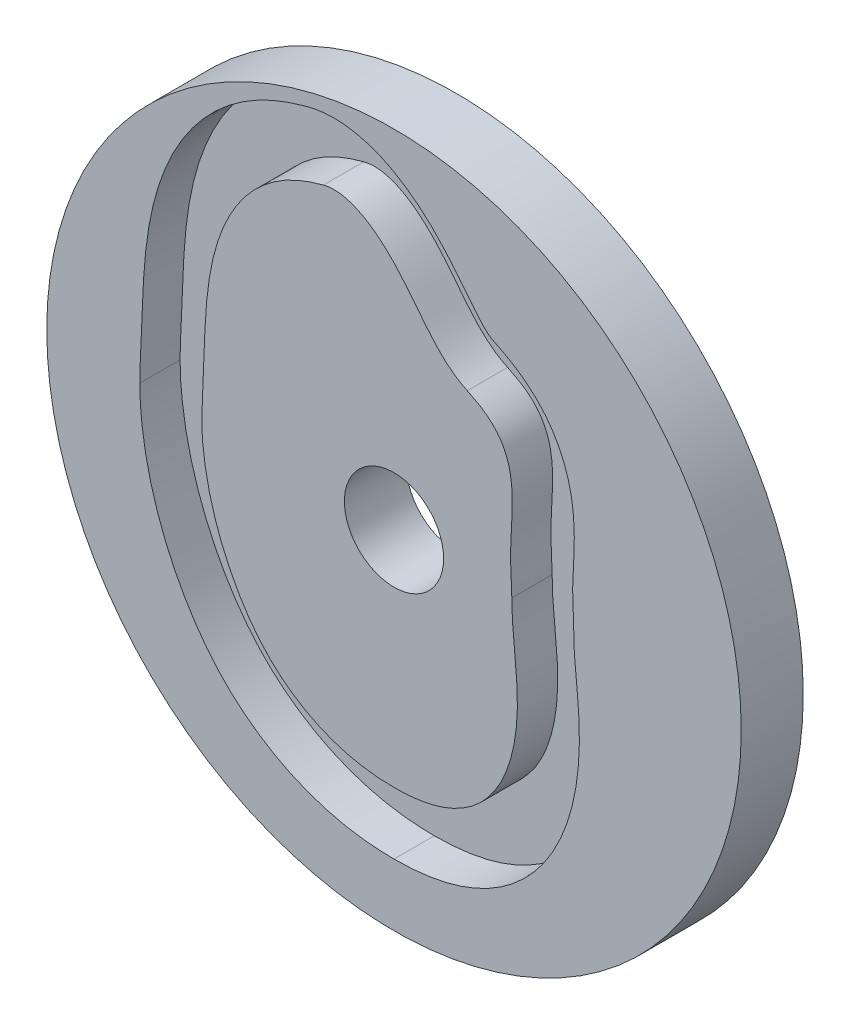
ISO-10303-21;
HEADER;
FILE_DESCRIPTION(('STEP AP214'),'2;1');
FILE_NAME('part.step','',(''),(''),'','','');
FILE_SCHEMA(('AUTOMOTIVE_DESIGN { 1 0 10303 214 1 1 1 1 }'));
ENDSEC;
DATA;
#1=APPLICATION_CONTEXT('core data for automotive mechanical design processes');
#2=APPLICATION_PROTOCOL_DEFINITION('international standard','automotive_design',2000,#1);
#3=PRODUCT_CONTEXT('',#1,'mechanical');
#4=PRODUCT('Part','Part','',(#3));
#5=PRODUCT_RELATED_PRODUCT_CATEGORY('part','',(#4));
#6=PRODUCT_DEFINITION_FORMATION('','',#4);
#7=PRODUCT_DEFINITION_CONTEXT('part definition',#1,'design');
#8=PRODUCT_DEFINITION('design','',#6,#7);
#9=PRODUCT_DEFINITION_SHAPE('','',#8);
#10=(LENGTH_UNIT() NAMED_UNIT(*) SI_UNIT(.MILLI.,.METRE.));
#11=(NAMED_UNIT(*) PLANE_ANGLE_UNIT() SI_UNIT($,.RADIAN.));
#12=(NAMED_UNIT(*) SI_UNIT($,.STERADIAN.) SOLID_ANGLE_UNIT());
#13=UNCERTAINTY_MEASURE_WITH_UNIT(LENGTH_MEASURE(1.E-05),#10,'distance_accuracy_value','');
#14=(GEOMETRIC_REPRESENTATION_CONTEXT(3) GLOBAL_UNCERTAINTY_ASSIGNED_CONTEXT((#13)) GLOBAL_UNIT_ASSIGNED_CONTEXT((#10,
#11,#12)) REPRESENTATION_CONTEXT('',''));
#15=CARTESIAN_POINT('',(0.,0.,0.));
#16=DIRECTION('',(0.,0.,1.));
#17=DIRECTION('',(1.,0.,0.));
#18=AXIS2_PLACEMENT_3D('',#15,#16,#17);
#19=CARTESIAN_POINT('',(0.,0.,0.));
#20=DIRECTION('',(0.,0.,1.));
#21=DIRECTION('',(1.,0.,0.));
#22=AXIS2_PLACEMENT_3D('',#19,#20,#21);
#23=PLANE('',#22);
#24=CARTESIAN_POINT('',(-6.74962243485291E-13,-145.95094,0.));
#25=CARTESIAN_POINT('',(0.937648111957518,-145.945754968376,0.));
#26=CARTESIAN_POINT('',(2.73394835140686,-145.935821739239,0.));
#27=CARTESIAN_POINT('',(5.39376273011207,-145.855197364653,0.));
#28=CARTESIAN_POINT('',(7.98428857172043,-145.728662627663,0.));
#29=CARTESIAN_POINT('',(10.5888897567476,-145.545794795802,0.));
#30=CARTESIAN_POINT('',(13.2057193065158,-145.304285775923,0.));
#31=CARTESIAN_POINT('',(15.8326368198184,-145.000421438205,0.));
#32=CARTESIAN_POINT('',(18.4672156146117,-144.631003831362,0.));
#33=CARTESIAN_POINT('',(21.1067512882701,-144.192873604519,0.));
#34=CARTESIAN_POINT('',(23.7482731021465,-143.683081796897,0.));
#35=CARTESIAN_POINT('',(26.3885581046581,-143.098885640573,0.));
#36=CARTESIAN_POINT('',(29.0241482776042,-142.437791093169,0.));
#37=CARTESIAN_POINT('',(31.651370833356,-141.697581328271,0.));
#38=CARTESIAN_POINT('',(34.2663617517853,-140.876346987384,0.));
#39=CARTESIAN_POINT('',(36.8650925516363,-139.972513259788,0.));
#40=CARTESIAN_POINT('',(39.4434001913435,-138.984864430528,0.));
#41=CARTESIAN_POINT('',(41.9970198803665,-137.912565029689,0.));
#42=CARTESIAN_POINT('',(44.5216204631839,-136.755177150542,0.));
#43=CARTESIAN_POINT('',(47.0128419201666,-135.512673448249,0.));
#44=CARTESIAN_POINT('',(49.4663344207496,-134.185445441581,0.));
#45=CARTESIAN_POINT('',(51.8777982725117,-132.774306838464,0.));
#46=CARTESIAN_POINT('',(54.2430240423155,-131.280491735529,0.));
#47=CARTESIAN_POINT('',(56.5579320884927,-129.705647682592,0.));
#48=CARTESIAN_POINT('',(58.8186107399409,-128.051823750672,0.));
#49=CARTESIAN_POINT('',(61.0213523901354,-126.321453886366,0.));
#50=CARTESIAN_POINT('',(63.1626868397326,-124.517335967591,0.));
#51=CARTESIAN_POINT('',(65.2394113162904,-122.642607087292,0.));
#52=CARTESIAN_POINT('',(67.2486167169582,-120.70071567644,0.));
#53=CARTESIAN_POINT('',(69.187709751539,-118.695391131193,0.));
#54=CARTESIAN_POINT('',(71.0544308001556,-116.630611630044,0.));
#55=CARTESIAN_POINT('',(72.846867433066,-114.510570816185,0.));
#56=CARTESIAN_POINT('',(74.5634636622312,-112.339643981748,0.));
#57=CARTESIAN_POINT('',(76.2030250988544,-110.122354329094,0.));
#58=CARTESIAN_POINT('',(77.7647202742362,-107.863339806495,0.));
#59=CARTESIAN_POINT('',(79.2480784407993,-105.567320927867,0.));
#60=CARTESIAN_POINT('',(80.6529842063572,-103.239069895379,0.));
#61=CARTESIAN_POINT('',(81.9796693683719,-100.883381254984,0.));
#62=CARTESIAN_POINT('',(83.22870231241,-98.5050442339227,0.));
#63=CARTESIAN_POINT('',(84.4009753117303,-96.1088168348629,0.));
#64=CARTESIAN_POINT('',(85.4976900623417,-93.6994017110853,0.));
#65=CARTESIAN_POINT('',(86.520341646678,-91.2814237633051,0.));
#66=CARTESIAN_POINT('',(87.4707014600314,-88.8594094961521,0.));
#67=CARTESIAN_POINT('',(88.3507981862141,-86.4377676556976,0.));
#68=CARTESIAN_POINT('',(89.1629010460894,-84.0207724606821,0.));
#69=CARTESIAN_POINT('',(89.9094982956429,-81.6125188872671,0.));
#70=CARTESIAN_POINT('',(90.5937582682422,-79.2153382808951,0.));
#71=CARTESIAN_POINT('',(91.2191142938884,-76.8299758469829,0.));
#72=CARTESIAN_POINT('',(91.7878920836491,-74.4564499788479,0.));
#73=CARTESIAN_POINT('',(92.3020861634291,-72.0960216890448,0.));
#74=CARTESIAN_POINT('',(92.7634848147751,-69.7509202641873,0.));
#75=CARTESIAN_POINT('',(93.173962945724,-67.4232857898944,0.));
#76=CARTESIAN_POINT('',(93.5354712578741,-65.1151644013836,0.));
#77=CARTESIAN_POINT('',(93.8500318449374,-62.828506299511,0.));
#78=CARTESIAN_POINT('',(94.1197318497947,-60.5651633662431,0.));
#79=CARTESIAN_POINT('',(94.3467173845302,-58.3268872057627,0.));
#80=CARTESIAN_POINT('',(94.533187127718,-56.115327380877,0.));
#81=CARTESIAN_POINT('',(94.6813857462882,-53.9320298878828,0.));
#82=CARTESIAN_POINT('',(94.7935970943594,-51.7784358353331,0.));
#83=CARTESIAN_POINT('',(94.8721371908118,-49.655880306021,0.));
#84=CARTESIAN_POINT('',(94.9193469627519,-47.5655913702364,0.));
#85=CARTESIAN_POINT('',(94.9375847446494,-45.5086892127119,0.));
#86=CARTESIAN_POINT('',(94.9292185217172,-43.4861853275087,0.));
#87=CARTESIAN_POINT('',(94.8966179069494,-41.4989817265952,0.));
#88=CARTESIAN_POINT('',(94.8421458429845,-39.5478700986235,0.));
#89=CARTESIAN_POINT('',(94.7681500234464,-37.6335308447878,0.));
#90=CARTESIAN_POINT('',(94.6769540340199,-35.7565319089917,0.));
#91=CARTESIAN_POINT('',(94.5708482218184,-33.9173273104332,0.));
#92=CARTESIAN_POINT('',(94.4520803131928,-32.116255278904,0.));
#93=CARTESIAN_POINT('',(94.3228458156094,-30.353535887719,0.));
#94=CARTESIAN_POINT('',(94.1852782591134,-28.6292680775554,0.));
#95=CARTESIAN_POINT('',(94.0414393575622,-26.9434259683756,0.));
#96=CARTESIAN_POINT('',(93.8933091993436,-25.29585436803,0.));
#97=CARTESIAN_POINT('',(93.7427766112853,-23.6862634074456,0.));
#98=CARTESIAN_POINT('',(93.5916298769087,-22.114222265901,0.));
#99=CARTESIAN_POINT('',(93.4415480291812,-20.5791519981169,0.));
#100=CARTESIAN_POINT('',(93.2940929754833,-19.0803175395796,0.));
#101=CARTESIAN_POINT('',(93.1507027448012,-17.6168190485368,0.));
#102=CARTESIAN_POINT('',(93.0126861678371,-16.1875828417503,0.));
#103=CARTESIAN_POINT('',(92.8812193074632,-14.7913522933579,0.));
#104=CARTESIAN_POINT('',(92.757343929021,-13.4266791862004,0.));
#105=CARTESIAN_POINT('',(92.6419682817,-12.0919161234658,0.));
#106=CARTESIAN_POINT('',(92.5358702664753,-10.7852107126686,0.));
#107=CARTESIAN_POINT('',(92.4397033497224,-9.50450230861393,0.));
#108=CARTESIAN_POINT('',(92.3540039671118,-8.24752212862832,0.));
#109=CARTESIAN_POINT('',(92.2792042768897,-7.01179752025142,0.));
#110=CARTESIAN_POINT('',(92.2156347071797,-5.79466103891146,0.));
#111=CARTESIAN_POINT('',(92.1635705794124,-4.59326483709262,0.));
#112=CARTESIAN_POINT('',(92.1231211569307,-3.40460045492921,0.));
#113=CARTESIAN_POINT('',(92.0946970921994,-2.22552427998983,0.));
#114=CARTESIAN_POINT('',(92.0779176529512,-1.09172061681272,0.));
#115=CARTESIAN_POINT('',(92.0759369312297,-0.350578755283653,0.));
#116=CARTESIAN_POINT('',(92.075,-1.98524779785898E-12,0.));
#117=B_SPLINE_CURVE_WITH_KNOTS('',3,(#24,#25,#26,#27,#28,#29,#30,#31,#32,#33,#34,#35,#36,#37,
#38,#39,#40,#41,#42,#43,#44,#45,#46,#47,#48,#49,#50,#51,#52,#53,#54,#55,#56,#57,#58,#59,#60,#61,
#62,#63,#64,#65,#66,#67,#68,#69,#70,#71,#72,#73,#74,#75,#76,#77,#78,#79,#80,#81,#82,#83,#84,#85,
#86,#87,#88,#89,#90,#91,#92,#93,#94,#95,#96,#97,#98,#99,#100,#101,#102,#103,#104,#105,#106,#107,
#108,#109,#110,#111,#112,#113,#114,#115,#116),.UNSPECIFIED.,.F.,.F.,(4,1,1,1,1,1,1,1,1,1,1,1,1,
1,1,1,1,1,1,1,1,1,1,1,1,1,1,1,1,1,1,1,1,1,1,1,1,1,1,1,1,1,1,1,1,1,1,1,1,1,1,1,1,1,1,1,1,1,1,1,1,
1,1,1,1,1,1,1,1,1,1,1,1,1,1,1,1,1,1,1,1,1,1,1,1,1,1,1,1,1,4),(0.,0.0139500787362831,
0.0267248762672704,0.0395872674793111,0.052535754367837,0.0655683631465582,0.0786826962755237,
0.0918759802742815,0.105145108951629,0.118486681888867,0.131897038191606,0.145372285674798,
0.15890832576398,0.172500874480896,0.18614547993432,0.199837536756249,0.213572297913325,
0.227344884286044,0.241150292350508,0.254983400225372,0.268838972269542,0.282711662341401,
0.296596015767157,0.310486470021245,0.324377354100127,0.338262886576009,0.352137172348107,
0.365994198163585,0.379827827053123,0.393631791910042,0.407399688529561,0.421124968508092,
0.43480093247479,0.44842072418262,0.46197732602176,0.475463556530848,0.488872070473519,
0.502195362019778,0.515425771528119,0.528555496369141,0.541576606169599,0.554481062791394,
0.567260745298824,0.579907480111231,0.592413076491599,0.604769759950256,0.616994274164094,
0.629099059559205,0.641080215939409,0.652933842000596,0.664656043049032,0.676242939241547,
0.687690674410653,0.698995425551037,0.710153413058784,0.721160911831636,0.732014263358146,
0.742709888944,0.753244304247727,0.763614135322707,0.773816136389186,0.78384720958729,
0.793704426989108,0.803385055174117,0.812886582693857,0.82220675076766,0.831343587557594,
0.840295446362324,0.849061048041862,0.857639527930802,0.866030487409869,0.874234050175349,
0.882250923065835,0.890082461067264,0.897730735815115,0.905198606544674,0.912489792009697,
0.919608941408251,0.926561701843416,0.933354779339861,0.939995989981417,0.946494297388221,
0.952859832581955,0.959103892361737,0.965238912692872,0.971278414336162,0.977236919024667,
0.983129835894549,0.988973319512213,0.994784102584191,1.),.UNSPECIFIED.);
#118=CARTESIAN_POINT('',(-6.74962243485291E-13,-145.95094,0.));
#119=VERTEX_POINT('',#118);
#120=CARTESIAN_POINT('',(92.075,-1.98524779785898E-12,0.));
#121=VERTEX_POINT('',#120);
#122=EDGE_CURVE('E121',#119,#121,#117,.T.);
#123=ORIENTED_EDGE('',*,*,#122,.F.);
#124=CARTESIAN_POINT('',(-130.175,4.20606503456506E-13,0.));
#125=CARTESIAN_POINT('',(-130.170444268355,-0.830893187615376,0.));
#126=CARTESIAN_POINT('',(-130.161766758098,-2.41353341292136,0.));
#127=CARTESIAN_POINT('',(-130.096131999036,-4.74378124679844,0.));
#128=CARTESIAN_POINT('',(-129.999762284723,-6.98713868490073,0.));
#129=CARTESIAN_POINT('',(-129.868513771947,-9.21935854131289,0.));
#130=CARTESIAN_POINT('',(-129.70493216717,-11.4408289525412,0.));
#131=CARTESIAN_POINT('',(-129.510132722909,-13.6521894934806,0.));
#132=CARTESIAN_POINT('',(-129.285357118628,-15.8543010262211,0.));
#133=CARTESIAN_POINT('',(-129.031523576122,-18.0482072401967,0.));
#134=CARTESIAN_POINT('',(-128.749335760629,-20.2350953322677,0.));
#135=CARTESIAN_POINT('',(-128.439187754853,-22.4162416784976,0.));
#136=CARTESIAN_POINT('',(-128.101371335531,-24.5929483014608,0.));
#137=CARTESIAN_POINT('',(-127.735392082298,-26.7660546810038,0.));
#138=CARTESIAN_POINT('',(-127.341824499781,-28.9361022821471,0.));
#139=CARTESIAN_POINT('',(-126.920150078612,-31.1030006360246,0.));
#140=CARTESIAN_POINT('',(-126.470427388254,-33.2666349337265,0.));
#141=CARTESIAN_POINT('',(-125.992557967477,-35.4268545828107,0.));
#142=CARTESIAN_POINT('',(-125.486477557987,-37.5835113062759,0.));
#143=CARTESIAN_POINT('',(-124.952104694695,-39.7364501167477,0.));
#144=CARTESIAN_POINT('',(-124.389354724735,-41.8855113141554,0.));
#145=CARTESIAN_POINT('',(-123.798136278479,-44.0305295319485,0.));
#146=CARTESIAN_POINT('',(-123.178352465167,-46.1713335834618,0.));
#147=CARTESIAN_POINT('',(-122.529900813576,-48.3077461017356,0.));
#148=CARTESIAN_POINT('',(-121.852673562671,-50.4395832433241,0.));
#149=CARTESIAN_POINT('',(-121.146557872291,-52.566654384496,0.));
#150=CARTESIAN_POINT('',(-120.411436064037,-54.6887618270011,0.));
#151=CARTESIAN_POINT('',(-119.647185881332,-56.8057005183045,0.));
#152=CARTESIAN_POINT('',(-118.853680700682,-58.9172577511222,0.));
#153=CARTESIAN_POINT('',(-118.03078997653,-61.023212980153,0.));
#154=CARTESIAN_POINT('',(-117.178378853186,-63.1233372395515,0.));
#155=CARTESIAN_POINT('',(-116.296310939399,-65.2173940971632,0.));
#156=CARTESIAN_POINT('',(-115.384439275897,-67.3051348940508,0.));
#157=CARTESIAN_POINT('',(-114.442641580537,-69.3863154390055,0.));
#158=CARTESIAN_POINT('',(-113.470685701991,-71.4606406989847,0.));
#159=CARTESIAN_POINT('',(-112.468649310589,-73.528148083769,0.));
#160=CARTESIAN_POINT('',(-111.435617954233,-75.5888594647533,0.));
#161=CARTESIAN_POINT('',(-110.371111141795,-77.6434445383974,0.));
#162=CARTESIAN_POINT('',(-109.273950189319,-79.6924319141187,0.));
#163=CARTESIAN_POINT('',(-108.142907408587,-81.7361716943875,0.));
#164=CARTESIAN_POINT('',(-106.97661416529,-83.7747257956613,0.));
#165=CARTESIAN_POINT('',(-105.773633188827,-85.8078661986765,0.));
#166=CARTESIAN_POINT('',(-104.532486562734,-87.8350579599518,0.));
#167=CARTESIAN_POINT('',(-103.2516974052,-89.8554557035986,0.));
#168=CARTESIAN_POINT('',(-101.92982880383,-91.867906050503,0.));
#169=CARTESIAN_POINT('',(-100.565523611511,-93.8709580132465,0.));
#170=CARTESIAN_POINT('',(-99.1575432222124,-95.8628805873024,0.));
#171=CARTESIAN_POINT('',(-97.7048048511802,-97.8416873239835,0.));
#172=CARTESIAN_POINT('',(-96.206416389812,-99.8051673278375,0.));
#173=CARTESIAN_POINT('',(-94.6617079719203,-101.750922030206,0.));
#174=CARTESIAN_POINT('',(-93.0702593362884,-103.676406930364,0.));
#175=CARTESIAN_POINT('',(-91.4319221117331,-105.578977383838,0.));
#176=CARTESIAN_POINT('',(-89.7468361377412,-107.455937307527,0.));
#177=CARTESIAN_POINT('',(-88.0154392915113,-109.304589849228,0.));
#178=CARTESIAN_POINT('',(-86.2384694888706,-111.122287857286,0.));
#179=CARTESIAN_POINT('',(-84.416961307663,-112.906486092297,0.));
#180=CARTESIAN_POINT('',(-82.5522264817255,-114.654781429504,0.));
#181=CARTESIAN_POINT('',(-80.6458221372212,-116.365018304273,0.));
#182=CARTESIAN_POINT('',(-78.6992208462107,-118.03539218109,0.));
#183=CARTESIAN_POINT('',(-76.7138688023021,-119.664738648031,0.));
#184=CARTESIAN_POINT('',(-74.6907796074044,-121.251995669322,0.));
#185=CARTESIAN_POINT('',(-72.6309811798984,-122.796293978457,0.));
#186=CARTESIAN_POINT('',(-70.5354999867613,-124.296763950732,0.));
#187=CARTESIAN_POINT('',(-68.4053881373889,-125.752567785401,0.));
#188=CARTESIAN_POINT('',(-66.2417154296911,-127.162891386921,0.));
#189=CARTESIAN_POINT('',(-64.0455707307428,-128.526947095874,0.));
#190=CARTESIAN_POINT('',(-61.8180608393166,-129.843973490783,0.));
#191=CARTESIAN_POINT('',(-59.5603100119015,-131.113235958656,0.));
#192=CARTESIAN_POINT('',(-57.273459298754,-132.334027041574,0.));
#193=CARTESIAN_POINT('',(-54.9586659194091,-133.505666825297,0.));
#194=CARTESIAN_POINT('',(-52.6171026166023,-134.627503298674,0.));
#195=CARTESIAN_POINT('',(-50.2499570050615,-135.698912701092,0.));
#196=CARTESIAN_POINT('',(-47.8584309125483,-136.719299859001,0.));
#197=CARTESIAN_POINT('',(-45.4437397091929,-137.688098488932,0.));
#198=CARTESIAN_POINT('',(-43.0071116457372,-138.604771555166,0.));
#199=CARTESIAN_POINT('',(-40.5497871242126,-139.468811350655,0.));
#200=CARTESIAN_POINT('',(-38.0730181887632,-140.279740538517,0.));
#201=CARTESIAN_POINT('',(-35.5780671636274,-141.037109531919,0.));
#202=CARTESIAN_POINT('',(-33.066208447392,-141.740507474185,0.));
#203=CARTESIAN_POINT('',(-30.5387203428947,-142.38952187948,0.));
#204=CARTESIAN_POINT('',(-27.9970864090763,-142.983849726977,0.));
#205=CARTESIAN_POINT('',(-25.4431399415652,-143.522912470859,0.));
#206=CARTESIAN_POINT('',(-22.8792215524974,-144.006532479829,0.));
#207=CARTESIAN_POINT('',(-20.3078997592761,-144.434684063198,0.));
#208=CARTESIAN_POINT('',(-17.7317304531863,-144.807689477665,0.));
#209=CARTESIAN_POINT('',(-15.1531777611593,-145.126161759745,0.));
#210=CARTESIAN_POINT('',(-12.574573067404,-145.391025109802,0.));
#211=CARTESIAN_POINT('',(-9.99807484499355,-145.603360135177,0.));
#212=CARTESIAN_POINT('',(-7.42563343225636,-145.764822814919,0.));
#213=CARTESIAN_POINT('',(-4.85896339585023,-145.875916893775,0.));
#214=CARTESIAN_POINT('',(-2.38435862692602,-145.940016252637,0.));
#215=CARTESIAN_POINT('',(-0.765475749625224,-145.947433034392,0.));
#216=CARTESIAN_POINT('',(-2.8786803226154E-12,-145.95094,0.));
#217=B_SPLINE_CURVE_WITH_KNOTS('',3,(#124,#125,#126,#127,#128,#129,#130,#131,#132,#133,#134,
#135,#136,#137,#138,#139,#140,#141,#142,#143,#144,#145,#146,#147,#148,#149,#150,#151,#152,#153,
#154,#155,#156,#157,#158,#159,#160,#161,#162,#163,#164,#165,#166,#167,#168,#169,#170,#171,#172,
#173,#174,#175,#176,#177,#178,#179,#180,#181,#182,#183,#184,#185,#186,#187,#188,#189,#190,#191,
#192,#193,#194,#195,#196,#197,#198,#199,#200,#201,#202,#203,#204,#205,#206,#207,#208,#209,#210,
#211,#212,#213,#214,#215,#216),.UNSPECIFIED.,.F.,.F.,(4,1,1,1,1,1,1,1,1,1,1,1,1,1,1,1,1,1,1,1,1,
1,1,1,1,1,1,1,1,1,1,1,1,1,1,1,1,1,1,1,1,1,1,1,1,1,1,1,1,1,1,1,1,1,1,1,1,1,1,1,1,1,1,1,1,1,1,1,1,
1,1,1,1,1,1,1,1,1,1,1,1,1,1,1,1,1,1,1,1,1,4),(0.,0.01144491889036,0.0217996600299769,
0.0321082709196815,0.0423734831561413,0.0525990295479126,0.0627895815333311,0.0729506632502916,
0.0830885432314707,0.0932101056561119,0.103322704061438,0.11343400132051,0.123551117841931,
0.133676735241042,0.143812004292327,0.153957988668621,0.164115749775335,0.174286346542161,
0.18447083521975,0.194670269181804,0.204885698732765,0.215118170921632,0.225368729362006,
0.235638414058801,0.245928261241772,0.256239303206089,0.266572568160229,0.2769290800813,
0.287309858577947,0.297715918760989,0.308148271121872,0.318607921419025,0.329095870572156,
0.339613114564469,0.35016077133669,0.360742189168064,0.371364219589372,0.382033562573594,
0.392756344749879,0.403537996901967,0.414383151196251,0.425295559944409,0.436278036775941,
0.447332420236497,0.458459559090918,0.469659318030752,0.480930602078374,0.492271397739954,
0.503678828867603,0.515149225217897,0.526678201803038,0.538260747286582,0.549891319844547,
0.561563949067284,0.573272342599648,0.58500999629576,0.596770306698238,0.608547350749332,
0.620339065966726,0.632144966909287,0.643964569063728,0.655797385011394,0.667642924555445,
0.679500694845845,0.691370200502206,0.703250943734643,0.715142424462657,0.727044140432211,
0.738955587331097,0.75087625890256,0.762805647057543,0.774743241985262,0.786688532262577,
0.798641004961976,0.81060014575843,0.822565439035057,0.834536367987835,0.846512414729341,
0.858493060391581,0.870477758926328,0.882463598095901,0.894444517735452,0.906414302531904,
0.918367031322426,0.930297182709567,0.942199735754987,0.954070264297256,0.965905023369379,
0.977701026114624,0.989456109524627,1.),.UNSPECIFIED.);
#218=CARTESIAN_POINT('',(-130.175,4.20606503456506E-13,0.));
#219=VERTEX_POINT('',#218);
#220=EDGE_CURVE('E467',#219,#119,#217,.T.);
#221=ORIENTED_EDGE('',*,*,#220,.F.);
#222=CARTESIAN_POINT('',(-44.348886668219,165.512298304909,0.));
#223=CARTESIAN_POINT('',(-45.4141827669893,165.220512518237,0.));
#224=CARTESIAN_POINT('',(-47.4610787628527,164.659865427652,0.));
#225=CARTESIAN_POINT('',(-50.4786728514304,163.747185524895,0.));
#226=CARTESIAN_POINT('',(-53.4160795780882,162.790078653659,0.));
#227=CARTESIAN_POINT('',(-56.3603550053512,161.747857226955,0.));
#228=CARTESIAN_POINT('',(-59.3036196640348,160.616224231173,0.));
#229=CARTESIAN_POINT('',(-62.2366143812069,159.39059679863,0.));
#230=CARTESIAN_POINT('',(-65.1496235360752,158.068591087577,0.));
#231=CARTESIAN_POINT('',(-68.0326049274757,156.649496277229,0.));
#232=CARTESIAN_POINT('',(-70.8759609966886,155.134883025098,0.));
#233=CARTESIAN_POINT('',(-73.6710007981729,153.526431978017,0.));
#234=CARTESIAN_POINT('',(-76.4128014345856,151.828851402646,0.));
#235=CARTESIAN_POINT('',(-79.0967456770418,150.043784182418,0.));
#236=CARTESIAN_POINT('',(-81.7197069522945,148.174060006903,0.));
#237=CARTESIAN_POINT('',(-84.278551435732,146.22242297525,0.));
#238=CARTESIAN_POINT('',(-86.7704095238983,144.191939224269,0.));
#239=CARTESIAN_POINT('',(-89.1926246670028,142.085864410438,0.));
#240=CARTESIAN_POINT('',(-91.5427839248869,139.90765573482,0.));
#241=CARTESIAN_POINT('',(-93.8187242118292,137.66094412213,0.));
#242=CARTESIAN_POINT('',(-96.0185425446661,135.349516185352,0.));
#243=CARTESIAN_POINT('',(-98.1406027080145,132.977292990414,0.));
#244=CARTESIAN_POINT('',(-100.183540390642,130.548309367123,0.));
#245=CARTESIAN_POINT('',(-102.146266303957,128.066693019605,0.));
#246=CARTESIAN_POINT('',(-104.027967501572,125.536643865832,0.));
#247=CARTESIAN_POINT('',(-105.828106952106,122.962413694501,0.));
#248=CARTESIAN_POINT('',(-107.546421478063,120.348286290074,0.));
#249=CARTESIAN_POINT('',(-109.182918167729,117.698558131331,0.));
#250=CARTESIAN_POINT('',(-110.737869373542,115.01751975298,0.));
#251=CARTESIAN_POINT('',(-112.211806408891,112.309437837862,0.));
#252=CARTESIAN_POINT('',(-113.605512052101,109.578538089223,0.));
#253=CARTESIAN_POINT('',(-114.920011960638,106.828988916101,0.));
#254=CARTESIAN_POINT('',(-116.156565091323,104.064885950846,0.));
#255=CARTESIAN_POINT('',(-117.316653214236,101.29023740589,0.));
#256=CARTESIAN_POINT('',(-118.401969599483,98.5089502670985,0.));
#257=CARTESIAN_POINT('',(-119.41440694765,95.7248173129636,0.));
#258=CARTESIAN_POINT('',(-120.356044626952,92.9415049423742,0.));
#259=CARTESIAN_POINT('',(-121.229135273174,90.1625417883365,0.));
#260=CARTESIAN_POINT('',(-122.036090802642,87.3913080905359,0.));
#261=CARTESIAN_POINT('',(-122.779467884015,84.6310257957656,0.));
#262=CARTESIAN_POINT('',(-123.461952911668,81.8847493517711,0.));
#263=CARTESIAN_POINT('',(-124.086346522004,79.1553571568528,0.));
#264=CARTESIAN_POINT('',(-124.655547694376,76.4455436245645,0.));
#265=CARTESIAN_POINT('',(-125.172537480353,73.7578118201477,0.));
#266=CARTESIAN_POINT('',(-125.640362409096,71.0944666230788,0.));
#267=CARTESIAN_POINT('',(-126.062117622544,68.4576083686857,0.));
#268=CARTESIAN_POINT('',(-126.440929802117,65.8491269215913,0.));
#269=CARTESIAN_POINT('',(-126.779939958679,63.2706961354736,0.));
#270=CARTESIAN_POINT('',(-127.082286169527,60.7237686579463,0.));
#271=CARTESIAN_POINT('',(-127.351086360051,58.2095710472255,0.));
#272=CARTESIAN_POINT('',(-127.589421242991,55.7290991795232,0.));
#273=CARTESIAN_POINT('',(-127.800317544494,53.2831139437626,0.));
#274=CARTESIAN_POINT('',(-127.986731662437,50.8721372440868,0.));
#275=CARTESIAN_POINT('',(-128.151533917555,48.4964483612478,0.));
#276=CARTESIAN_POINT('',(-128.297493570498,46.1560807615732,0.));
#277=CARTESIAN_POINT('',(-128.427264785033,43.8508194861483,0.));
#278=CARTESIAN_POINT('',(-128.543373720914,41.5801993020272,0.));
#279=CARTESIAN_POINT('',(-128.648206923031,39.3435038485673,0.));
#280=CARTESIAN_POINT('',(-128.744001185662,37.1397660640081,0.));
#281=CARTESIAN_POINT('',(-128.832834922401,34.9677702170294,0.));
#282=CARTESIAN_POINT('',(-128.916621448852,32.8260559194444,0.));
#283=CARTESIAN_POINT('',(-128.997102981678,30.7129244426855,0.));
#284=CARTESIAN_POINT('',(-129.075849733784,28.6264478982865,0.));
#285=CARTESIAN_POINT('',(-129.154247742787,26.5644808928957,0.));
#286=CARTESIAN_POINT('',(-129.233534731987,24.5246775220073,0.));
#287=CARTESIAN_POINT('',(-129.314665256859,22.5045042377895,0.));
#288=CARTESIAN_POINT('',(-129.39881077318,20.5012242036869,0.));
#289=CARTESIAN_POINT('',(-129.485580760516,18.5106649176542,0.));
#290=CARTESIAN_POINT('',(-129.577432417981,16.5260690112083,0.));
#291=CARTESIAN_POINT('',(-129.672950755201,14.5379490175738,0.));
#292=CARTESIAN_POINT('',(-129.771049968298,12.5357178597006,0.));
#293=CARTESIAN_POINT('',(-129.869093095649,10.5093712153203,0.));
#294=CARTESIAN_POINT('',(-129.963235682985,8.44994113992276,0.));
#295=CARTESIAN_POINT('',(-130.048610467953,6.3498213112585,0.));
#296=CARTESIAN_POINT('',(-130.118055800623,4.20302939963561,0.));
#297=CARTESIAN_POINT('',(-130.165576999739,2.08116302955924,0.));
#298=CARTESIAN_POINT('',(-130.171946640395,0.674364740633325,0.));
#299=CARTESIAN_POINT('',(-130.175,4.20606503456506E-13,0.));
#300=B_SPLINE_CURVE_WITH_KNOTS('',3,(#222,#223,#224,#225,#226,#227,#228,#229,#230,#231,#232,
#233,#234,#235,#236,#237,#238,#239,#240,#241,#242,#243,#244,#245,#246,#247,#248,#249,#250,#251,
#252,#253,#254,#255,#256,#257,#258,#259,#260,#261,#262,#263,#264,#265,#266,#267,#268,#269,#270,
#271,#272,#273,#274,#275,#276,#277,#278,#279,#280,#281,#282,#283,#284,#285,#286,#287,#288,#289,
#290,#291,#292,#293,#294,#295,#296,#297,#298,#299),.UNSPECIFIED.,.F.,.F.,(4,1,1,1,1,1,1,1,1,1,1,
1,1,1,1,1,1,1,1,1,1,1,1,1,1,1,1,1,1,1,1,1,1,1,1,1,1,1,1,1,1,1,1,1,1,1,1,1,1,1,1,1,1,1,1,1,1,1,1,
1,1,1,1,1,1,1,1,1,1,1,1,1,1,1,1,4),(0.,0.0162638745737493,0.0312499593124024,0.04641752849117,
0.0617523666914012,0.0772357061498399,0.0928448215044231,0.108553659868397,0.124333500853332,
0.140153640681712,0.155984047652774,0.171811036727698,0.187631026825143,0.203440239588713,
0.219234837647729,0.235010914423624,0.250764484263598,0.26649147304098,0.282187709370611,
0.297848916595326,0.31347070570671,0.329048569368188,0.344577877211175,0.360053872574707,
0.375471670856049,0.390826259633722,0.40611250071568,0.42132513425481,0.436458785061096,
0.451507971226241,0.466467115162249,0.481330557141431,0.496092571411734,0.510747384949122,
0.525289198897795,0.539712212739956,0.554010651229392,0.568178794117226,0.582211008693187,
0.596101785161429,0.60984577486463,0.623437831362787,0.636873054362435,0.650146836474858,
0.663254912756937,0.676193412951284,0.688958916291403,0.701548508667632,0.713959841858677,
0.726191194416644,0.738241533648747,0.750110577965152,0.761798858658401,0.773307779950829,
0.784639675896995,0.795797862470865,0.806786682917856,0.81761154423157,0.828278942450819,
0.838796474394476,0.849172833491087,0.859417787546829,0.869542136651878,0.879557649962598,
0.889476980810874,0.89931356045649,0.909082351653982,0.91881617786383,0.928568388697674,
0.938391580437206,0.948334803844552,0.958441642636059,0.968748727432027,0.979284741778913,
0.990069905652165,1.),.UNSPECIFIED.);
#301=CARTESIAN_POINT('',(-44.348886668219,165.512298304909,0.));
#302=VERTEX_POINT('',#301);
#303=EDGE_CURVE('E403',#302,#219,#300,.T.);
#304=ORIENTED_EDGE('',*,*,#303,.F.);
#305=CARTESIAN_POINT('',(50.9470287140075,109.256255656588,0.));
#306=CARTESIAN_POINT('',(50.6994657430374,109.378459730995,0.));
#307=CARTESIAN_POINT('',(50.2103099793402,109.619920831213,0.));
#308=CARTESIAN_POINT('',(49.4872219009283,110.063669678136,0.));
#309=CARTESIAN_POINT('',(48.7337353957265,110.589503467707,0.));
#310=CARTESIAN_POINT('',(47.9101846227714,111.241528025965,0.));
#311=CARTESIAN_POINT('',(47.0033424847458,112.039666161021,0.));
#312=CARTESIAN_POINT('',(46.0078921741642,112.999991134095,0.));
#313=CARTESIAN_POINT('',(44.922529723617,114.130930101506,0.));
#314=CARTESIAN_POINT('',(43.7482374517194,115.434720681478,0.));
#315=CARTESIAN_POINT('',(42.486511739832,116.908123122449,0.));
#316=CARTESIAN_POINT('',(41.1384345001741,118.543739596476,0.));
#317=CARTESIAN_POINT('',(39.7041922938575,120.331090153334,0.));
#318=CARTESIAN_POINT('',(38.1829655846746,122.25752012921,0.));
#319=CARTESIAN_POINT('',(36.5730150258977,124.308865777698,0.));
#320=CARTESIAN_POINT('',(34.8718688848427,126.469928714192,0.));
#321=CARTESIAN_POINT('',(33.0765431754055,128.72479974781,0.));
#322=CARTESIAN_POINT('',(31.1837583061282,131.057077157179,0.));
#323=CARTESIAN_POINT('',(29.1901338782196,133.4500134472,0.));
#324=CARTESIAN_POINT('',(27.0923548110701,135.886615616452,0.));
#325=CARTESIAN_POINT('',(24.8873081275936,138.349715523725,0.));
#326=CARTESIAN_POINT('',(22.5721930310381,140.822020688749,0.));
#327=CARTESIAN_POINT('',(20.1446085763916,143.286151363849,0.));
#328=CARTESIAN_POINT('',(17.6026241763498,145.724666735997,0.));
#329=CARTESIAN_POINT('',(14.9448388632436,148.120081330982,0.));
#330=CARTESIAN_POINT('',(12.1704359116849,150.45487188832,0.));
#331=CARTESIAN_POINT('',(9.27924020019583,152.711475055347,0.));
#332=CARTESIAN_POINT('',(6.27178650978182,154.872277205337,0.));
#333=CARTESIAN_POINT('',(3.14940763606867,156.919599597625,0.));
#334=CARTESIAN_POINT('',(-0.0856485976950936,158.835684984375,0.));
#335=CARTESIAN_POINT('',(-3.43006518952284,160.602695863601,0.));
#336=CARTESIAN_POINT('',(-6.87925882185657,162.202738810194,0.));
#337=CARTESIAN_POINT('',(-10.4271395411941,163.617936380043,0.));
#338=CARTESIAN_POINT('',(-14.0658333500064,164.83056450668,0.));
#339=CARTESIAN_POINT('',(-17.7853936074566,165.823303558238,0.));
#340=CARTESIAN_POINT('',(-21.5735123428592,166.579539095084,0.));
#341=CARTESIAN_POINT('',(-25.4153683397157,167.084043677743,0.));
#342=CARTESIAN_POINT('',(-29.2933448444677,167.322826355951,0.));
#343=CARTESIAN_POINT('',(-33.187906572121,167.286622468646,0.));
#344=CARTESIAN_POINT('',(-37.0750853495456,166.961064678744,0.));
#345=CARTESIAN_POINT('',(-40.8089789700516,166.386480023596,0.));
#346=CARTESIAN_POINT('',(-43.210798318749,165.793349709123,0.));
#347=CARTESIAN_POINT('',(-44.3488866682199,165.512298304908,0.));
#348=B_SPLINE_CURVE_WITH_KNOTS('',3,(#305,#306,#307,#308,#309,#310,#311,#312,#313,#314,#315,
#316,#317,#318,#319,#320,#321,#322,#323,#324,#325,#326,#327,#328,#329,#330,#331,#332,#333,#334,
#335,#336,#337,#338,#339,#340,#341,#342,#343,#344,#345,#346,#347),.UNSPECIFIED.,.F.,.F.,(4,1,1,
1,1,1,1,1,1,1,1,1,1,1,1,1,1,1,1,1,1,1,1,1,1,1,1,1,1,1,1,1,1,1,1,1,1,1,1,1,4),(0.,
0.00704176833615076,0.0139137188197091,0.0216237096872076,0.0304784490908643,0.0407023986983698,
0.0524393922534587,0.0657635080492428,0.0806938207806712,0.0972090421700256,0.115259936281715,
0.134778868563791,0.155686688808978,0.177897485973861,0.201321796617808,0.225868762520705,
0.251447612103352,0.277968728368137,0.305344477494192,0.333489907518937,0.362323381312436,
0.391767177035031,0.421748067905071,0.452197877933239,0.483053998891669,0.514259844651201,
0.545765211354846,0.577526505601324,0.609506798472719,0.641675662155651,0.674008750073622,
0.706487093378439,0.739096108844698,0.771824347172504,0.80466205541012,0.837599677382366,
0.870626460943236,0.903729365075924,0.936892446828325,0.970096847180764,1.),.UNSPECIFIED.);
#349=CARTESIAN_POINT('',(50.9470287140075,109.256255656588,0.));
#350=VERTEX_POINT('',#349);
#351=EDGE_CURVE('E148',#350,#302,#348,.T.);
#352=ORIENTED_EDGE('',*,*,#351,.F.);
#353=CARTESIAN_POINT('',(92.075,0.,0.));
#354=CARTESIAN_POINT('',(92.0718677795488,0.579366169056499,0.));
#355=CARTESIAN_POINT('',(92.0659796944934,1.66848404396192,0.));
#356=CARTESIAN_POINT('',(92.025969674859,3.25106558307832,0.));
#357=CARTESIAN_POINT('',(91.9740070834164,4.7324099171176,0.));
#358=CARTESIAN_POINT('',(91.9115707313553,6.16764438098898,0.));
#359=CARTESIAN_POINT('',(91.8439012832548,7.55929079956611,0.));
#360=CARTESIAN_POINT('',(91.774827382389,8.91070475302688,0.));
#361=CARTESIAN_POINT('',(91.7077502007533,10.2260743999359,0.));
#362=CARTESIAN_POINT('',(91.6454276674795,11.5104004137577,0.));
#363=CARTESIAN_POINT('',(91.5900913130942,12.7694513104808,0.));
#364=CARTESIAN_POINT('',(91.5434968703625,14.0096861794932,0.));
#365=CARTESIAN_POINT('',(91.5070016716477,15.2381409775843,0.));
#366=CARTESIAN_POINT('',(91.481633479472,16.4622788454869,0.));
#367=CARTESIAN_POINT('',(91.4681480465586,17.68981019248,0.));
#368=CARTESIAN_POINT('',(91.4670658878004,18.9284931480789,0.));
#369=CARTESIAN_POINT('',(91.4786841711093,20.185928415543,0.));
#370=CARTESIAN_POINT('',(91.5030631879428,21.4693637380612,0.));
#371=CARTESIAN_POINT('',(91.5399911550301,22.7855218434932,0.));
#372=CARTESIAN_POINT('',(91.5889342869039,24.1404622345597,0.));
#373=CARTESIAN_POINT('',(91.6489807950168,25.5394824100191,0.));
#374=CARTESIAN_POINT('',(91.7187874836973,26.9870591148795,0.));
#375=CARTESIAN_POINT('',(91.7965362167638,28.4868259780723,0.));
#376=CARTESIAN_POINT('',(91.879905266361,30.0415810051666,0.));
#377=CARTESIAN_POINT('',(91.9660580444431,31.6533160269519,0.));
#378=CARTESIAN_POINT('',(92.0516494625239,33.3232601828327,0.));
#379=CARTESIAN_POINT('',(92.1328484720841,35.0519304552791,0.));
#380=CARTESIAN_POINT('',(92.205374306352,36.8391837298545,0.));
#381=CARTESIAN_POINT('',(92.264543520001,38.6842664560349,0.));
#382=CARTESIAN_POINT('',(92.3053249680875,40.5858594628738,0.));
#383=CARTESIAN_POINT('',(92.3224002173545,42.5421166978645,0.));
#384=CARTESIAN_POINT('',(92.3102273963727,44.5506975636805,0.));
#385=CARTESIAN_POINT('',(92.2631070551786,46.6087931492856,0.));
#386=CARTESIAN_POINT('',(92.1752491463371,48.7131470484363,0.));
#387=CARTESIAN_POINT('',(92.0408407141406,50.8600717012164,0.));
#388=CARTESIAN_POINT('',(91.854114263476,53.0454613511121,0.));
#389=CARTESIAN_POINT('',(91.6094170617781,55.2648028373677,0.));
#390=CARTESIAN_POINT('',(91.301281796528,57.5131855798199,0.));
#391=CARTESIAN_POINT('',(90.924499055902,59.7853122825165,0.));
#392=CARTESIAN_POINT('',(90.4741920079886,62.0755120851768,0.));
#393=CARTESIAN_POINT('',(89.9458934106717,64.3777581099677,0.));
#394=CARTESIAN_POINT('',(89.3356246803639,66.6856915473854,0.));
#395=CARTESIAN_POINT('',(88.6399761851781,68.9926545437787,0.));
#396=CARTESIAN_POINT('',(87.8561872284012,71.2917341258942,0.));
#397=CARTESIAN_POINT('',(86.9822234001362,73.5758191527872,0.));
#398=CARTESIAN_POINT('',(86.0168481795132,75.8376717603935,0.));
#399=CARTESIAN_POINT('',(84.9596849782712,78.0700139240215,0.));
#400=CARTESIAN_POINT('',(83.8112653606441,80.2656286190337,0.));
#401=CARTESIAN_POINT('',(82.5730590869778,82.4174736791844,0.));
#402=CARTESIAN_POINT('',(81.2474820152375,84.5188049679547,0.));
#403=CARTESIAN_POINT('',(79.8378788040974,86.563304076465,0.));
#404=CARTESIAN_POINT('',(78.3484787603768,88.5452046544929,0.));
#405=CARTESIAN_POINT('',(76.7843249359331,90.459410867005,0.));
#406=CARTESIAN_POINT('',(75.1511784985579,92.3016014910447,0.));
#407=CARTESIAN_POINT('',(73.4554022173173,94.0683138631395,0.));
#408=CARTESIAN_POINT('',(71.7038283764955,95.7570032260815,0.));
#409=CARTESIAN_POINT('',(69.9036172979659,97.3660747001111,0.));
#410=CARTESIAN_POINT('',(68.06211303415,98.8948873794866,0.));
#411=CARTESIAN_POINT('',(66.1867018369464,100.34373081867,0.));
#412=CARTESIAN_POINT('',(64.2846799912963,101.713780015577,0.));
#413=CARTESIAN_POINT('',(62.3631290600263,103.007020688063,0.));
#414=CARTESIAN_POINT('',(60.4288215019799,104.226194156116,0.));
#415=CARTESIAN_POINT('',(58.488081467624,105.374603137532,0.));
#416=CARTESIAN_POINT('',(56.5468781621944,106.456381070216,0.));
#417=CARTESIAN_POINT('',(54.6101358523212,107.475045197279,0.));
#418=CARTESIAN_POINT('',(52.7466204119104,108.406968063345,0.));
#419=CARTESIAN_POINT('',(51.5222205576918,108.984803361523,0.));
#420=CARTESIAN_POINT('',(50.9470287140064,109.256255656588,0.));
#421=B_SPLINE_CURVE_WITH_KNOTS('',3,(#353,#354,#355,#356,#357,#358,#359,#360,#361,#362,#363,
#364,#365,#366,#367,#368,#369,#370,#371,#372,#373,#374,#375,#376,#377,#378,#379,#380,#381,#382,
#383,#384,#385,#386,#387,#388,#389,#390,#391,#392,#393,#394,#395,#396,#397,#398,#399,#400,#401,
#402,#403,#404,#405,#406,#407,#408,#409,#410,#411,#412,#413,#414,#415,#416,#417,#418,#419,#420),
.UNSPECIFIED.,.F.,.F.,(4,1,1,1,1,1,1,1,1,1,1,1,1,1,1,1,1,1,1,1,1,1,1,1,1,1,1,1,1,1,1,1,1,1,1,1,
1,1,1,1,1,1,1,1,1,1,1,1,1,1,1,1,1,1,1,1,1,1,1,1,1,1,1,1,1,4),(0.,0.0137654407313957,
0.0258768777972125,0.0376118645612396,0.0489831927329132,0.0600095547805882,0.0707160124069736,
0.081134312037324,0.0913029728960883,0.101267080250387,0.111077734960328,0.120791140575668,
0.130467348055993,0.140168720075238,0.149958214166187,0.159897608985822,0.170045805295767,
0.180457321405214,0.191181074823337,0.202259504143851,0.213728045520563,0.225614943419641,
0.237941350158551,0.250721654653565,0.263963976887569,0.277670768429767,0.291839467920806,
0.306463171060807,0.321531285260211,0.337030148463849,0.352943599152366,0.369253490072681,
0.385940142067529,0.402982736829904,0.420359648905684,0.438048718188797,0.456027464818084,
0.474273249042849,0.492763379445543,0.511475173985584,0.530385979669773,0.549473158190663,
0.568714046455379,0.588085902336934,0.607565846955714,0.627130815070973,0.646757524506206,
0.666422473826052,0.686101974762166,0.705772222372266,0.725409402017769,0.744989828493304,
0.764490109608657,0.783887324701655,0.803159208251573,0.822284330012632,0.841242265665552,
0.8600137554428,0.878580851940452,0.896927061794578,0.915037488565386,0.932898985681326,
0.950500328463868,0.96783241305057,0.9848884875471,1.),.UNSPECIFIED.);
#422=EDGE_CURVE('E138',#121,#350,#421,.T.);
#423=ORIENTED_EDGE('',*,*,#422,.F.);
#424=EDGE_LOOP('',(#123,#221,#304,#352,#423));
#425=FACE_BOUND('',#424,.T.);
#426=CARTESIAN_POINT('',(0.,0.,0.));
#427=DIRECTION('',(0.,0.,1.));
#428=DIRECTION('',(1.,0.,0.));
#429=AXIS2_PLACEMENT_3D('',#426,#427,#428);
#430=CIRCLE('',#429,177.8);
#431=CARTESIAN_POINT('',(177.8,0.,0.));
#432=VERTEX_POINT('',#431);
#433=EDGE_CURVE('E51',#432,#432,#430,.T.);
#434=ORIENTED_EDGE('',*,*,#433,.T.);
#435=EDGE_LOOP('',(#434));
#436=FACE_BOUND('',#435,.T.);
#437=ADVANCED_FACE('F43',(#425,#436),#23,.T.);
#438=CARTESIAN_POINT('',(0.,0.,-31.75));
#439=DIRECTION('',(0.,0.,1.));
#440=DIRECTION('',(1.,0.,0.));
#441=AXIS2_PLACEMENT_3D('',#438,#439,#440);
#442=CYLINDRICAL_SURFACE('',#441,177.8);
#443=CARTESIAN_POINT('',(0.,0.,-31.75));
#444=DIRECTION('',(0.,0.,1.));
#445=DIRECTION('',(1.,0.,0.));
#446=AXIS2_PLACEMENT_3D('',#443,#444,#445);
#447=CIRCLE('',#446,177.8);
#448=CARTESIAN_POINT('',(177.8,0.,-31.75));
#449=VERTEX_POINT('',#448);
#450=EDGE_CURVE('E12',#449,#449,#447,.T.);
#451=ORIENTED_EDGE('',*,*,#450,.T.);
#452=EDGE_LOOP('',(#451));
#453=FACE_BOUND('',#452,.T.);
#454=ORIENTED_EDGE('',*,*,#433,.F.);
#455=EDGE_LOOP('',(#454));
#456=FACE_BOUND('',#455,.T.);
#457=ADVANCED_FACE('F45',(#453,#456),#442,.T.);
#458=CARTESIAN_POINT('',(0.,0.,-31.75));
#459=DIRECTION('',(0.,0.,1.));
#460=DIRECTION('',(1.,0.,0.));
#461=AXIS2_PLACEMENT_3D('',#458,#459,#460);
#462=PLANE('',#461);
#463=CARTESIAN_POINT('',(0.,0.,-31.75));
#464=DIRECTION('',(0.,0.,1.));
#465=DIRECTION('',(1.,0.,0.));
#466=AXIS2_PLACEMENT_3D('',#463,#464,#465);
#467=CIRCLE('',#466,25.4);
#468=CARTESIAN_POINT('',(25.4,0.,-31.75));
#469=VERTEX_POINT('',#468);
#470=EDGE_CURVE('E486',#469,#469,#467,.T.);
#471=ORIENTED_EDGE('',*,*,#470,.T.);
#472=EDGE_LOOP('',(#471));
#473=FACE_BOUND('',#472,.T.);
#474=ORIENTED_EDGE('',*,*,#450,.F.);
#475=EDGE_LOOP('',(#474));
#476=FACE_BOUND('',#475,.T.);
#477=ADVANCED_FACE('F192',(#473,#476),#462,.F.);
#478=CARTESIAN_POINT('',(60.325,-1.30067959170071E-12,0.));
#479=CARTESIAN_POINT('',(60.3261949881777,-0.447519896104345,0.));
#480=CARTESIAN_POINT('',(60.3287175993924,-1.39223109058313,0.));
#481=CARTESIAN_POINT('',(60.3500364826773,-2.83390081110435,0.));
#482=CARTESIAN_POINT('',(60.3859487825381,-4.32469481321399,0.));
#483=CARTESIAN_POINT('',(60.4366138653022,-5.81464112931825,0.));
#484=CARTESIAN_POINT('',(60.5010949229,-7.30356022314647,0.));
#485=CARTESIAN_POINT('',(60.5787527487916,-8.79136460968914,0.));
#486=CARTESIAN_POINT('',(60.6686940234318,-10.2780727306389,0.));
#487=CARTESIAN_POINT('',(60.7699395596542,-11.7638179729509,0.));
#488=CARTESIAN_POINT('',(60.8814005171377,-13.2488522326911,0.));
#489=CARTESIAN_POINT('',(61.0019057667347,-14.7335443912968,0.));
#490=CARTESIAN_POINT('',(61.130214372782,-16.2183741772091,0.));
#491=CARTESIAN_POINT('',(61.2650301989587,-17.7039221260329,0.));
#492=CARTESIAN_POINT('',(61.4050136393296,-19.1908564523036,0.));
#493=CARTESIAN_POINT('',(61.548791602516,-20.679917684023,0.));
#494=CARTESIAN_POINT('',(61.6949654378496,-22.171901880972,0.));
#495=CARTESIAN_POINT('',(61.8421170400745,-23.6676431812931,0.));
#496=CARTESIAN_POINT('',(61.9888133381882,-25.1679963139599,0.));
#497=CARTESIAN_POINT('',(62.13360945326,-26.673819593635,0.));
#498=CARTESIAN_POINT('',(62.2750508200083,-28.1859587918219,0.));
#499=CARTESIAN_POINT('',(62.4116745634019,-29.7052321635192,0.));
#500=CARTESIAN_POINT('',(62.5420103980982,-31.2324168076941,0.));
#501=CARTESIAN_POINT('',(62.6645812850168,-32.7682364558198,0.));
#502=CARTESIAN_POINT('',(62.7779040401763,-34.3133507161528,0.));
#503=CARTESIAN_POINT('',(62.8804900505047,-35.8683457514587,0.));
#504=CARTESIAN_POINT('',(62.9708462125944,-37.433726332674,0.));
#505=CARTESIAN_POINT('',(63.0474761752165,-39.0099091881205,0.));
#506=CARTESIAN_POINT('',(63.1088819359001,-40.5972175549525,0.));
#507=CARTESIAN_POINT('',(63.1535658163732,-42.1958768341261,0.));
#508=CARTESIAN_POINT('',(63.1800328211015,-43.8060112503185,0.));
#509=CARTESIAN_POINT('',(63.1867933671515,-45.4276414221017,0.));
#510=CARTESIAN_POINT('',(63.1723663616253,-47.0606827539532,0.));
#511=CARTESIAN_POINT('',(63.1352825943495,-48.7049445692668,0.));
#512=CARTESIAN_POINT('',(63.0740884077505,-50.360129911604,0.));
#513=CARTESIAN_POINT('',(62.9873496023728,-52.0258359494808,0.));
#514=CARTESIAN_POINT('',(62.8736555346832,-53.701554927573,0.));
#515=CARTESIAN_POINT('',(62.7316233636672,-55.3866756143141,0.));
#516=CARTESIAN_POINT('',(62.5599024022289,-57.0804852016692,0.));
#517=CARTESIAN_POINT('',(62.3571785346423,-58.7821716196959,0.));
#518=CARTESIAN_POINT('',(62.1221786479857,-60.490826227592,0.));
#519=CARTESIAN_POINT('',(61.8536750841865,-62.2054468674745,0.));
#520=CARTESIAN_POINT('',(61.5504899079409,-63.9249411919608,0.));
#521=CARTESIAN_POINT('',(61.2114995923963,-65.6481304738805,0.));
#522=CARTESIAN_POINT('',(60.835637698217,-67.3737529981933,0.));
#523=CARTESIAN_POINT('',(60.4219045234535,-69.1004703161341,0.));
#524=CARTESIAN_POINT('',(59.9696416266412,-70.8257507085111,0.));
#525=CARTESIAN_POINT('',(59.4789019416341,-72.5453964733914,0.));
#526=CARTESIAN_POINT('',(58.9491014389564,-74.2547687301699,0.));
#527=CARTESIAN_POINT('',(58.3795936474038,-75.9501450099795,0.));
#528=CARTESIAN_POINT('',(57.7694806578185,-77.6292837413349,0.));
#529=CARTESIAN_POINT('',(57.1180033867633,-79.2899400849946,0.));
#530=CARTESIAN_POINT('',(56.4245589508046,-80.9298635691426,0.));
#531=CARTESIAN_POINT('',(55.6886964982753,-82.5468167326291,0.));
#532=CARTESIAN_POINT('',(54.9101140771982,-84.1385944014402,0.));
#533=CARTESIAN_POINT('',(54.0886526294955,-85.7030418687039,0.));
#534=CARTESIAN_POINT('',(53.224288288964,-87.2380719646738,0.));
#535=CARTESIAN_POINT('',(52.3171228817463,-88.7416805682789,0.));
#536=CARTESIAN_POINT('',(51.3673729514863,-90.2119602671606,0.));
#537=CARTESIAN_POINT('',(50.3753575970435,-91.6471118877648,0.));
#538=CARTESIAN_POINT('',(49.3414854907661,-93.0454536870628,0.));
#539=CARTESIAN_POINT('',(48.2662414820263,-94.4054280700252,0.));
#540=CARTESIAN_POINT('',(47.1501732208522,-95.7256057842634,0.));
#541=CARTESIAN_POINT('',(45.9938782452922,-97.0046876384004,0.));
#542=CARTESIAN_POINT('',(44.7979919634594,-98.2415038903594,0.));
#543=CARTESIAN_POINT('',(43.5631769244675,-99.4350115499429,0.));
#544=CARTESIAN_POINT('',(42.2901137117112,-100.584289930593,0.));
#545=CARTESIAN_POINT('',(40.979493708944,-101.68853486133,0.));
#546=CARTESIAN_POINT('',(39.6320138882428,-102.747052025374,0.));
#547=CARTESIAN_POINT('',(38.2483736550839,-103.759249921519,0.));
#548=CARTESIAN_POINT('',(36.829273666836,-104.724632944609,0.));
#549=CARTESIAN_POINT('',(35.3754164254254,-105.642795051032,0.));
#550=CARTESIAN_POINT('',(33.8875083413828,-106.513414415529,0.));
#551=CARTESIAN_POINT('',(32.3662628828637,-107.336249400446,0.));
#552=CARTESIAN_POINT('',(30.8124043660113,-108.1111360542,0.));
#553=CARTESIAN_POINT('',(29.2266719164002,-108.837987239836,0.));
#554=CARTESIAN_POINT('',(27.6098231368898,-109.516793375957,0.));
#555=CARTESIAN_POINT('',(25.9626370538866,-110.147624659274,0.));
#556=CARTESIAN_POINT('',(24.2859159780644,-110.730634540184,0.));
#557=CARTESIAN_POINT('',(22.5804860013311,-111.266064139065,0.));
#558=CARTESIAN_POINT('',(20.8471959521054,-111.754247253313,0.));
#559=CARTESIAN_POINT('',(19.0869147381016,-112.195615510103,0.));
#560=CARTESIAN_POINT('',(17.3005271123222,-112.59070346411,0.));
#561=CARTESIAN_POINT('',(15.4889279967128,-112.940152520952,0.));
#562=CARTESIAN_POINT('',(13.6530155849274,-113.244716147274,0.));
#563=CARTESIAN_POINT('',(11.7936835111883,-113.505255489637,0.));
#564=CARTESIAN_POINT('',(9.91181243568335,-113.722765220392,0.));
#565=CARTESIAN_POINT('',(8.00826137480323,-113.898277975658,0.));
#566=CARTESIAN_POINT('',(6.08385930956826,-114.033220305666,0.));
#567=CARTESIAN_POINT('',(4.1393968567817,-114.128052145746,0.));
#568=CARTESIAN_POINT('',(2.10924815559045,-114.189397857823,0.));
#569=CARTESIAN_POINT('',(0.727206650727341,-114.196960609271,0.));
#570=CARTESIAN_POINT('',(-5.28131731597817E-13,-114.20094,0.));
#571=B_SPLINE_CURVE_WITH_KNOTS('',3,(#478,#479,#480,#481,#482,#483,#484,#485,#486,#487,#488,
#489,#490,#491,#492,#493,#494,#495,#496,#497,#498,#499,#500,#501,#502,#503,#504,#505,#506,#507,
#508,#509,#510,#511,#512,#513,#514,#515,#516,#517,#518,#519,#520,#521,#522,#523,#524,#525,#526,
#527,#528,#529,#530,#531,#532,#533,#534,#535,#536,#537,#538,#539,#540,#541,#542,#543,#544,#545,
#546,#547,#548,#549,#550,#551,#552,#553,#554,#555,#556,#557,#558,#559,#560,#561,#562,#563,#564,
#565,#566,#567,#568,#569,#570),.UNSPECIFIED.,.F.,.F.,(4,1,1,1,1,1,1,1,1,1,1,1,1,1,1,1,1,1,1,1,1,
1,1,1,1,1,1,1,1,1,1,1,1,1,1,1,1,1,1,1,1,1,1,1,1,1,1,1,1,1,1,1,1,1,1,1,1,1,1,1,1,1,1,1,1,1,1,1,1,
1,1,1,1,1,1,1,1,1,1,1,1,1,1,1,1,1,1,1,1,1,4),(0.,0.00884605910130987,0.0186739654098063,
0.0284997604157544,0.0383226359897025,0.0481421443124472,0.0579582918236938,0.0677716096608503,
0.0775831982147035,0.0873947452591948,0.097208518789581,0.10702733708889,0.116854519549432,
0.126693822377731,0.136549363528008,0.146425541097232,0.156326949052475,0.166258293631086,
0.176224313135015,0.186229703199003,0.196279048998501,0.206376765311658,0.216527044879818,
0.226733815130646,0.237000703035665,0.247331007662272,0.25772767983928,0.268193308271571,
0.278730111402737,0.289339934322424,0.300024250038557,0.310784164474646,0.321620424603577,
0.332533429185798,0.343523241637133,0.354589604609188,0.365731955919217,0.376949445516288,
0.388240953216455,0.399605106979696,0.41104030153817,0.422544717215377,0.434116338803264,
0.445752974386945,0.457452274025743,0.469211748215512,0.481006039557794,0.492798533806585,
0.504583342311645,0.516355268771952,0.528109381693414,0.53984110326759,0.551546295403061,
0.563221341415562,0.574863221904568,0.586469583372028,0.598038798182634,0.609570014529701,
0.621063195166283,0.63251914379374,0.643939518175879,0.655326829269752,0.666684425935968,
0.678016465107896,0.689327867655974,0.70062426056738,0.711911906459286,0.723197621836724,
0.734488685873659,0.745792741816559,0.757117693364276,0.768471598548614,0.779862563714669,
0.791298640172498,0.802787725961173,0.814337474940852,0.825955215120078,0.837647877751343,
0.849421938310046,0.861283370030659,0.873237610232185,0.885289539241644,0.89744347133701,
0.909703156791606,0.922071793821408,0.934552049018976,0.947146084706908,0.95985559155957,
0.972681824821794,0.985625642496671,1.),.UNSPECIFIED.);
#572=CARTESIAN_POINT('',(60.325,-1.30067959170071E-12,0.));
#573=VERTEX_POINT('',#572);
#574=CARTESIAN_POINT('',(-5.28131731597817E-13,-114.20094,0.));
#575=VERTEX_POINT('',#574);
#576=EDGE_CURVE('E132',#573,#575,#571,.T.);
#577=ORIENTED_EDGE('',*,*,#576,.F.);
#578=CARTESIAN_POINT('',(37.5288989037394,80.4809834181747,0.));
#579=CARTESIAN_POINT('',(37.9450517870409,80.2846379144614,0.));
#580=CARTESIAN_POINT('',(38.813465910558,79.8749105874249,0.));
#581=CARTESIAN_POINT('',(40.1093385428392,79.2272429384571,0.));
#582=CARTESIAN_POINT('',(41.4064758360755,78.5453440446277,0.));
#583=CARTESIAN_POINT('',(42.6568409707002,77.8489579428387,0.));
#584=CARTESIAN_POINT('',(43.8600958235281,77.1373616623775,0.));
#585=CARTESIAN_POINT('',(45.0158649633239,76.409322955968,0.));
#586=CARTESIAN_POINT('',(46.1241203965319,75.6638795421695,0.));
#587=CARTESIAN_POINT('',(47.1850817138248,74.900087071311,0.));
#588=CARTESIAN_POINT('',(48.1992286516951,74.1170293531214,0.));
#589=CARTESIAN_POINT('',(49.1672696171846,73.3137611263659,0.));
#590=CARTESIAN_POINT('',(50.0901060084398,72.4892740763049,0.));
#591=CARTESIAN_POINT('',(50.9687830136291,71.6424679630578,0.));
#592=CARTESIAN_POINT('',(51.8044321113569,70.7721363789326,0.));
#593=CARTESIAN_POINT('',(52.5982084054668,69.8769682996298,0.));
#594=CARTESIAN_POINT('',(53.3512277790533,68.9555670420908,0.));
#595=CARTESIAN_POINT('',(54.0645090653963,68.0064860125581,0.));
#596=CARTESIAN_POINT('',(54.7389263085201,67.0282789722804,0.));
#597=CARTESIAN_POINT('',(55.3751753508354,66.0195609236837,0.));
#598=CARTESIAN_POINT('',(55.9737576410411,64.9790745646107,0.));
#599=CARTESIAN_POINT('',(56.5349824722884,63.9057566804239,0.));
#600=CARTESIAN_POINT('',(57.0589870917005,62.7987989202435,0.));
#601=CARTESIAN_POINT('',(57.5457725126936,61.657698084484,0.));
#602=CARTESIAN_POINT('',(57.9952516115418,60.4822921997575,0.));
#603=CARTESIAN_POINT('',(58.4073053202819,59.2727800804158,0.));
#604=CARTESIAN_POINT('',(58.7818424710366,58.0297235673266,0.));
#605=CARTESIAN_POINT('',(59.1188590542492,56.754033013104,0.));
#606=CARTESIAN_POINT('',(59.4184932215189,55.4469377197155,0.));
#607=CARTESIAN_POINT('',(59.6810731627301,54.1099438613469,0.));
#608=CARTESIAN_POINT('',(59.9071558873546,52.7447829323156,0.));
#609=CARTESIAN_POINT('',(60.0975558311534,51.3533539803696,0.));
#610=CARTESIAN_POINT('',(60.2533630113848,49.9376628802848,0.));
#611=CARTESIAN_POINT('',(60.375951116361,48.4997617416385,0.));
#612=CARTESIAN_POINT('',(60.4669764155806,47.0416912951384,0.));
#613=CARTESIAN_POINT('',(60.5283687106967,45.5654288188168,0.));
#614=CARTESIAN_POINT('',(60.5623157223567,44.0728438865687,0.));
#615=CARTESIAN_POINT('',(60.5712423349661,42.5656639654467,0.));
#616=CARTESIAN_POINT('',(60.5577860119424,41.0454516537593,0.));
#617=CARTESIAN_POINT('',(60.5247694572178,39.5135951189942,0.));
#618=CARTESIAN_POINT('',(60.4751712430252,37.9713130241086,0.));
#619=CARTESIAN_POINT('',(60.4120946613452,36.4196748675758,0.));
#620=CARTESIAN_POINT('',(60.3387345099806,34.8596371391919,0.));
#621=CARTESIAN_POINT('',(60.2583409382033,33.2920949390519,0.));
#622=CARTESIAN_POINT('',(60.1741789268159,31.7179476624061,0.));
#623=CARTESIAN_POINT('',(60.0894815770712,30.1381759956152,0.));
#624=CARTESIAN_POINT('',(60.007395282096,28.5539258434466,0.));
#625=CARTESIAN_POINT('',(59.9309152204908,26.9665930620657,0.));
#626=CARTESIAN_POINT('',(59.8628105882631,25.3779012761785,0.));
#627=CARTESIAN_POINT('',(59.8055406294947,23.7899640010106,0.));
#628=CARTESIAN_POINT('',(59.7611647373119,22.2053222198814,0.));
#629=CARTESIAN_POINT('',(59.7312523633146,20.6269498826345,0.));
#630=CARTESIAN_POINT('',(59.7168006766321,19.058222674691,0.));
#631=CARTESIAN_POINT('',(59.7181692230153,17.5028496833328,0.));
#632=CARTESIAN_POINT('',(59.7350406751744,15.9647726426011,0.));
#633=CARTESIAN_POINT('',(59.7664148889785,14.44804229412,0.));
#634=CARTESIAN_POINT('',(59.8106399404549,12.9566849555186,0.));
#635=CARTESIAN_POINT('',(59.8654796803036,11.4945737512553,0.));
#636=CARTESIAN_POINT('',(59.9282120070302,10.0653177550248,0.));
#637=CARTESIAN_POINT('',(59.995752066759,8.67217881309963,0.));
#638=CARTESIAN_POINT('',(60.0647804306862,7.31802085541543,0.));
#639=CARTESIAN_POINT('',(60.1319005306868,6.00529134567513,0.));
#640=CARTESIAN_POINT('',(60.1936931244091,4.73602959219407,0.));
#641=CARTESIAN_POINT('',(60.2470993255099,3.51189487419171,0.));
#642=CARTESIAN_POINT('',(60.2885784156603,2.334201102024,0.));
#643=CARTESIAN_POINT('',(60.318399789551,1.16876862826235,0.));
#644=CARTESIAN_POINT('',(60.3227641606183,0.395923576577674,0.));
#645=CARTESIAN_POINT('',(60.325,0.,0.));
#646=B_SPLINE_CURVE_WITH_KNOTS('',3,(#578,#579,#580,#581,#582,#583,#584,#585,#586,#587,#588,
#589,#590,#591,#592,#593,#594,#595,#596,#597,#598,#599,#600,#601,#602,#603,#604,#605,#606,#607,
#608,#609,#610,#611,#612,#613,#614,#615,#616,#617,#618,#619,#620,#621,#622,#623,#624,#625,#626,
#627,#628,#629,#630,#631,#632,#633,#634,#635,#636,#637,#638,#639,#640,#641,#642,#643,#644,#645),
.UNSPECIFIED.,.F.,.F.,(4,1,1,1,1,1,1,1,1,1,1,1,1,1,1,1,1,1,1,1,1,1,1,1,1,1,1,1,1,1,1,1,1,1,1,1,
1,1,1,1,1,1,1,1,1,1,1,1,1,1,1,1,1,1,1,1,1,1,1,1,1,1,1,1,1,4),(0.,0.015295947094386,
0.0319190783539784,0.0481536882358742,0.0640072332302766,0.0794905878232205,0.0946182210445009,
0.109408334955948,0.12388293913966,0.138067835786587,0.151992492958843,0.165689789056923,
0.179195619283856,0.192548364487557,0.205788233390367,0.218956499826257,0.232094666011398,
0.245243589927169,0.258442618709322,0.271728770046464,0.285136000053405,0.298694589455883,
0.312430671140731,0.326365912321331,0.340517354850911,0.354897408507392,0.369513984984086,
0.384370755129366,0.399467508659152,0.414800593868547,0.430363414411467,0.446146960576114,
0.462140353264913,0.478331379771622,0.494707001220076,0.511253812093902,0.527958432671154,
0.544807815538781,0.561789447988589,0.578891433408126,0.596102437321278,0.613411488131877,
0.630807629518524,0.648279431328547,0.66581437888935,0.683398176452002,0.70101401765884,
0.718641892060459,0.736258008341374,0.753834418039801,0.771338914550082,0.788735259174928,
0.805983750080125,0.823042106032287,0.839866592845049,0.856413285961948,0.872639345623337,
0.888504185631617,0.903970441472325,0.919004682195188,0.933577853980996,0.947665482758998,
0.961247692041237,0.974309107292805,0.986838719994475,1.),.UNSPECIFIED.);
#647=CARTESIAN_POINT('',(37.5288989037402,80.4809834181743,0.));
#648=VERTEX_POINT('',#647);
#649=EDGE_CURVE('E149',#648,#573,#646,.T.);
#650=ORIENTED_EDGE('',*,*,#649,.F.);
#651=CARTESIAN_POINT('',(-36.1313819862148,134.844153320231,0.));
#652=CARTESIAN_POINT('',(-35.6880235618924,134.953613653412,0.));
#653=CARTESIAN_POINT('',(-34.7477138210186,135.185765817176,0.));
#654=CARTESIAN_POINT('',(-33.2736547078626,135.412158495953,0.));
#655=CARTESIAN_POINT('',(-31.7101866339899,135.542416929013,0.));
#656=CARTESIAN_POINT('',(-30.099799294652,135.556439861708,0.));
#657=CARTESIAN_POINT('',(-28.439911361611,135.453120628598,0.));
#658=CARTESIAN_POINT('',(-26.7290253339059,135.227196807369,0.));
#659=CARTESIAN_POINT('',(-24.9680985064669,134.874320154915,0.));
#660=CARTESIAN_POINT('',(-23.1601372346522,134.390400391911,0.));
#661=CARTESIAN_POINT('',(-21.3100483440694,133.772454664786,0.));
#662=CARTESIAN_POINT('',(-19.4242490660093,133.018873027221,0.));
#663=CARTESIAN_POINT('',(-17.5102535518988,132.129672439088,0.));
#664=CARTESIAN_POINT('',(-15.5762401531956,131.106584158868,0.));
#665=CARTESIAN_POINT('',(-13.6306471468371,129.953043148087,0.));
#666=CARTESIAN_POINT('',(-11.6818139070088,128.674091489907,0.));
#667=CARTESIAN_POINT('',(-9.73767759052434,127.27622404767,0.));
#668=CARTESIAN_POINT('',(-7.80552579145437,125.767195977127,0.));
#669=CARTESIAN_POINT('',(-5.89180085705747,124.155808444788,0.));
#670=CARTESIAN_POINT('',(-4.0019487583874,122.451684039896,0.));
#671=CARTESIAN_POINT('',(-2.14030441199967,120.66503975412,0.));
#672=CARTESIAN_POINT('',(-0.310005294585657,118.806462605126,0.));
#673=CARTESIAN_POINT('',(1.48707438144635,116.886691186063,0.));
#674=CARTESIAN_POINT('',(3.25037610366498,114.916405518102,0.));
#675=CARTESIAN_POINT('',(4.98070276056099,112.906027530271,0.));
#676=CARTESIAN_POINT('',(6.68026383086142,110.865535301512,0.));
#677=CARTESIAN_POINT('',(8.35272585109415,108.804295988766,0.));
#678=CARTESIAN_POINT('',(10.0032732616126,106.73092536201,0.));
#679=CARTESIAN_POINT('',(11.6386832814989,104.653186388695,0.));
#680=CARTESIAN_POINT('',(13.2674154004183,102.577945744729,0.));
#681=CARTESIAN_POINT('',(14.8997099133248,100.511215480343,0.));
#682=CARTESIAN_POINT('',(16.5476788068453,98.4583173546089,0.));
#683=CARTESIAN_POINT('',(18.2253525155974,96.4242153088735,0.));
#684=CARTESIAN_POINT('',(19.9486186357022,94.4140694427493,0.));
#685=CARTESIAN_POINT('',(21.7349399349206,92.4340330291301,0.));
#686=CARTESIAN_POINT('',(23.6027277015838,90.4923342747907,0.));
#687=CARTESIAN_POINT('',(25.5701028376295,88.600326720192,0.));
#688=CARTESIAN_POINT('',(27.6532794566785,86.7740069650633,0.));
#689=CARTESIAN_POINT('',(29.8632270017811,85.0325986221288,0.));
#690=CARTESIAN_POINT('',(32.2062647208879,83.4048892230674,0.));
#691=CARTESIAN_POINT('',(34.7520708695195,81.8495118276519,0.));
#692=CARTESIAN_POINT('',(36.5723739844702,80.9523959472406,0.));
#693=CARTESIAN_POINT('',(37.5288989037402,80.4809834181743,0.));
#694=B_SPLINE_CURVE_WITH_KNOTS('',3,(#651,#652,#653,#654,#655,#656,#657,#658,#659,#660,#661,
#662,#663,#664,#665,#666,#667,#668,#669,#670,#671,#672,#673,#674,#675,#676,#677,#678,#679,#680,
#681,#682,#683,#684,#685,#686,#687,#688,#689,#690,#691,#692,#693),.UNSPECIFIED.,.F.,.F.,(4,1,1,
1,1,1,1,1,1,1,1,1,1,1,1,1,1,1,1,1,1,1,1,1,1,1,1,1,1,1,1,1,1,1,1,1,1,1,1,1,4),(0.,
0.0143551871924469,0.030445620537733,0.0468321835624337,0.0636558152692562,0.0810403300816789,
0.0990888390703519,0.117881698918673,0.137475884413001,0.1579055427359,0.179183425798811,
0.201302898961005,0.224240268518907,0.247957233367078,0.272403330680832,0.297518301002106,
0.323234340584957,0.349478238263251,0.376173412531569,0.40324187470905,0.430606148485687,
0.45819117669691,0.485926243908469,0.513746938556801,0.54159717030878,0.569431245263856,
0.597215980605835,0.624932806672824,0.652579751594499,0.680173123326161,0.707748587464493,
0.735361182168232,0.763083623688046,0.791002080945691,0.819208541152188,0.847789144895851,
0.876808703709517,0.906293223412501,0.936214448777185,0.966482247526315,1.),.UNSPECIFIED.);
#695=CARTESIAN_POINT('',(-36.131381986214,134.844153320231,0.));
#696=VERTEX_POINT('',#695);
#697=EDGE_CURVE('E359',#696,#648,#694,.T.);
#698=ORIENTED_EDGE('',*,*,#697,.F.);
#699=CARTESIAN_POINT('',(-98.425,3.18019551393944E-13,0.));
#700=CARTESIAN_POINT('',(-98.4225687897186,0.522581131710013,0.));
#701=CARTESIAN_POINT('',(-98.4173575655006,1.64271766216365,0.));
#702=CARTESIAN_POINT('',(-98.3781492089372,3.37716907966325,0.));
#703=CARTESIAN_POINT('',(-98.3183754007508,5.21919075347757,0.));
#704=CARTESIAN_POINT('',(-98.2414227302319,7.10841940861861,0.));
#705=CARTESIAN_POINT('',(-98.153028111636,9.04062605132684,0.));
#706=CARTESIAN_POINT('',(-98.0576887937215,11.0105774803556,0.));
#707=CARTESIAN_POINT('',(-97.9596276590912,13.0121361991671,0.));
#708=CARTESIAN_POINT('',(-97.862286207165,15.038417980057,0.));
#709=CARTESIAN_POINT('',(-97.7677148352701,17.0820474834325,0.));
#710=CARTESIAN_POINT('',(-97.6781230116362,19.1367207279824,0.));
#711=CARTESIAN_POINT('',(-97.5915235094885,21.198463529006,0.));
#712=CARTESIAN_POINT('',(-97.5084846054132,23.2659808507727,0.));
#713=CARTESIAN_POINT('',(-97.4278937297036,25.3392317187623,0.));
#714=CARTESIAN_POINT('',(-97.3488446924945,27.4182480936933,0.));
#715=CARTESIAN_POINT('',(-97.2701600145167,29.5030827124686,0.));
#716=CARTESIAN_POINT('',(-97.1905353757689,31.5938107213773,0.));
#717=CARTESIAN_POINT('',(-97.1085174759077,33.6905214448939,0.));
#718=CARTESIAN_POINT('',(-97.0225273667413,35.7933098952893,0.));
#719=CARTESIAN_POINT('',(-96.9308718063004,37.9022658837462,0.));
#720=CARTESIAN_POINT('',(-96.8317577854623,40.0174618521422,0.));
#721=CARTESIAN_POINT('',(-96.7233059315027,42.1389397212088,0.));
#722=CARTESIAN_POINT('',(-96.6035638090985,44.2666972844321,0.));
#723=CARTESIAN_POINT('',(-96.4705187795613,46.4006745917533,0.));
#724=CARTESIAN_POINT('',(-96.3221105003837,48.5407407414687,0.));
#725=CARTESIAN_POINT('',(-96.156243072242,50.6866814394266,0.));
#726=CARTESIAN_POINT('',(-95.9707968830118,52.8381876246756,0.));
#727=CARTESIAN_POINT('',(-95.7636401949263,54.9948453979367,0.));
#728=CARTESIAN_POINT('',(-95.5326405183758,57.1561274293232,0.));
#729=CARTESIAN_POINT('',(-95.2756758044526,59.3213859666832,0.));
#730=CARTESIAN_POINT('',(-94.9906454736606,61.4898475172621,0.));
#731=CARTESIAN_POINT('',(-94.6754812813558,63.6606092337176,0.));
#732=CARTESIAN_POINT('',(-94.3281580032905,65.8326370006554,0.));
#733=CARTESIAN_POINT('',(-93.9467039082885,68.0047651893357,0.));
#734=CARTESIAN_POINT('',(-93.5292109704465,70.1756980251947,0.));
#735=CARTESIAN_POINT('',(-93.0738447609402,72.3440124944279,0.));
#736=CARTESIAN_POINT('',(-92.5788539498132,74.5081627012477,0.));
#737=CARTESIAN_POINT('',(-92.0425793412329,76.6664855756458,0.));
#738=CARTESIAN_POINT('',(-91.4634623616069,78.8172078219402,0.));
#739=CARTESIAN_POINT('',(-90.84005291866,80.9584539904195,0.));
#740=CARTESIAN_POINT('',(-90.1710165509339,83.0882555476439,0.));
#741=CARTESIAN_POINT('',(-89.4551407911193,85.2045608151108,0.));
#742=CARTESIAN_POINT('',(-88.6913406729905,87.3052456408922,0.));
#743=CARTESIAN_POINT('',(-87.878663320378,89.3881246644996,0.));
#744=CARTESIAN_POINT('',(-87.0162915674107,91.4509630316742,0.));
#745=CARTESIAN_POINT('',(-86.1035465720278,93.4914884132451,0.));
#746=CARTESIAN_POINT('',(-85.1398893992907,95.5074031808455,0.));
#747=CARTESIAN_POINT('',(-84.1249215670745,97.4963965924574,0.));
#748=CARTESIAN_POINT('',(-83.0583845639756,99.4561568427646,0.));
#749=CARTESIAN_POINT('',(-81.9401583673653,101.384382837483,0.));
#750=CARTESIAN_POINT('',(-80.7702590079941,103.27879555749,0.));
#751=CARTESIAN_POINT('',(-79.5488352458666,105.137148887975,0.));
#752=CARTESIAN_POINT('',(-78.2761644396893,106.957239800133,0.));
#753=CARTESIAN_POINT('',(-76.9526477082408,108.736917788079,0.));
#754=CARTESIAN_POINT('',(-75.5788044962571,110.474093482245,0.));
#755=CARTESIAN_POINT('',(-74.1552666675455,112.166746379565,0.));
#756=CARTESIAN_POINT('',(-72.682772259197,113.812931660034,0.));
#757=CARTESIAN_POINT('',(-71.162159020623,115.41078606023,0.));
#758=CARTESIAN_POINT('',(-69.5943579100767,116.958532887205,0.));
#759=CARTESIAN_POINT('',(-67.9803865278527,118.454485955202,0.));
#760=CARTESIAN_POINT('',(-66.3213431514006,119.897053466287,0.));
#761=CARTESIAN_POINT('',(-64.6183994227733,121.284738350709,0.));
#762=CARTESIAN_POINT('',(-62.8727994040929,122.616148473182,0.));
#763=CARTESIAN_POINT('',(-61.0858365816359,123.889967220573,0.));
#764=CARTESIAN_POINT('',(-59.2589150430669,125.105069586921,0.));
#765=CARTESIAN_POINT('',(-57.3932835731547,126.260103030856,0.));
#766=CARTESIAN_POINT('',(-55.4904156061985,127.355395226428,0.));
#767=CARTESIAN_POINT('',(-53.5486705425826,128.389579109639,0.));
#768=CARTESIAN_POINT('',(-51.5664228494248,129.365139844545,0.));
#769=CARTESIAN_POINT('',(-49.5404705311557,130.284306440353,0.));
#770=CARTESIAN_POINT('',(-47.4681052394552,131.149970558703,0.));
#771=CARTESIAN_POINT('',(-45.3470716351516,131.965101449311,0.));
#772=CARTESIAN_POINT('',(-43.1758501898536,132.733269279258,0.));
#773=CARTESIAN_POINT('',(-40.9533074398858,133.457080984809,0.));
#774=CARTESIAN_POINT('',(-38.6026144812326,134.167575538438,0.));
#775=CARTESIAN_POINT('',(-36.9854034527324,134.610338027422,0.));
#776=CARTESIAN_POINT('',(-36.131381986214,134.844153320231,0.));
#777=B_SPLINE_CURVE_WITH_KNOTS('',3,(#699,#700,#701,#702,#703,#704,#705,#706,#707,#708,#709,
#710,#711,#712,#713,#714,#715,#716,#717,#718,#719,#720,#721,#722,#723,#724,#725,#726,#727,#728,
#729,#730,#731,#732,#733,#734,#735,#736,#737,#738,#739,#740,#741,#742,#743,#744,#745,#746,#747,
#748,#749,#750,#751,#752,#753,#754,#755,#756,#757,#758,#759,#760,#761,#762,#763,#764,#765,#766,
#767,#768,#769,#770,#771,#772,#773,#774,#775,#776),.UNSPECIFIED.,.F.,.F.,(4,1,1,1,1,1,1,1,1,1,1,
1,1,1,1,1,1,1,1,1,1,1,1,1,1,1,1,1,1,1,1,1,1,1,1,1,1,1,1,1,1,1,1,1,1,1,1,1,1,1,1,1,1,1,1,1,1,1,1,
1,1,1,1,1,1,1,1,1,1,1,1,1,1,1,1,4),(0.,0.00966705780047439,0.0207210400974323,
0.0320918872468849,0.0437599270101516,0.055698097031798,0.0678726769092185,0.080244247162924,
0.0927688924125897,0.105399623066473,0.118089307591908,0.130813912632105,0.143572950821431,
0.156366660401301,0.169195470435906,0.18205999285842,0.194961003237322,0.207899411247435,
0.220876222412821,0.23389249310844,0.246949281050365,0.260047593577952,0.273188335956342,
0.286372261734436,0.299599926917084,0.312871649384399,0.326187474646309,0.339547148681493,
0.352950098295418,0.36639541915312,0.379881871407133,0.393407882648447,0.406971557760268,
0.420570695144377,0.434202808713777,0.447865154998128,0.461554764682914,0.475268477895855,
0.489002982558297,0.502754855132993,0.516520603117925,0.530296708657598,0.54407967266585,
0.557866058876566,0.5716525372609,0.585435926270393,0.599213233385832,0.612981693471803,
0.626738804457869,0.640482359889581,0.654210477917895,0.667921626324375,0.681614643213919,
0.695288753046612,0.708943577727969,0.722579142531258,0.736195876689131,0.749794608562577,
0.763376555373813,0.776943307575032,0.79049680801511,0.804039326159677,0.817573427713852,
0.831101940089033,0.844627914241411,0.858154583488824,0.871685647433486,0.88523629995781,
0.898844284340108,0.91254822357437,0.926384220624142,0.940384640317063,0.95457711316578,
0.968983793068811,0.983620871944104,1.),.UNSPECIFIED.);
#778=CARTESIAN_POINT('',(-98.425,3.18019551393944E-13,0.));
#779=VERTEX_POINT('',#778);
#780=EDGE_CURVE('E409',#779,#696,#777,.T.);
#781=ORIENTED_EDGE('',*,*,#780,.F.);
#782=CARTESIAN_POINT('',(-2.25245550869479E-12,-114.20094,0.));
#783=CARTESIAN_POINT('',(-0.596675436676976,-114.198217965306,0.));
#784=CARTESIAN_POINT('',(-1.85343277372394,-114.192484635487,0.));
#785=CARTESIAN_POINT('',(-3.76676729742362,-114.143007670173,0.));
#786=CARTESIAN_POINT('',(-5.73637381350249,-114.057824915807,0.));
#787=CARTESIAN_POINT('',(-7.69543504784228,-113.934935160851,0.));
#788=CARTESIAN_POINT('',(-9.64369072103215,-113.774441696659,0.));
#789=CARTESIAN_POINT('',(-11.5809764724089,-113.575513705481,0.));
#790=CARTESIAN_POINT('',(-13.5072164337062,-113.337661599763,0.));
#791=CARTESIAN_POINT('',(-15.4224157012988,-113.060403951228,0.));
#792=CARTESIAN_POINT('',(-17.326651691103,-112.743364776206,0.));
#793=CARTESIAN_POINT('',(-19.2200611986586,-112.386243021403,0.));
#794=CARTESIAN_POINT('',(-21.102814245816,-111.988866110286,0.));
#795=CARTESIAN_POINT('',(-22.9748397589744,-111.551103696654,0.));
#796=CARTESIAN_POINT('',(-24.8357378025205,-111.073264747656,0.));
#797=CARTESIAN_POINT('',(-26.6846591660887,-110.555511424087,0.));
#798=CARTESIAN_POINT('',(-28.5206216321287,-109.99818895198,0.));
#799=CARTESIAN_POINT('',(-30.3426415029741,-109.401637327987,0.));
#800=CARTESIAN_POINT('',(-32.149746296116,-108.766230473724,0.));
#801=CARTESIAN_POINT('',(-33.9409729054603,-108.09236527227,0.));
#802=CARTESIAN_POINT('',(-35.7153689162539,-107.38046418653,0.));
#803=CARTESIAN_POINT('',(-37.4719930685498,-106.630974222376,0.));
#804=CARTESIAN_POINT('',(-39.2099159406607,-105.844366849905,0.));
#805=CARTESIAN_POINT('',(-40.9282205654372,-105.021137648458,0.));
#806=CARTESIAN_POINT('',(-42.6260030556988,-104.161806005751,0.));
#807=CARTESIAN_POINT('',(-44.3023732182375,-103.266914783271,0.));
#808=CARTESIAN_POINT('',(-45.9564551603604,-102.337029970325,0.));
#809=CARTESIAN_POINT('',(-47.5873878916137,-101.372740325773,0.));
#810=CARTESIAN_POINT('',(-49.1943259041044,-100.374656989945,0.));
#811=CARTESIAN_POINT('',(-50.7764397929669,-99.3434131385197,0.));
#812=CARTESIAN_POINT('',(-52.3329166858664,-98.2796634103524,0.));
#813=CARTESIAN_POINT('',(-53.8629613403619,-97.1840841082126,0.));
#814=CARTESIAN_POINT('',(-55.3657947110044,-96.0573704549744,0.));
#815=CARTESIAN_POINT('',(-56.8406618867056,-94.900244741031,0.));
#816=CARTESIAN_POINT('',(-58.2868032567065,-93.713425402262,0.));
#817=CARTESIAN_POINT('',(-59.7036502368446,-92.497666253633,0.));
#818=CARTESIAN_POINT('',(-61.0907635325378,-91.2532820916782,0.));
#819=CARTESIAN_POINT('',(-62.4482398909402,-89.9805570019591,0.));
#820=CARTESIAN_POINT('',(-63.7763929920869,-88.6795763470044,0.));
#821=CARTESIAN_POINT('',(-65.0756292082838,-87.3505136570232,0.));
#822=CARTESIAN_POINT('',(-66.3463760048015,-85.9936442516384,0.));
#823=CARTESIAN_POINT('',(-67.5890811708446,-84.6093594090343,0.));
#824=CARTESIAN_POINT('',(-68.804204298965,-83.1981690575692,0.));
#825=CARTESIAN_POINT('',(-69.9922109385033,-81.7607051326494,0.));
#826=CARTESIAN_POINT('',(-71.1535662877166,-80.2977220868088,0.));
#827=CARTESIAN_POINT('',(-72.2887288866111,-78.8100953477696,0.));
#828=CARTESIAN_POINT('',(-73.3981438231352,-77.298817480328,0.));
#829=CARTESIAN_POINT('',(-74.4822352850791,-75.7649921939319,0.));
#830=CARTESIAN_POINT('',(-75.5413983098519,-74.2098263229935,0.));
#831=CARTESIAN_POINT('',(-76.5759897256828,-72.6346199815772,0.));
#832=CARTESIAN_POINT('',(-77.5863183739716,-71.0407551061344,0.));
#833=CARTESIAN_POINT('',(-78.5726349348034,-69.429682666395,0.));
#834=CARTESIAN_POINT('',(-79.5351214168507,-67.8029086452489,0.));
#835=CARTESIAN_POINT('',(-80.4738818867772,-66.1619795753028,0.));
#836=CARTESIAN_POINT('',(-81.3889307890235,-64.508465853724,0.));
#837=CARTESIAN_POINT('',(-82.2801949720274,-62.8439506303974,0.));
#838=CARTESIAN_POINT('',(-83.1474719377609,-61.1699963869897,0.));
#839=CARTESIAN_POINT('',(-83.9905746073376,-59.488166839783,0.));
#840=CARTESIAN_POINT('',(-84.8089333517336,-57.7995541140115,0.));
#841=CARTESIAN_POINT('',(-85.6028745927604,-56.105168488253,0.));
#842=CARTESIAN_POINT('',(-86.3721371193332,-54.4052492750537,0.));
#843=CARTESIAN_POINT('',(-87.1169299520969,-52.7000397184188,0.));
#844=CARTESIAN_POINT('',(-87.8373548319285,-50.9897283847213,0.));
#845=CARTESIAN_POINT('',(-88.5335380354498,-49.2745104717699,0.));
#846=CARTESIAN_POINT('',(-89.2055952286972,-47.554571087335,0.));
#847=CARTESIAN_POINT('',(-89.8536405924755,-45.8300899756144,0.));
#848=CARTESIAN_POINT('',(-90.4777841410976,-44.1012405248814,0.));
#849=CARTESIAN_POINT('',(-91.0781322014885,-42.3681903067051,0.));
#850=CARTESIAN_POINT('',(-91.6547870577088,-40.6311012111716,0.));
#851=CARTESIAN_POINT('',(-92.2078468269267,-38.890129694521,0.));
#852=CARTESIAN_POINT('',(-92.7374052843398,-37.1454270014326,0.));
#853=CARTESIAN_POINT('',(-93.2435517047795,-35.3971393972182,0.));
#854=CARTESIAN_POINT('',(-93.7263707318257,-33.6454084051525,0.));
#855=CARTESIAN_POINT('',(-94.1859421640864,-31.8903710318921,0.));
#856=CARTESIAN_POINT('',(-94.6223410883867,-30.1321600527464,0.));
#857=CARTESIAN_POINT('',(-95.035636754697,-28.3709040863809,0.));
#858=CARTESIAN_POINT('',(-95.4258961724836,-26.6067284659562,0.));
#859=CARTESIAN_POINT('',(-95.7931701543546,-24.8397531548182,0.));
#860=CARTESIAN_POINT('',(-96.1375447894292,-23.0701016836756,0.));
#861=CARTESIAN_POINT('',(-96.458947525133,-21.2978779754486,0.));
#862=CARTESIAN_POINT('',(-96.7578473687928,-19.5233860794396,0.));
#863=CARTESIAN_POINT('',(-97.0334999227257,-17.7471731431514,0.));
#864=CARTESIAN_POINT('',(-97.2861617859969,-15.9704306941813,0.));
#865=CARTESIAN_POINT('',(-97.5153317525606,-14.1945873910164,0.));
#866=CARTESIAN_POINT('',(-97.7205562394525,-12.4210876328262,0.));
#867=CARTESIAN_POINT('',(-97.9012430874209,-10.6512996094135,0.));
#868=CARTESIAN_POINT('',(-98.0567522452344,-8.88651095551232,0.));
#869=CARTESIAN_POINT('',(-98.1863043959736,-7.12791448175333,0.));
#870=CARTESIAN_POINT('',(-98.2893429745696,-5.37659894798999,0.));
#871=CARTESIAN_POINT('',(-98.3642831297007,-3.63353878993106,0.));
#872=CARTESIAN_POINT('',(-98.4148335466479,-1.84229582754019,0.));
#873=CARTESIAN_POINT('',(-98.4215121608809,-0.632042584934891,0.));
#874=CARTESIAN_POINT('',(-98.425,3.18019551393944E-13,0.));
#875=B_SPLINE_CURVE_WITH_KNOTS('',3,(#782,#783,#784,#785,#786,#787,#788,#789,#790,#791,#792,
#793,#794,#795,#796,#797,#798,#799,#800,#801,#802,#803,#804,#805,#806,#807,#808,#809,#810,#811,
#812,#813,#814,#815,#816,#817,#818,#819,#820,#821,#822,#823,#824,#825,#826,#827,#828,#829,#830,
#831,#832,#833,#834,#835,#836,#837,#838,#839,#840,#841,#842,#843,#844,#845,#846,#847,#848,#849,
#850,#851,#852,#853,#854,#855,#856,#857,#858,#859,#860,#861,#862,#863,#864,#865,#866,#867,#868,
#869,#870,#871,#872,#873,#874),.UNSPECIFIED.,.F.,.F.,(4,1,1,1,1,1,1,1,1,1,1,1,1,1,1,1,1,1,1,1,1,
1,1,1,1,1,1,1,1,1,1,1,1,1,1,1,1,1,1,1,1,1,1,1,1,1,1,1,1,1,1,1,1,1,1,1,1,1,1,1,1,1,1,1,1,1,1,1,1,
1,1,1,1,1,1,1,1,1,1,1,1,1,1,1,1,1,1,1,1,1,4),(0.,0.0106597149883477,0.0224521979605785,
0.0341911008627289,0.0458786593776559,0.0575179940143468,0.0691130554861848,0.0806685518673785,
0.092189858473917,0.103682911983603,0.115154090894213,0.126610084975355,0.138057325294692,
0.149498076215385,0.160931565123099,0.172356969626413,0.183773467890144,0.19518023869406,
0.206576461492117,0.217961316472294,0.229333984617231,0.240693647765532,0.252039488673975,
0.263370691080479,0.274686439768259,0.285985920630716,0.297268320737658,0.308532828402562,
0.319778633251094,0.331004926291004,0.34221089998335,0.353395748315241,0.36455866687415,
0.375698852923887,0.386815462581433,0.397909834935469,0.408987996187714,0.42005664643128,
0.431122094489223,0.442190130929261,0.45326591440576,0.464353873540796,0.475457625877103,
0.486579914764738,0.497722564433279,0.508886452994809,0.520071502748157,0.531276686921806,
0.542500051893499,0.553738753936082,0.564989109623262,0.576246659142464,0.587506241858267,
0.598762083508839,0.610007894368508,0.621236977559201,0.632442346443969,0.643617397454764,
0.654759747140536,0.665870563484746,0.67695096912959,0.688002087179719,0.699025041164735,
0.710020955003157,0.720990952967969,0.731936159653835,0.742857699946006,0.753756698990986,
0.764634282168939,0.775491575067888,0.786329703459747,0.797149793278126,0.807952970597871,
0.818740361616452,0.829513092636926,0.84027229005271,0.851019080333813,0.861754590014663,
0.872479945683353,0.883196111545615,0.893902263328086,0.904591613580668,0.915256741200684,
0.925890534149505,0.936486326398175,0.947038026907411,0.957540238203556,0.967988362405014,
0.978378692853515,0.988708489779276,1.),.UNSPECIFIED.);
#876=EDGE_CURVE('E361',#575,#779,#875,.T.);
#877=ORIENTED_EDGE('',*,*,#876,.F.);
#878=EDGE_LOOP('',(#577,#650,#698,#781,#877));
#879=FACE_BOUND('',#878,.T.);
#880=CARTESIAN_POINT('',(0.,0.,0.));
#881=DIRECTION('',(0.,0.,1.));
#882=DIRECTION('',(1.,0.,0.));
#883=AXIS2_PLACEMENT_3D('',#880,#881,#882);
#884=CIRCLE('',#883,25.4);
#885=CARTESIAN_POINT('',(25.4,0.,0.));
#886=VERTEX_POINT('',#885);
#887=EDGE_CURVE('E141',#886,#886,#884,.T.);
#888=ORIENTED_EDGE('',*,*,#887,.F.);
#889=EDGE_LOOP('',(#888));
#890=FACE_BOUND('',#889,.T.);
#891=ADVANCED_FACE('F189',(#879,#890),#23,.T.);
#892=CARTESIAN_POINT('',(0.,0.,-31.75));
#893=DIRECTION('',(0.,0.,1.));
#894=DIRECTION('',(1.,0.,0.));
#895=AXIS2_PLACEMENT_3D('',#892,#893,#894);
#896=CYLINDRICAL_SURFACE('',#895,25.4);
#897=ORIENTED_EDGE('',*,*,#470,.F.);
#898=EDGE_LOOP('',(#897));
#899=FACE_BOUND('',#898,.T.);
#900=ORIENTED_EDGE('',*,*,#887,.T.);
#901=EDGE_LOOP('',(#900));
#902=FACE_BOUND('',#901,.T.);
#903=ADVANCED_FACE('F185',(#899,#902),#896,.F.);
#904=CARTESIAN_POINT('',(92.075,0.,-20.6502));
#905=CARTESIAN_POINT('',(92.0718677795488,0.579366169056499,-20.6502));
#906=CARTESIAN_POINT('',(92.0659796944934,1.66848404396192,-20.6502));
#907=CARTESIAN_POINT('',(92.025969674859,3.25106558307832,-20.6502));
#908=CARTESIAN_POINT('',(91.9740070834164,4.7324099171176,-20.6502));
#909=CARTESIAN_POINT('',(91.9115707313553,6.16764438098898,-20.6502));
#910=CARTESIAN_POINT('',(91.8439012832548,7.55929079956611,-20.6502));
#911=CARTESIAN_POINT('',(91.774827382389,8.91070475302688,-20.6502));
#912=CARTESIAN_POINT('',(91.7077502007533,10.2260743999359,-20.6502));
#913=CARTESIAN_POINT('',(91.6454276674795,11.5104004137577,-20.6502));
#914=CARTESIAN_POINT('',(91.5900913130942,12.7694513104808,-20.6502));
#915=CARTESIAN_POINT('',(91.5434968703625,14.0096861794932,-20.6502));
#916=CARTESIAN_POINT('',(91.5070016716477,15.2381409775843,-20.6502));
#917=CARTESIAN_POINT('',(91.481633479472,16.4622788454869,-20.6502));
#918=CARTESIAN_POINT('',(91.4681480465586,17.68981019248,-20.6502));
#919=CARTESIAN_POINT('',(91.4670658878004,18.9284931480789,-20.6502));
#920=CARTESIAN_POINT('',(91.4786841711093,20.185928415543,-20.6502));
#921=CARTESIAN_POINT('',(91.5030631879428,21.4693637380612,-20.6502));
#922=CARTESIAN_POINT('',(91.5399911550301,22.7855218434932,-20.6502));
#923=CARTESIAN_POINT('',(91.5889342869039,24.1404622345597,-20.6502));
#924=CARTESIAN_POINT('',(91.6489807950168,25.5394824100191,-20.6502));
#925=CARTESIAN_POINT('',(91.7187874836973,26.9870591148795,-20.6502));
#926=CARTESIAN_POINT('',(91.7965362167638,28.4868259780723,-20.6502));
#927=CARTESIAN_POINT('',(91.879905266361,30.0415810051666,-20.6502));
#928=CARTESIAN_POINT('',(91.9660580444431,31.6533160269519,-20.6502));
#929=CARTESIAN_POINT('',(92.0516494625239,33.3232601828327,-20.6502));
#930=CARTESIAN_POINT('',(92.1328484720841,35.0519304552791,-20.6502));
#931=CARTESIAN_POINT('',(92.205374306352,36.8391837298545,-20.6502));
#932=CARTESIAN_POINT('',(92.264543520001,38.6842664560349,-20.6502));
#933=CARTESIAN_POINT('',(92.3053249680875,40.5858594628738,-20.6502));
#934=CARTESIAN_POINT('',(92.3224002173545,42.5421166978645,-20.6502));
#935=CARTESIAN_POINT('',(92.3102273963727,44.5506975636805,-20.6502));
#936=CARTESIAN_POINT('',(92.2631070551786,46.6087931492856,-20.6502));
#937=CARTESIAN_POINT('',(92.1752491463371,48.7131470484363,-20.6502));
#938=CARTESIAN_POINT('',(92.0408407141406,50.8600717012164,-20.6502));
#939=CARTESIAN_POINT('',(91.854114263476,53.0454613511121,-20.6502));
#940=CARTESIAN_POINT('',(91.6094170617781,55.2648028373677,-20.6502));
#941=CARTESIAN_POINT('',(91.301281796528,57.5131855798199,-20.6502));
#942=CARTESIAN_POINT('',(90.924499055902,59.7853122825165,-20.6502));
#943=CARTESIAN_POINT('',(90.4741920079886,62.0755120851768,-20.6502));
#944=CARTESIAN_POINT('',(89.9458934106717,64.3777581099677,-20.6502));
#945=CARTESIAN_POINT('',(89.3356246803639,66.6856915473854,-20.6502));
#946=CARTESIAN_POINT('',(88.6399761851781,68.9926545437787,-20.6502));
#947=CARTESIAN_POINT('',(87.8561872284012,71.2917341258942,-20.6502));
#948=CARTESIAN_POINT('',(86.9822234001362,73.5758191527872,-20.6502));
#949=CARTESIAN_POINT('',(86.0168481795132,75.8376717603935,-20.6502));
#950=CARTESIAN_POINT('',(84.9596849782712,78.0700139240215,-20.6502));
#951=CARTESIAN_POINT('',(83.8112653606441,80.2656286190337,-20.6502));
#952=CARTESIAN_POINT('',(82.5730590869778,82.4174736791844,-20.6502));
#953=CARTESIAN_POINT('',(81.2474820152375,84.5188049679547,-20.6502));
#954=CARTESIAN_POINT('',(79.8378788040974,86.563304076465,-20.6502));
#955=CARTESIAN_POINT('',(78.3484787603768,88.5452046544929,-20.6502));
#956=CARTESIAN_POINT('',(76.7843249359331,90.459410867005,-20.6502));
#957=CARTESIAN_POINT('',(75.1511784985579,92.3016014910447,-20.6502));
#958=CARTESIAN_POINT('',(73.4554022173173,94.0683138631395,-20.6502));
#959=CARTESIAN_POINT('',(71.7038283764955,95.7570032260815,-20.6502));
#960=CARTESIAN_POINT('',(69.9036172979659,97.3660747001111,-20.6502));
#961=CARTESIAN_POINT('',(68.06211303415,98.8948873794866,-20.6502));
#962=CARTESIAN_POINT('',(66.1867018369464,100.34373081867,-20.6502));
#963=CARTESIAN_POINT('',(64.2846799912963,101.713780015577,-20.6502));
#964=CARTESIAN_POINT('',(62.3631290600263,103.007020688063,-20.6502));
#965=CARTESIAN_POINT('',(60.4288215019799,104.226194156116,-20.6502));
#966=CARTESIAN_POINT('',(58.488081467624,105.374603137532,-20.6502));
#967=CARTESIAN_POINT('',(56.5468781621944,106.456381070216,-20.6502));
#968=CARTESIAN_POINT('',(54.6101358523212,107.475045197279,-20.6502));
#969=CARTESIAN_POINT('',(52.7466204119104,108.406968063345,-20.6502));
#970=CARTESIAN_POINT('',(51.5222205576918,108.984803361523,-20.6502));
#971=CARTESIAN_POINT('',(50.9470287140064,109.256255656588,-20.6502));
#972=B_SPLINE_CURVE_WITH_KNOTS('',3,(#904,#905,#906,#907,#908,#909,#910,#911,#912,#913,#914,
#915,#916,#917,#918,#919,#920,#921,#922,#923,#924,#925,#926,#927,#928,#929,#930,#931,#932,#933,
#934,#935,#936,#937,#938,#939,#940,#941,#942,#943,#944,#945,#946,#947,#948,#949,#950,#951,#952,
#953,#954,#955,#956,#957,#958,#959,#960,#961,#962,#963,#964,#965,#966,#967,#968,#969,#970,#971),
.UNSPECIFIED.,.F.,.F.,(4,1,1,1,1,1,1,1,1,1,1,1,1,1,1,1,1,1,1,1,1,1,1,1,1,1,1,1,1,1,1,1,1,1,1,1,
1,1,1,1,1,1,1,1,1,1,1,1,1,1,1,1,1,1,1,1,1,1,1,1,1,1,1,1,1,4),(0.,0.0137654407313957,
0.0258768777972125,0.0376118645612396,0.0489831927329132,0.0600095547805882,0.0707160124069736,
0.081134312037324,0.0913029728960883,0.101267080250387,0.111077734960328,0.120791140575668,
0.130467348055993,0.140168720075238,0.149958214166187,0.159897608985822,0.170045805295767,
0.180457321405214,0.191181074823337,0.202259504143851,0.213728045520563,0.225614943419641,
0.237941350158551,0.250721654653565,0.263963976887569,0.277670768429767,0.291839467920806,
0.306463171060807,0.321531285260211,0.337030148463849,0.352943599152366,0.369253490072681,
0.385940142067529,0.402982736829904,0.420359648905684,0.438048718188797,0.456027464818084,
0.474273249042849,0.492763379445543,0.511475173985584,0.530385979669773,0.549473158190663,
0.568714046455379,0.588085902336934,0.607565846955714,0.627130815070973,0.646757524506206,
0.666422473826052,0.686101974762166,0.705772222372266,0.725409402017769,0.744989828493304,
0.764490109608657,0.783887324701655,0.803159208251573,0.822284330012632,0.841242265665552,
0.8600137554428,0.878580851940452,0.896927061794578,0.915037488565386,0.932898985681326,
0.950500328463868,0.96783241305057,0.9848884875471,1.),.UNSPECIFIED.);
#973=DIRECTION('',(0.,0.,1.));
#974=VECTOR('',#973,1.);
#975=SURFACE_OF_LINEAR_EXTRUSION('',#972,#974);
#976=ORIENTED_EDGE('',*,*,#422,.T.);
#977=DIRECTION('',(0.,0.,1.));
#978=VECTOR('',#977,1.);
#979=CARTESIAN_POINT('',(50.9470287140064,109.256255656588,-20.6502));
#980=LINE('',#979,#978);
#981=CARTESIAN_POINT('',(50.9470287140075,109.256255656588,-20.6502));
#982=VERTEX_POINT('',#981);
#983=EDGE_CURVE('E480',#982,#350,#980,.T.);
#984=ORIENTED_EDGE('',*,*,#983,.F.);
#985=CARTESIAN_POINT('',(92.075,-1.98524779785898E-12,-20.6502));
#986=VERTEX_POINT('',#985);
#987=EDGE_CURVE('E140',#986,#982,#972,.T.);
#988=ORIENTED_EDGE('',*,*,#987,.F.);
#989=DIRECTION('',(0.,0.,1.));
#990=VECTOR('',#989,1.);
#991=CARTESIAN_POINT('',(92.075,0.,-20.6502));
#992=LINE('',#991,#990);
#993=EDGE_CURVE('E124',#986,#121,#992,.T.);
#994=ORIENTED_EDGE('',*,*,#993,.T.);
#995=EDGE_LOOP('',(#976,#984,#988,#994));
#996=FACE_BOUND('',#995,.T.);
#997=ADVANCED_FACE('F137',(#996),#975,.F.);
#998=CARTESIAN_POINT('',(37.5288989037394,80.4809834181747,-20.6502));
#999=CARTESIAN_POINT('',(37.9450517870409,80.2846379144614,-20.6502));
#1000=CARTESIAN_POINT('',(38.813465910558,79.8749105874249,-20.6502));
#1001=CARTESIAN_POINT('',(40.1093385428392,79.2272429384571,-20.6502));
#1002=CARTESIAN_POINT('',(41.4064758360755,78.5453440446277,-20.6502));
#1003=CARTESIAN_POINT('',(42.6568409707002,77.8489579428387,-20.6502));
#1004=CARTESIAN_POINT('',(43.8600958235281,77.1373616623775,-20.6502));
#1005=CARTESIAN_POINT('',(45.0158649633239,76.409322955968,-20.6502));
#1006=CARTESIAN_POINT('',(46.1241203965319,75.6638795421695,-20.6502));
#1007=CARTESIAN_POINT('',(47.1850817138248,74.900087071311,-20.6502));
#1008=CARTESIAN_POINT('',(48.1992286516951,74.1170293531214,-20.6502));
#1009=CARTESIAN_POINT('',(49.1672696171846,73.3137611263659,-20.6502));
#1010=CARTESIAN_POINT('',(50.0901060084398,72.4892740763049,-20.6502));
#1011=CARTESIAN_POINT('',(50.9687830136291,71.6424679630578,-20.6502));
#1012=CARTESIAN_POINT('',(51.8044321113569,70.7721363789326,-20.6502));
#1013=CARTESIAN_POINT('',(52.5982084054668,69.8769682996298,-20.6502));
#1014=CARTESIAN_POINT('',(53.3512277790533,68.9555670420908,-20.6502));
#1015=CARTESIAN_POINT('',(54.0645090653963,68.0064860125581,-20.6502));
#1016=CARTESIAN_POINT('',(54.7389263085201,67.0282789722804,-20.6502));
#1017=CARTESIAN_POINT('',(55.3751753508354,66.0195609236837,-20.6502));
#1018=CARTESIAN_POINT('',(55.9737576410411,64.9790745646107,-20.6502));
#1019=CARTESIAN_POINT('',(56.5349824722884,63.9057566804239,-20.6502));
#1020=CARTESIAN_POINT('',(57.0589870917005,62.7987989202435,-20.6502));
#1021=CARTESIAN_POINT('',(57.5457725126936,61.657698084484,-20.6502));
#1022=CARTESIAN_POINT('',(57.9952516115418,60.4822921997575,-20.6502));
#1023=CARTESIAN_POINT('',(58.4073053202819,59.2727800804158,-20.6502));
#1024=CARTESIAN_POINT('',(58.7818424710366,58.0297235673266,-20.6502));
#1025=CARTESIAN_POINT('',(59.1188590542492,56.754033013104,-20.6502));
#1026=CARTESIAN_POINT('',(59.4184932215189,55.4469377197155,-20.6502));
#1027=CARTESIAN_POINT('',(59.6810731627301,54.1099438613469,-20.6502));
#1028=CARTESIAN_POINT('',(59.9071558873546,52.7447829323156,-20.6502));
#1029=CARTESIAN_POINT('',(60.0975558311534,51.3533539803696,-20.6502));
#1030=CARTESIAN_POINT('',(60.2533630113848,49.9376628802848,-20.6502));
#1031=CARTESIAN_POINT('',(60.375951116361,48.4997617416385,-20.6502));
#1032=CARTESIAN_POINT('',(60.4669764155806,47.0416912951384,-20.6502));
#1033=CARTESIAN_POINT('',(60.5283687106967,45.5654288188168,-20.6502));
#1034=CARTESIAN_POINT('',(60.5623157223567,44.0728438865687,-20.6502));
#1035=CARTESIAN_POINT('',(60.5712423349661,42.5656639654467,-20.6502));
#1036=CARTESIAN_POINT('',(60.5577860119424,41.0454516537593,-20.6502));
#1037=CARTESIAN_POINT('',(60.5247694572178,39.5135951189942,-20.6502));
#1038=CARTESIAN_POINT('',(60.4751712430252,37.9713130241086,-20.6502));
#1039=CARTESIAN_POINT('',(60.4120946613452,36.4196748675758,-20.6502));
#1040=CARTESIAN_POINT('',(60.3387345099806,34.8596371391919,-20.6502));
#1041=CARTESIAN_POINT('',(60.2583409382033,33.2920949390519,-20.6502));
#1042=CARTESIAN_POINT('',(60.1741789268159,31.7179476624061,-20.6502));
#1043=CARTESIAN_POINT('',(60.0894815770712,30.1381759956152,-20.6502));
#1044=CARTESIAN_POINT('',(60.007395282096,28.5539258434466,-20.6502));
#1045=CARTESIAN_POINT('',(59.9309152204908,26.9665930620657,-20.6502));
#1046=CARTESIAN_POINT('',(59.8628105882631,25.3779012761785,-20.6502));
#1047=CARTESIAN_POINT('',(59.8055406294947,23.7899640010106,-20.6502));
#1048=CARTESIAN_POINT('',(59.7611647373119,22.2053222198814,-20.6502));
#1049=CARTESIAN_POINT('',(59.7312523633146,20.6269498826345,-20.6502));
#1050=CARTESIAN_POINT('',(59.7168006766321,19.058222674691,-20.6502));
#1051=CARTESIAN_POINT('',(59.7181692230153,17.5028496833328,-20.6502));
#1052=CARTESIAN_POINT('',(59.7350406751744,15.9647726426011,-20.6502));
#1053=CARTESIAN_POINT('',(59.7664148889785,14.44804229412,-20.6502));
#1054=CARTESIAN_POINT('',(59.8106399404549,12.9566849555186,-20.6502));
#1055=CARTESIAN_POINT('',(59.8654796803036,11.4945737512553,-20.6502));
#1056=CARTESIAN_POINT('',(59.9282120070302,10.0653177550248,-20.6502));
#1057=CARTESIAN_POINT('',(59.995752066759,8.67217881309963,-20.6502));
#1058=CARTESIAN_POINT('',(60.0647804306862,7.31802085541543,-20.6502));
#1059=CARTESIAN_POINT('',(60.1319005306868,6.00529134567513,-20.6502));
#1060=CARTESIAN_POINT('',(60.1936931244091,4.73602959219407,-20.6502));
#1061=CARTESIAN_POINT('',(60.2470993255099,3.51189487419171,-20.6502));
#1062=CARTESIAN_POINT('',(60.2885784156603,2.334201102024,-20.6502));
#1063=CARTESIAN_POINT('',(60.318399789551,1.16876862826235,-20.6502));
#1064=CARTESIAN_POINT('',(60.3227641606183,0.395923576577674,-20.6502));
#1065=CARTESIAN_POINT('',(60.325,0.,-20.6502));
#1066=B_SPLINE_CURVE_WITH_KNOTS('',3,(#998,#999,#1000,#1001,#1002,#1003,#1004,#1005,#1006,#1007,
#1008,#1009,#1010,#1011,#1012,#1013,#1014,#1015,#1016,#1017,#1018,#1019,#1020,#1021,#1022,#1023,
#1024,#1025,#1026,#1027,#1028,#1029,#1030,#1031,#1032,#1033,#1034,#1035,#1036,#1037,#1038,#1039,
#1040,#1041,#1042,#1043,#1044,#1045,#1046,#1047,#1048,#1049,#1050,#1051,#1052,#1053,#1054,#1055,
#1056,#1057,#1058,#1059,#1060,#1061,#1062,#1063,#1064,#1065),.UNSPECIFIED.,.F.,.F.,(4,1,1,1,1,1,
1,1,1,1,1,1,1,1,1,1,1,1,1,1,1,1,1,1,1,1,1,1,1,1,1,1,1,1,1,1,1,1,1,1,1,1,1,1,1,1,1,1,1,1,1,1,1,1,
1,1,1,1,1,1,1,1,1,1,1,4),(0.,0.015295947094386,0.0319190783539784,0.0481536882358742,
0.0640072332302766,0.0794905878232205,0.0946182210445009,0.109408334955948,0.12388293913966,
0.138067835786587,0.151992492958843,0.165689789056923,0.179195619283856,0.192548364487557,
0.205788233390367,0.218956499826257,0.232094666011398,0.245243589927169,0.258442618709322,
0.271728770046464,0.285136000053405,0.298694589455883,0.312430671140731,0.326365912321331,
0.340517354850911,0.354897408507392,0.369513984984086,0.384370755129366,0.399467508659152,
0.414800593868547,0.430363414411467,0.446146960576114,0.462140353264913,0.478331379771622,
0.494707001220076,0.511253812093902,0.527958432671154,0.544807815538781,0.561789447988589,
0.578891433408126,0.596102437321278,0.613411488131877,0.630807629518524,0.648279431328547,
0.66581437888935,0.683398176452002,0.70101401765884,0.718641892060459,0.736258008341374,
0.753834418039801,0.771338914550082,0.788735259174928,0.805983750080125,0.823042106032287,
0.839866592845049,0.856413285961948,0.872639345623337,0.888504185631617,0.903970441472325,
0.919004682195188,0.933577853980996,0.947665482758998,0.961247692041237,0.974309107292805,
0.986838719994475,1.),.UNSPECIFIED.);
#1067=DIRECTION('',(0.,0.,1.));
#1068=VECTOR('',#1067,1.);
#1069=SURFACE_OF_LINEAR_EXTRUSION('',#1066,#1068);
#1070=ORIENTED_EDGE('',*,*,#649,.T.);
#1071=DIRECTION('',(0.,0.,1.));
#1072=VECTOR('',#1071,1.);
#1073=CARTESIAN_POINT('',(60.325,0.,-20.6502));
#1074=LINE('',#1073,#1072);
#1075=CARTESIAN_POINT('',(60.325,-1.30067959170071E-12,-20.6502));
#1076=VERTEX_POINT('',#1075);
#1077=EDGE_CURVE('E142',#1076,#573,#1074,.T.);
#1078=ORIENTED_EDGE('',*,*,#1077,.F.);
#1079=CARTESIAN_POINT('',(37.5288989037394,80.4809834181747,-20.6502));
#1080=VERTEX_POINT('',#1079);
#1081=EDGE_CURVE('E173',#1080,#1076,#1066,.T.);
#1082=ORIENTED_EDGE('',*,*,#1081,.F.);
#1083=DIRECTION('',(0.,0.,1.));
#1084=VECTOR('',#1083,1.);
#1085=CARTESIAN_POINT('',(37.5288989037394,80.4809834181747,-20.6502));
#1086=LINE('',#1085,#1084);
#1087=EDGE_CURVE('E354',#1080,#648,#1086,.T.);
#1088=ORIENTED_EDGE('',*,*,#1087,.T.);
#1089=EDGE_LOOP('',(#1070,#1078,#1082,#1088));
#1090=FACE_BOUND('',#1089,.T.);
#1091=ADVANCED_FACE('F184',(#1090),#1069,.F.);
#1092=CARTESIAN_POINT('',(90.2683488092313,62.9563749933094,-20.6502));
#1093=DIRECTION('',(0.,0.,-1.));
#1094=DIRECTION('',(-1.,0.,0.));
#1095=AXIS2_PLACEMENT_3D('',#1092,#1093,#1094);
#1096=PLANE('',#1095);
#1097=CARTESIAN_POINT('',(-6.74962243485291E-13,-145.95094,-20.6502));
#1098=CARTESIAN_POINT('',(0.937648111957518,-145.945754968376,-20.6502));
#1099=CARTESIAN_POINT('',(2.73394835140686,-145.935821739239,-20.6502));
#1100=CARTESIAN_POINT('',(5.39376273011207,-145.855197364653,-20.6502));
#1101=CARTESIAN_POINT('',(7.98428857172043,-145.728662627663,-20.6502));
#1102=CARTESIAN_POINT('',(10.5888897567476,-145.545794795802,-20.6502));
#1103=CARTESIAN_POINT('',(13.2057193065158,-145.304285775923,-20.6502));
#1104=CARTESIAN_POINT('',(15.8326368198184,-145.000421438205,-20.6502));
#1105=CARTESIAN_POINT('',(18.4672156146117,-144.631003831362,-20.6502));
#1106=CARTESIAN_POINT('',(21.1067512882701,-144.192873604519,-20.6502));
#1107=CARTESIAN_POINT('',(23.7482731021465,-143.683081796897,-20.6502));
#1108=CARTESIAN_POINT('',(26.3885581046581,-143.098885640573,-20.6502));
#1109=CARTESIAN_POINT('',(29.0241482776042,-142.437791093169,-20.6502));
#1110=CARTESIAN_POINT('',(31.651370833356,-141.697581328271,-20.6502));
#1111=CARTESIAN_POINT('',(34.2663617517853,-140.876346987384,-20.6502));
#1112=CARTESIAN_POINT('',(36.8650925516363,-139.972513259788,-20.6502));
#1113=CARTESIAN_POINT('',(39.4434001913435,-138.984864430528,-20.6502));
#1114=CARTESIAN_POINT('',(41.9970198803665,-137.912565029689,-20.6502));
#1115=CARTESIAN_POINT('',(44.5216204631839,-136.755177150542,-20.6502));
#1116=CARTESIAN_POINT('',(47.0128419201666,-135.512673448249,-20.6502));
#1117=CARTESIAN_POINT('',(49.4663344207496,-134.185445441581,-20.6502));
#1118=CARTESIAN_POINT('',(51.8777982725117,-132.774306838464,-20.6502));
#1119=CARTESIAN_POINT('',(54.2430240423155,-131.280491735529,-20.6502));
#1120=CARTESIAN_POINT('',(56.5579320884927,-129.705647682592,-20.6502));
#1121=CARTESIAN_POINT('',(58.8186107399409,-128.051823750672,-20.6502));
#1122=CARTESIAN_POINT('',(61.0213523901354,-126.321453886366,-20.6502));
#1123=CARTESIAN_POINT('',(63.1626868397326,-124.517335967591,-20.6502));
#1124=CARTESIAN_POINT('',(65.2394113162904,-122.642607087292,-20.6502));
#1125=CARTESIAN_POINT('',(67.2486167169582,-120.70071567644,-20.6502));
#1126=CARTESIAN_POINT('',(69.187709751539,-118.695391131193,-20.6502));
#1127=CARTESIAN_POINT('',(71.0544308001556,-116.630611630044,-20.6502));
#1128=CARTESIAN_POINT('',(72.846867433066,-114.510570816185,-20.6502));
#1129=CARTESIAN_POINT('',(74.5634636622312,-112.339643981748,-20.6502));
#1130=CARTESIAN_POINT('',(76.2030250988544,-110.122354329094,-20.6502));
#1131=CARTESIAN_POINT('',(77.7647202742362,-107.863339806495,-20.6502));
#1132=CARTESIAN_POINT('',(79.2480784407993,-105.567320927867,-20.6502));
#1133=CARTESIAN_POINT('',(80.6529842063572,-103.239069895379,-20.6502));
#1134=CARTESIAN_POINT('',(81.9796693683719,-100.883381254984,-20.6502));
#1135=CARTESIAN_POINT('',(83.22870231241,-98.5050442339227,-20.6502));
#1136=CARTESIAN_POINT('',(84.4009753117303,-96.1088168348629,-20.6502));
#1137=CARTESIAN_POINT('',(85.4976900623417,-93.6994017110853,-20.6502));
#1138=CARTESIAN_POINT('',(86.520341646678,-91.2814237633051,-20.6502));
#1139=CARTESIAN_POINT('',(87.4707014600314,-88.8594094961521,-20.6502));
#1140=CARTESIAN_POINT('',(88.3507981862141,-86.4377676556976,-20.6502));
#1141=CARTESIAN_POINT('',(89.1629010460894,-84.0207724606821,-20.6502));
#1142=CARTESIAN_POINT('',(89.9094982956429,-81.6125188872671,-20.6502));
#1143=CARTESIAN_POINT('',(90.5937582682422,-79.2153382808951,-20.6502));
#1144=CARTESIAN_POINT('',(91.2191142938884,-76.8299758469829,-20.6502));
#1145=CARTESIAN_POINT('',(91.7878920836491,-74.4564499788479,-20.6502));
#1146=CARTESIAN_POINT('',(92.3020861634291,-72.0960216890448,-20.6502));
#1147=CARTESIAN_POINT('',(92.7634848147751,-69.7509202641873,-20.6502));
#1148=CARTESIAN_POINT('',(93.173962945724,-67.4232857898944,-20.6502));
#1149=CARTESIAN_POINT('',(93.5354712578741,-65.1151644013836,-20.6502));
#1150=CARTESIAN_POINT('',(93.8500318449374,-62.828506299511,-20.6502));
#1151=CARTESIAN_POINT('',(94.1197318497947,-60.5651633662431,-20.6502));
#1152=CARTESIAN_POINT('',(94.3467173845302,-58.3268872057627,-20.6502));
#1153=CARTESIAN_POINT('',(94.533187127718,-56.115327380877,-20.6502));
#1154=CARTESIAN_POINT('',(94.6813857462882,-53.9320298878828,-20.6502));
#1155=CARTESIAN_POINT('',(94.7935970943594,-51.7784358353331,-20.6502));
#1156=CARTESIAN_POINT('',(94.8721371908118,-49.655880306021,-20.6502));
#1157=CARTESIAN_POINT('',(94.9193469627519,-47.5655913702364,-20.6502));
#1158=CARTESIAN_POINT('',(94.9375847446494,-45.5086892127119,-20.6502));
#1159=CARTESIAN_POINT('',(94.9292185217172,-43.4861853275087,-20.6502));
#1160=CARTESIAN_POINT('',(94.8966179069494,-41.4989817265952,-20.6502));
#1161=CARTESIAN_POINT('',(94.8421458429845,-39.5478700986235,-20.6502));
#1162=CARTESIAN_POINT('',(94.7681500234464,-37.6335308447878,-20.6502));
#1163=CARTESIAN_POINT('',(94.6769540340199,-35.7565319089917,-20.6502));
#1164=CARTESIAN_POINT('',(94.5708482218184,-33.9173273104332,-20.6502));
#1165=CARTESIAN_POINT('',(94.4520803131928,-32.116255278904,-20.6502));
#1166=CARTESIAN_POINT('',(94.3228458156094,-30.353535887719,-20.6502));
#1167=CARTESIAN_POINT('',(94.1852782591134,-28.6292680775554,-20.6502));
#1168=CARTESIAN_POINT('',(94.0414393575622,-26.9434259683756,-20.6502));
#1169=CARTESIAN_POINT('',(93.8933091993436,-25.29585436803,-20.6502));
#1170=CARTESIAN_POINT('',(93.7427766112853,-23.6862634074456,-20.6502));
#1171=CARTESIAN_POINT('',(93.5916298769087,-22.114222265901,-20.6502));
#1172=CARTESIAN_POINT('',(93.4415480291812,-20.5791519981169,-20.6502));
#1173=CARTESIAN_POINT('',(93.2940929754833,-19.0803175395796,-20.6502));
#1174=CARTESIAN_POINT('',(93.1507027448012,-17.6168190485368,-20.6502));
#1175=CARTESIAN_POINT('',(93.0126861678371,-16.1875828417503,-20.6502));
#1176=CARTESIAN_POINT('',(92.8812193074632,-14.7913522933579,-20.6502));
#1177=CARTESIAN_POINT('',(92.757343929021,-13.4266791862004,-20.6502));
#1178=CARTESIAN_POINT('',(92.6419682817,-12.0919161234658,-20.6502));
#1179=CARTESIAN_POINT('',(92.5358702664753,-10.7852107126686,-20.6502));
#1180=CARTESIAN_POINT('',(92.4397033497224,-9.50450230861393,-20.6502));
#1181=CARTESIAN_POINT('',(92.3540039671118,-8.24752212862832,-20.6502));
#1182=CARTESIAN_POINT('',(92.2792042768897,-7.01179752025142,-20.6502));
#1183=CARTESIAN_POINT('',(92.2156347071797,-5.79466103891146,-20.6502));
#1184=CARTESIAN_POINT('',(92.1635705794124,-4.59326483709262,-20.6502));
#1185=CARTESIAN_POINT('',(92.1231211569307,-3.40460045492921,-20.6502));
#1186=CARTESIAN_POINT('',(92.0946970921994,-2.22552427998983,-20.6502));
#1187=CARTESIAN_POINT('',(92.0779176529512,-1.09172061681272,-20.6502));
#1188=CARTESIAN_POINT('',(92.0759369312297,-0.350578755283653,-20.6502));
#1189=CARTESIAN_POINT('',(92.075,-1.98524779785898E-12,-20.6502));
#1190=B_SPLINE_CURVE_WITH_KNOTS('',3,(#1097,#1098,#1099,#1100,#1101,#1102,#1103,#1104,#1105,
#1106,#1107,#1108,#1109,#1110,#1111,#1112,#1113,#1114,#1115,#1116,#1117,#1118,#1119,#1120,#1121,
#1122,#1123,#1124,#1125,#1126,#1127,#1128,#1129,#1130,#1131,#1132,#1133,#1134,#1135,#1136,#1137,
#1138,#1139,#1140,#1141,#1142,#1143,#1144,#1145,#1146,#1147,#1148,#1149,#1150,#1151,#1152,#1153,
#1154,#1155,#1156,#1157,#1158,#1159,#1160,#1161,#1162,#1163,#1164,#1165,#1166,#1167,#1168,#1169,
#1170,#1171,#1172,#1173,#1174,#1175,#1176,#1177,#1178,#1179,#1180,#1181,#1182,#1183,#1184,#1185,
#1186,#1187,#1188,#1189),.UNSPECIFIED.,.F.,.F.,(4,1,1,1,1,1,1,1,1,1,1,1,1,1,1,1,1,1,1,1,1,1,1,1,
1,1,1,1,1,1,1,1,1,1,1,1,1,1,1,1,1,1,1,1,1,1,1,1,1,1,1,1,1,1,1,1,1,1,1,1,1,1,1,1,1,1,1,1,1,1,1,1,
1,1,1,1,1,1,1,1,1,1,1,1,1,1,1,1,1,1,4),(0.,0.0139500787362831,0.0267248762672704,
0.0395872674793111,0.052535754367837,0.0655683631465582,0.0786826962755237,0.0918759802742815,
0.105145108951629,0.118486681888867,0.131897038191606,0.145372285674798,0.15890832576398,
0.172500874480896,0.18614547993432,0.199837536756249,0.213572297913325,0.227344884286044,
0.241150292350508,0.254983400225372,0.268838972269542,0.282711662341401,0.296596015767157,
0.310486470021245,0.324377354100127,0.338262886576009,0.352137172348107,0.365994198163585,
0.379827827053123,0.393631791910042,0.407399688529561,0.421124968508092,0.43480093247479,
0.44842072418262,0.46197732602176,0.475463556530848,0.488872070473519,0.502195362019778,
0.515425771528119,0.528555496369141,0.541576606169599,0.554481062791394,0.567260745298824,
0.579907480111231,0.592413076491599,0.604769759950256,0.616994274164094,0.629099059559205,
0.641080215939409,0.652933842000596,0.664656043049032,0.676242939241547,0.687690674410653,
0.698995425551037,0.710153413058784,0.721160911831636,0.732014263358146,0.742709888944,
0.753244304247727,0.763614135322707,0.773816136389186,0.78384720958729,0.793704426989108,
0.803385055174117,0.812886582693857,0.82220675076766,0.831343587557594,0.840295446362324,
0.849061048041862,0.857639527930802,0.866030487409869,0.874234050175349,0.882250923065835,
0.890082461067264,0.897730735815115,0.905198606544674,0.912489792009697,0.919608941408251,
0.926561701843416,0.933354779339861,0.939995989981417,0.946494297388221,0.952859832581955,
0.959103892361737,0.965238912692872,0.971278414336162,0.977236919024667,0.983129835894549,
0.988973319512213,0.994784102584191,1.),.UNSPECIFIED.);
#1191=CARTESIAN_POINT('',(-6.74962243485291E-13,-145.95094,-20.6502));
#1192=VERTEX_POINT('',#1191);
#1193=EDGE_CURVE('E364',#1192,#986,#1190,.T.);
#1194=ORIENTED_EDGE('',*,*,#1193,.T.);
#1195=ORIENTED_EDGE('',*,*,#987,.T.);
#1196=CARTESIAN_POINT('',(50.9470287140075,109.256255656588,-20.6502));
#1197=CARTESIAN_POINT('',(50.6994657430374,109.378459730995,-20.6502));
#1198=CARTESIAN_POINT('',(50.2103099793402,109.619920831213,-20.6502));
#1199=CARTESIAN_POINT('',(49.4872219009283,110.063669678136,-20.6502));
#1200=CARTESIAN_POINT('',(48.7337353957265,110.589503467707,-20.6502));
#1201=CARTESIAN_POINT('',(47.9101846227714,111.241528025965,-20.6502));
#1202=CARTESIAN_POINT('',(47.0033424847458,112.039666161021,-20.6502));
#1203=CARTESIAN_POINT('',(46.0078921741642,112.999991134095,-20.6502));
#1204=CARTESIAN_POINT('',(44.922529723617,114.130930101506,-20.6502));
#1205=CARTESIAN_POINT('',(43.7482374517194,115.434720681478,-20.6502));
#1206=CARTESIAN_POINT('',(42.486511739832,116.908123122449,-20.6502));
#1207=CARTESIAN_POINT('',(41.1384345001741,118.543739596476,-20.6502));
#1208=CARTESIAN_POINT('',(39.7041922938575,120.331090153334,-20.6502));
#1209=CARTESIAN_POINT('',(38.1829655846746,122.25752012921,-20.6502));
#1210=CARTESIAN_POINT('',(36.5730150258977,124.308865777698,-20.6502));
#1211=CARTESIAN_POINT('',(34.8718688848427,126.469928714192,-20.6502));
#1212=CARTESIAN_POINT('',(33.0765431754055,128.72479974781,-20.6502));
#1213=CARTESIAN_POINT('',(31.1837583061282,131.057077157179,-20.6502));
#1214=CARTESIAN_POINT('',(29.1901338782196,133.4500134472,-20.6502));
#1215=CARTESIAN_POINT('',(27.0923548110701,135.886615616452,-20.6502));
#1216=CARTESIAN_POINT('',(24.8873081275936,138.349715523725,-20.6502));
#1217=CARTESIAN_POINT('',(22.5721930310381,140.822020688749,-20.6502));
#1218=CARTESIAN_POINT('',(20.1446085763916,143.286151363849,-20.6502));
#1219=CARTESIAN_POINT('',(17.6026241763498,145.724666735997,-20.6502));
#1220=CARTESIAN_POINT('',(14.9448388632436,148.120081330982,-20.6502));
#1221=CARTESIAN_POINT('',(12.1704359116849,150.45487188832,-20.6502));
#1222=CARTESIAN_POINT('',(9.27924020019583,152.711475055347,-20.6502));
#1223=CARTESIAN_POINT('',(6.27178650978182,154.872277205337,-20.6502));
#1224=CARTESIAN_POINT('',(3.14940763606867,156.919599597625,-20.6502));
#1225=CARTESIAN_POINT('',(-0.0856485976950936,158.835684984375,-20.6502));
#1226=CARTESIAN_POINT('',(-3.43006518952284,160.602695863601,-20.6502));
#1227=CARTESIAN_POINT('',(-6.87925882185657,162.202738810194,-20.6502));
#1228=CARTESIAN_POINT('',(-10.4271395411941,163.617936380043,-20.6502));
#1229=CARTESIAN_POINT('',(-14.0658333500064,164.83056450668,-20.6502));
#1230=CARTESIAN_POINT('',(-17.7853936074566,165.823303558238,-20.6502));
#1231=CARTESIAN_POINT('',(-21.5735123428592,166.579539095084,-20.6502));
#1232=CARTESIAN_POINT('',(-25.4153683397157,167.084043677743,-20.6502));
#1233=CARTESIAN_POINT('',(-29.2933448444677,167.322826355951,-20.6502));
#1234=CARTESIAN_POINT('',(-33.187906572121,167.286622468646,-20.6502));
#1235=CARTESIAN_POINT('',(-37.0750853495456,166.961064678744,-20.6502));
#1236=CARTESIAN_POINT('',(-40.8089789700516,166.386480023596,-20.6502));
#1237=CARTESIAN_POINT('',(-43.210798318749,165.793349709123,-20.6502));
#1238=CARTESIAN_POINT('',(-44.3488866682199,165.512298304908,-20.6502));
#1239=B_SPLINE_CURVE_WITH_KNOTS('',3,(#1196,#1197,#1198,#1199,#1200,#1201,#1202,#1203,#1204,
#1205,#1206,#1207,#1208,#1209,#1210,#1211,#1212,#1213,#1214,#1215,#1216,#1217,#1218,#1219,#1220,
#1221,#1222,#1223,#1224,#1225,#1226,#1227,#1228,#1229,#1230,#1231,#1232,#1233,#1234,#1235,#1236,
#1237,#1238),.UNSPECIFIED.,.F.,.F.,(4,1,1,1,1,1,1,1,1,1,1,1,1,1,1,1,1,1,1,1,1,1,1,1,1,1,1,1,1,1,
1,1,1,1,1,1,1,1,1,1,4),(0.,0.00704176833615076,0.0139137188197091,0.0216237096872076,
0.0304784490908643,0.0407023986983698,0.0524393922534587,0.0657635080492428,0.0806938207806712,
0.0972090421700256,0.115259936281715,0.134778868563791,0.155686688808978,0.177897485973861,
0.201321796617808,0.225868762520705,0.251447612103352,0.277968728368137,0.305344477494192,
0.333489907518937,0.362323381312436,0.391767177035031,0.421748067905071,0.452197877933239,
0.483053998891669,0.514259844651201,0.545765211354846,0.577526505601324,0.609506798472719,
0.641675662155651,0.674008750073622,0.706487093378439,0.739096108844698,0.771824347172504,
0.80466205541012,0.837599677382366,0.870626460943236,0.903729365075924,0.936892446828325,
0.970096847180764,1.),.UNSPECIFIED.);
#1240=CARTESIAN_POINT('',(-44.348886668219,165.512298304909,-20.6502));
#1241=VERTEX_POINT('',#1240);
#1242=EDGE_CURVE('E66',#982,#1241,#1239,.T.);
#1243=ORIENTED_EDGE('',*,*,#1242,.T.);
#1244=CARTESIAN_POINT('',(-44.348886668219,165.512298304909,-20.6502));
#1245=CARTESIAN_POINT('',(-45.4141827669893,165.220512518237,-20.6502));
#1246=CARTESIAN_POINT('',(-47.4610787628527,164.659865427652,-20.6502));
#1247=CARTESIAN_POINT('',(-50.4786728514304,163.747185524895,-20.6502));
#1248=CARTESIAN_POINT('',(-53.4160795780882,162.790078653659,-20.6502));
#1249=CARTESIAN_POINT('',(-56.3603550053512,161.747857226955,-20.6502));
#1250=CARTESIAN_POINT('',(-59.3036196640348,160.616224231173,-20.6502));
#1251=CARTESIAN_POINT('',(-62.2366143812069,159.39059679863,-20.6502));
#1252=CARTESIAN_POINT('',(-65.1496235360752,158.068591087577,-20.6502));
#1253=CARTESIAN_POINT('',(-68.0326049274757,156.649496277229,-20.6502));
#1254=CARTESIAN_POINT('',(-70.8759609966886,155.134883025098,-20.6502));
#1255=CARTESIAN_POINT('',(-73.6710007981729,153.526431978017,-20.6502));
#1256=CARTESIAN_POINT('',(-76.4128014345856,151.828851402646,-20.6502));
#1257=CARTESIAN_POINT('',(-79.0967456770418,150.043784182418,-20.6502));
#1258=CARTESIAN_POINT('',(-81.7197069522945,148.174060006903,-20.6502));
#1259=CARTESIAN_POINT('',(-84.278551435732,146.22242297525,-20.6502));
#1260=CARTESIAN_POINT('',(-86.7704095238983,144.191939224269,-20.6502));
#1261=CARTESIAN_POINT('',(-89.1926246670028,142.085864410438,-20.6502));
#1262=CARTESIAN_POINT('',(-91.5427839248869,139.90765573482,-20.6502));
#1263=CARTESIAN_POINT('',(-93.8187242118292,137.66094412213,-20.6502));
#1264=CARTESIAN_POINT('',(-96.0185425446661,135.349516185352,-20.6502));
#1265=CARTESIAN_POINT('',(-98.1406027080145,132.977292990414,-20.6502));
#1266=CARTESIAN_POINT('',(-100.183540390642,130.548309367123,-20.6502));
#1267=CARTESIAN_POINT('',(-102.146266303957,128.066693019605,-20.6502));
#1268=CARTESIAN_POINT('',(-104.027967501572,125.536643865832,-20.6502));
#1269=CARTESIAN_POINT('',(-105.828106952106,122.962413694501,-20.6502));
#1270=CARTESIAN_POINT('',(-107.546421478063,120.348286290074,-20.6502));
#1271=CARTESIAN_POINT('',(-109.182918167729,117.698558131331,-20.6502));
#1272=CARTESIAN_POINT('',(-110.737869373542,115.01751975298,-20.6502));
#1273=CARTESIAN_POINT('',(-112.211806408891,112.309437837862,-20.6502));
#1274=CARTESIAN_POINT('',(-113.605512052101,109.578538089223,-20.6502));
#1275=CARTESIAN_POINT('',(-114.920011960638,106.828988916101,-20.6502));
#1276=CARTESIAN_POINT('',(-116.156565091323,104.064885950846,-20.6502));
#1277=CARTESIAN_POINT('',(-117.316653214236,101.29023740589,-20.6502));
#1278=CARTESIAN_POINT('',(-118.401969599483,98.5089502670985,-20.6502));
#1279=CARTESIAN_POINT('',(-119.41440694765,95.7248173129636,-20.6502));
#1280=CARTESIAN_POINT('',(-120.356044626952,92.9415049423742,-20.6502));
#1281=CARTESIAN_POINT('',(-121.229135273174,90.1625417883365,-20.6502));
#1282=CARTESIAN_POINT('',(-122.036090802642,87.3913080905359,-20.6502));
#1283=CARTESIAN_POINT('',(-122.779467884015,84.6310257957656,-20.6502));
#1284=CARTESIAN_POINT('',(-123.461952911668,81.8847493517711,-20.6502));
#1285=CARTESIAN_POINT('',(-124.086346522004,79.1553571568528,-20.6502));
#1286=CARTESIAN_POINT('',(-124.655547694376,76.4455436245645,-20.6502));
#1287=CARTESIAN_POINT('',(-125.172537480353,73.7578118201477,-20.6502));
#1288=CARTESIAN_POINT('',(-125.640362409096,71.0944666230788,-20.6502));
#1289=CARTESIAN_POINT('',(-126.062117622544,68.4576083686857,-20.6502));
#1290=CARTESIAN_POINT('',(-126.440929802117,65.8491269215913,-20.6502));
#1291=CARTESIAN_POINT('',(-126.779939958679,63.2706961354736,-20.6502));
#1292=CARTESIAN_POINT('',(-127.082286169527,60.7237686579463,-20.6502));
#1293=CARTESIAN_POINT('',(-127.351086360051,58.2095710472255,-20.6502));
#1294=CARTESIAN_POINT('',(-127.589421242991,55.7290991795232,-20.6502));
#1295=CARTESIAN_POINT('',(-127.800317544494,53.2831139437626,-20.6502));
#1296=CARTESIAN_POINT('',(-127.986731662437,50.8721372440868,-20.6502));
#1297=CARTESIAN_POINT('',(-128.151533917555,48.4964483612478,-20.6502));
#1298=CARTESIAN_POINT('',(-128.297493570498,46.1560807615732,-20.6502));
#1299=CARTESIAN_POINT('',(-128.427264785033,43.8508194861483,-20.6502));
#1300=CARTESIAN_POINT('',(-128.543373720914,41.5801993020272,-20.6502));
#1301=CARTESIAN_POINT('',(-128.648206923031,39.3435038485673,-20.6502));
#1302=CARTESIAN_POINT('',(-128.744001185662,37.1397660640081,-20.6502));
#1303=CARTESIAN_POINT('',(-128.832834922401,34.9677702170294,-20.6502));
#1304=CARTESIAN_POINT('',(-128.916621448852,32.8260559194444,-20.6502));
#1305=CARTESIAN_POINT('',(-128.997102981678,30.7129244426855,-20.6502));
#1306=CARTESIAN_POINT('',(-129.075849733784,28.6264478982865,-20.6502));
#1307=CARTESIAN_POINT('',(-129.154247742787,26.5644808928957,-20.6502));
#1308=CARTESIAN_POINT('',(-129.233534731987,24.5246775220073,-20.6502));
#1309=CARTESIAN_POINT('',(-129.314665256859,22.5045042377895,-20.6502));
#1310=CARTESIAN_POINT('',(-129.39881077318,20.5012242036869,-20.6502));
#1311=CARTESIAN_POINT('',(-129.485580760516,18.5106649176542,-20.6502));
#1312=CARTESIAN_POINT('',(-129.577432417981,16.5260690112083,-20.6502));
#1313=CARTESIAN_POINT('',(-129.672950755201,14.5379490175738,-20.6502));
#1314=CARTESIAN_POINT('',(-129.771049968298,12.5357178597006,-20.6502));
#1315=CARTESIAN_POINT('',(-129.869093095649,10.5093712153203,-20.6502));
#1316=CARTESIAN_POINT('',(-129.963235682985,8.44994113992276,-20.6502));
#1317=CARTESIAN_POINT('',(-130.048610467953,6.3498213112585,-20.6502));
#1318=CARTESIAN_POINT('',(-130.118055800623,4.20302939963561,-20.6502));
#1319=CARTESIAN_POINT('',(-130.165576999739,2.08116302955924,-20.6502));
#1320=CARTESIAN_POINT('',(-130.171946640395,0.674364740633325,-20.6502));
#1321=CARTESIAN_POINT('',(-130.175,4.20606503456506E-13,-20.6502));
#1322=B_SPLINE_CURVE_WITH_KNOTS('',3,(#1244,#1245,#1246,#1247,#1248,#1249,#1250,#1251,#1252,
#1253,#1254,#1255,#1256,#1257,#1258,#1259,#1260,#1261,#1262,#1263,#1264,#1265,#1266,#1267,#1268,
#1269,#1270,#1271,#1272,#1273,#1274,#1275,#1276,#1277,#1278,#1279,#1280,#1281,#1282,#1283,#1284,
#1285,#1286,#1287,#1288,#1289,#1290,#1291,#1292,#1293,#1294,#1295,#1296,#1297,#1298,#1299,#1300,
#1301,#1302,#1303,#1304,#1305,#1306,#1307,#1308,#1309,#1310,#1311,#1312,#1313,#1314,#1315,#1316,
#1317,#1318,#1319,#1320,#1321),.UNSPECIFIED.,.F.,.F.,(4,1,1,1,1,1,1,1,1,1,1,1,1,1,1,1,1,1,1,1,1,
1,1,1,1,1,1,1,1,1,1,1,1,1,1,1,1,1,1,1,1,1,1,1,1,1,1,1,1,1,1,1,1,1,1,1,1,1,1,1,1,1,1,1,1,1,1,1,1,
1,1,1,1,1,1,4),(0.,0.0162638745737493,0.0312499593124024,0.04641752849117,0.0617523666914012,
0.0772357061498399,0.0928448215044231,0.108553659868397,0.124333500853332,0.140153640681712,
0.155984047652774,0.171811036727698,0.187631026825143,0.203440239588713,0.219234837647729,
0.235010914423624,0.250764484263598,0.26649147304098,0.282187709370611,0.297848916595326,
0.31347070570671,0.329048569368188,0.344577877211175,0.360053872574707,0.375471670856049,
0.390826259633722,0.40611250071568,0.42132513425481,0.436458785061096,0.451507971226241,
0.466467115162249,0.481330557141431,0.496092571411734,0.510747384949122,0.525289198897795,
0.539712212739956,0.554010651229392,0.568178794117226,0.582211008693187,0.596101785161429,
0.60984577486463,0.623437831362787,0.636873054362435,0.650146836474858,0.663254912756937,
0.676193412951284,0.688958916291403,0.701548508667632,0.713959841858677,0.726191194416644,
0.738241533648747,0.750110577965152,0.761798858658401,0.773307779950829,0.784639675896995,
0.795797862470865,0.806786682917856,0.81761154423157,0.828278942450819,0.838796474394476,
0.849172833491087,0.859417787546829,0.869542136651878,0.879557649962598,0.889476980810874,
0.89931356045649,0.909082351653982,0.91881617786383,0.928568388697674,0.938391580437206,
0.948334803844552,0.958441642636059,0.968748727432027,0.979284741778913,0.990069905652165,1.),.UNSPECIFIED.);
#1323=CARTESIAN_POINT('',(-130.175,4.20606503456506E-13,-20.6502));
#1324=VERTEX_POINT('',#1323);
#1325=EDGE_CURVE('E416',#1241,#1324,#1322,.T.);
#1326=ORIENTED_EDGE('',*,*,#1325,.T.);
#1327=CARTESIAN_POINT('',(-130.175,4.20606503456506E-13,-20.6502));
#1328=CARTESIAN_POINT('',(-130.170444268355,-0.830893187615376,-20.6502));
#1329=CARTESIAN_POINT('',(-130.161766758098,-2.41353341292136,-20.6502));
#1330=CARTESIAN_POINT('',(-130.096131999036,-4.74378124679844,-20.6502));
#1331=CARTESIAN_POINT('',(-129.999762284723,-6.98713868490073,-20.6502));
#1332=CARTESIAN_POINT('',(-129.868513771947,-9.21935854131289,-20.6502));
#1333=CARTESIAN_POINT('',(-129.70493216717,-11.4408289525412,-20.6502));
#1334=CARTESIAN_POINT('',(-129.510132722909,-13.6521894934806,-20.6502));
#1335=CARTESIAN_POINT('',(-129.285357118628,-15.8543010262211,-20.6502));
#1336=CARTESIAN_POINT('',(-129.031523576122,-18.0482072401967,-20.6502));
#1337=CARTESIAN_POINT('',(-128.749335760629,-20.2350953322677,-20.6502));
#1338=CARTESIAN_POINT('',(-128.439187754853,-22.4162416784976,-20.6502));
#1339=CARTESIAN_POINT('',(-128.101371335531,-24.5929483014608,-20.6502));
#1340=CARTESIAN_POINT('',(-127.735392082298,-26.7660546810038,-20.6502));
#1341=CARTESIAN_POINT('',(-127.341824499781,-28.9361022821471,-20.6502));
#1342=CARTESIAN_POINT('',(-126.920150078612,-31.1030006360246,-20.6502));
#1343=CARTESIAN_POINT('',(-126.470427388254,-33.2666349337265,-20.6502));
#1344=CARTESIAN_POINT('',(-125.992557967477,-35.4268545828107,-20.6502));
#1345=CARTESIAN_POINT('',(-125.486477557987,-37.5835113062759,-20.6502));
#1346=CARTESIAN_POINT('',(-124.952104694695,-39.7364501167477,-20.6502));
#1347=CARTESIAN_POINT('',(-124.389354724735,-41.8855113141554,-20.6502));
#1348=CARTESIAN_POINT('',(-123.798136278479,-44.0305295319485,-20.6502));
#1349=CARTESIAN_POINT('',(-123.178352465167,-46.1713335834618,-20.6502));
#1350=CARTESIAN_POINT('',(-122.529900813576,-48.3077461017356,-20.6502));
#1351=CARTESIAN_POINT('',(-121.852673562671,-50.4395832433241,-20.6502));
#1352=CARTESIAN_POINT('',(-121.146557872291,-52.566654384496,-20.6502));
#1353=CARTESIAN_POINT('',(-120.411436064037,-54.6887618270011,-20.6502));
#1354=CARTESIAN_POINT('',(-119.647185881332,-56.8057005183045,-20.6502));
#1355=CARTESIAN_POINT('',(-118.853680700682,-58.9172577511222,-20.6502));
#1356=CARTESIAN_POINT('',(-118.03078997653,-61.023212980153,-20.6502));
#1357=CARTESIAN_POINT('',(-117.178378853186,-63.1233372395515,-20.6502));
#1358=CARTESIAN_POINT('',(-116.296310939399,-65.2173940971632,-20.6502));
#1359=CARTESIAN_POINT('',(-115.384439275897,-67.3051348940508,-20.6502));
#1360=CARTESIAN_POINT('',(-114.442641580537,-69.3863154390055,-20.6502));
#1361=CARTESIAN_POINT('',(-113.470685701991,-71.4606406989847,-20.6502));
#1362=CARTESIAN_POINT('',(-112.468649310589,-73.528148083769,-20.6502));
#1363=CARTESIAN_POINT('',(-111.435617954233,-75.5888594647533,-20.6502));
#1364=CARTESIAN_POINT('',(-110.371111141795,-77.6434445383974,-20.6502));
#1365=CARTESIAN_POINT('',(-109.273950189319,-79.6924319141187,-20.6502));
#1366=CARTESIAN_POINT('',(-108.142907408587,-81.7361716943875,-20.6502));
#1367=CARTESIAN_POINT('',(-106.97661416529,-83.7747257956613,-20.6502));
#1368=CARTESIAN_POINT('',(-105.773633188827,-85.8078661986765,-20.6502));
#1369=CARTESIAN_POINT('',(-104.532486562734,-87.8350579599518,-20.6502));
#1370=CARTESIAN_POINT('',(-103.2516974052,-89.8554557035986,-20.6502));
#1371=CARTESIAN_POINT('',(-101.92982880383,-91.867906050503,-20.6502));
#1372=CARTESIAN_POINT('',(-100.565523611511,-93.8709580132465,-20.6502));
#1373=CARTESIAN_POINT('',(-99.1575432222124,-95.8628805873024,-20.6502));
#1374=CARTESIAN_POINT('',(-97.7048048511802,-97.8416873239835,-20.6502));
#1375=CARTESIAN_POINT('',(-96.206416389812,-99.8051673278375,-20.6502));
#1376=CARTESIAN_POINT('',(-94.6617079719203,-101.750922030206,-20.6502));
#1377=CARTESIAN_POINT('',(-93.0702593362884,-103.676406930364,-20.6502));
#1378=CARTESIAN_POINT('',(-91.4319221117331,-105.578977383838,-20.6502));
#1379=CARTESIAN_POINT('',(-89.7468361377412,-107.455937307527,-20.6502));
#1380=CARTESIAN_POINT('',(-88.0154392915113,-109.304589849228,-20.6502));
#1381=CARTESIAN_POINT('',(-86.2384694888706,-111.122287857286,-20.6502));
#1382=CARTESIAN_POINT('',(-84.416961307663,-112.906486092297,-20.6502));
#1383=CARTESIAN_POINT('',(-82.5522264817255,-114.654781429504,-20.6502));
#1384=CARTESIAN_POINT('',(-80.6458221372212,-116.365018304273,-20.6502));
#1385=CARTESIAN_POINT('',(-78.6992208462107,-118.03539218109,-20.6502));
#1386=CARTESIAN_POINT('',(-76.7138688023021,-119.664738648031,-20.6502));
#1387=CARTESIAN_POINT('',(-74.6907796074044,-121.251995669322,-20.6502));
#1388=CARTESIAN_POINT('',(-72.6309811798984,-122.796293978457,-20.6502));
#1389=CARTESIAN_POINT('',(-70.5354999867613,-124.296763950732,-20.6502));
#1390=CARTESIAN_POINT('',(-68.4053881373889,-125.752567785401,-20.6502));
#1391=CARTESIAN_POINT('',(-66.2417154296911,-127.162891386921,-20.6502));
#1392=CARTESIAN_POINT('',(-64.0455707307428,-128.526947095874,-20.6502));
#1393=CARTESIAN_POINT('',(-61.8180608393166,-129.843973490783,-20.6502));
#1394=CARTESIAN_POINT('',(-59.5603100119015,-131.113235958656,-20.6502));
#1395=CARTESIAN_POINT('',(-57.273459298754,-132.334027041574,-20.6502));
#1396=CARTESIAN_POINT('',(-54.9586659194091,-133.505666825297,-20.6502));
#1397=CARTESIAN_POINT('',(-52.6171026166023,-134.627503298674,-20.6502));
#1398=CARTESIAN_POINT('',(-50.2499570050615,-135.698912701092,-20.6502));
#1399=CARTESIAN_POINT('',(-47.8584309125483,-136.719299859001,-20.6502));
#1400=CARTESIAN_POINT('',(-45.4437397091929,-137.688098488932,-20.6502));
#1401=CARTESIAN_POINT('',(-43.0071116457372,-138.604771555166,-20.6502));
#1402=CARTESIAN_POINT('',(-40.5497871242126,-139.468811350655,-20.6502));
#1403=CARTESIAN_POINT('',(-38.0730181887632,-140.279740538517,-20.6502));
#1404=CARTESIAN_POINT('',(-35.5780671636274,-141.037109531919,-20.6502));
#1405=CARTESIAN_POINT('',(-33.066208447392,-141.740507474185,-20.6502));
#1406=CARTESIAN_POINT('',(-30.5387203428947,-142.38952187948,-20.6502));
#1407=CARTESIAN_POINT('',(-27.9970864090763,-142.983849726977,-20.6502));
#1408=CARTESIAN_POINT('',(-25.4431399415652,-143.522912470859,-20.6502));
#1409=CARTESIAN_POINT('',(-22.8792215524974,-144.006532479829,-20.6502));
#1410=CARTESIAN_POINT('',(-20.3078997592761,-144.434684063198,-20.6502));
#1411=CARTESIAN_POINT('',(-17.7317304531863,-144.807689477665,-20.6502));
#1412=CARTESIAN_POINT('',(-15.1531777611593,-145.126161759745,-20.6502));
#1413=CARTESIAN_POINT('',(-12.574573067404,-145.391025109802,-20.6502));
#1414=CARTESIAN_POINT('',(-9.99807484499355,-145.603360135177,-20.6502));
#1415=CARTESIAN_POINT('',(-7.42563343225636,-145.764822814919,-20.6502));
#1416=CARTESIAN_POINT('',(-4.85896339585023,-145.875916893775,-20.6502));
#1417=CARTESIAN_POINT('',(-2.38435862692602,-145.940016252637,-20.6502));
#1418=CARTESIAN_POINT('',(-0.765475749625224,-145.947433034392,-20.6502));
#1419=CARTESIAN_POINT('',(-2.8786803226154E-12,-145.95094,-20.6502));
#1420=B_SPLINE_CURVE_WITH_KNOTS('',3,(#1327,#1328,#1329,#1330,#1331,#1332,#1333,#1334,#1335,
#1336,#1337,#1338,#1339,#1340,#1341,#1342,#1343,#1344,#1345,#1346,#1347,#1348,#1349,#1350,#1351,
#1352,#1353,#1354,#1355,#1356,#1357,#1358,#1359,#1360,#1361,#1362,#1363,#1364,#1365,#1366,#1367,
#1368,#1369,#1370,#1371,#1372,#1373,#1374,#1375,#1376,#1377,#1378,#1379,#1380,#1381,#1382,#1383,
#1384,#1385,#1386,#1387,#1388,#1389,#1390,#1391,#1392,#1393,#1394,#1395,#1396,#1397,#1398,#1399,
#1400,#1401,#1402,#1403,#1404,#1405,#1406,#1407,#1408,#1409,#1410,#1411,#1412,#1413,#1414,#1415,
#1416,#1417,#1418,#1419),.UNSPECIFIED.,.F.,.F.,(4,1,1,1,1,1,1,1,1,1,1,1,1,1,1,1,1,1,1,1,1,1,1,1,
1,1,1,1,1,1,1,1,1,1,1,1,1,1,1,1,1,1,1,1,1,1,1,1,1,1,1,1,1,1,1,1,1,1,1,1,1,1,1,1,1,1,1,1,1,1,1,1,
1,1,1,1,1,1,1,1,1,1,1,1,1,1,1,1,1,1,4),(0.,0.01144491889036,0.0217996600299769,
0.0321082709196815,0.0423734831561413,0.0525990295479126,0.0627895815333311,0.0729506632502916,
0.0830885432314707,0.0932101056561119,0.103322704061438,0.11343400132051,0.123551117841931,
0.133676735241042,0.143812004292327,0.153957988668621,0.164115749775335,0.174286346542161,
0.18447083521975,0.194670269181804,0.204885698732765,0.215118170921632,0.225368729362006,
0.235638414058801,0.245928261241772,0.256239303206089,0.266572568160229,0.2769290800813,
0.287309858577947,0.297715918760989,0.308148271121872,0.318607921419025,0.329095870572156,
0.339613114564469,0.35016077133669,0.360742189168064,0.371364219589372,0.382033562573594,
0.392756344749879,0.403537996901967,0.414383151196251,0.425295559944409,0.436278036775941,
0.447332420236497,0.458459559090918,0.469659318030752,0.480930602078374,0.492271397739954,
0.503678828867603,0.515149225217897,0.526678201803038,0.538260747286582,0.549891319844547,
0.561563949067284,0.573272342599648,0.58500999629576,0.596770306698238,0.608547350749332,
0.620339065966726,0.632144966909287,0.643964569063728,0.655797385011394,0.667642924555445,
0.679500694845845,0.691370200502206,0.703250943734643,0.715142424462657,0.727044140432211,
0.738955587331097,0.75087625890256,0.762805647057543,0.774743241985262,0.786688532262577,
0.798641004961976,0.81060014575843,0.822565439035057,0.834536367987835,0.846512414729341,
0.858493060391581,0.870477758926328,0.882463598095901,0.894444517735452,0.906414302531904,
0.918367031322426,0.930297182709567,0.942199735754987,0.954070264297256,0.965905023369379,
0.977701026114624,0.989456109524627,1.),.UNSPECIFIED.);
#1421=EDGE_CURVE('E393',#1324,#1192,#1420,.T.);
#1422=ORIENTED_EDGE('',*,*,#1421,.T.);
#1423=EDGE_LOOP('',(#1194,#1195,#1243,#1326,#1422));
#1424=FACE_BOUND('',#1423,.T.);
#1425=ORIENTED_EDGE('',*,*,#1081,.T.);
#1426=CARTESIAN_POINT('',(60.325,-1.30067959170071E-12,-20.6502));
#1427=CARTESIAN_POINT('',(60.3261949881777,-0.447519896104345,-20.6502));
#1428=CARTESIAN_POINT('',(60.3287175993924,-1.39223109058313,-20.6502));
#1429=CARTESIAN_POINT('',(60.3500364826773,-2.83390081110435,-20.6502));
#1430=CARTESIAN_POINT('',(60.3859487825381,-4.32469481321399,-20.6502));
#1431=CARTESIAN_POINT('',(60.4366138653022,-5.81464112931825,-20.6502));
#1432=CARTESIAN_POINT('',(60.5010949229,-7.30356022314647,-20.6502));
#1433=CARTESIAN_POINT('',(60.5787527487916,-8.79136460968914,-20.6502));
#1434=CARTESIAN_POINT('',(60.6686940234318,-10.2780727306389,-20.6502));
#1435=CARTESIAN_POINT('',(60.7699395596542,-11.7638179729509,-20.6502));
#1436=CARTESIAN_POINT('',(60.8814005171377,-13.2488522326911,-20.6502));
#1437=CARTESIAN_POINT('',(61.0019057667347,-14.7335443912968,-20.6502));
#1438=CARTESIAN_POINT('',(61.130214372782,-16.2183741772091,-20.6502));
#1439=CARTESIAN_POINT('',(61.2650301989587,-17.7039221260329,-20.6502));
#1440=CARTESIAN_POINT('',(61.4050136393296,-19.1908564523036,-20.6502));
#1441=CARTESIAN_POINT('',(61.548791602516,-20.679917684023,-20.6502));
#1442=CARTESIAN_POINT('',(61.6949654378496,-22.171901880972,-20.6502));
#1443=CARTESIAN_POINT('',(61.8421170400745,-23.6676431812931,-20.6502));
#1444=CARTESIAN_POINT('',(61.9888133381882,-25.1679963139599,-20.6502));
#1445=CARTESIAN_POINT('',(62.13360945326,-26.673819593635,-20.6502));
#1446=CARTESIAN_POINT('',(62.2750508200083,-28.1859587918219,-20.6502));
#1447=CARTESIAN_POINT('',(62.4116745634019,-29.7052321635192,-20.6502));
#1448=CARTESIAN_POINT('',(62.5420103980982,-31.2324168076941,-20.6502));
#1449=CARTESIAN_POINT('',(62.6645812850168,-32.7682364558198,-20.6502));
#1450=CARTESIAN_POINT('',(62.7779040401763,-34.3133507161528,-20.6502));
#1451=CARTESIAN_POINT('',(62.8804900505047,-35.8683457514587,-20.6502));
#1452=CARTESIAN_POINT('',(62.9708462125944,-37.433726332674,-20.6502));
#1453=CARTESIAN_POINT('',(63.0474761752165,-39.0099091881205,-20.6502));
#1454=CARTESIAN_POINT('',(63.1088819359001,-40.5972175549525,-20.6502));
#1455=CARTESIAN_POINT('',(63.1535658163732,-42.1958768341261,-20.6502));
#1456=CARTESIAN_POINT('',(63.1800328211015,-43.8060112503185,-20.6502));
#1457=CARTESIAN_POINT('',(63.1867933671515,-45.4276414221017,-20.6502));
#1458=CARTESIAN_POINT('',(63.1723663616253,-47.0606827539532,-20.6502));
#1459=CARTESIAN_POINT('',(63.1352825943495,-48.7049445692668,-20.6502));
#1460=CARTESIAN_POINT('',(63.0740884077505,-50.360129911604,-20.6502));
#1461=CARTESIAN_POINT('',(62.9873496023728,-52.0258359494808,-20.6502));
#1462=CARTESIAN_POINT('',(62.8736555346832,-53.701554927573,-20.6502));
#1463=CARTESIAN_POINT('',(62.7316233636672,-55.3866756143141,-20.6502));
#1464=CARTESIAN_POINT('',(62.5599024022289,-57.0804852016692,-20.6502));
#1465=CARTESIAN_POINT('',(62.3571785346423,-58.7821716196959,-20.6502));
#1466=CARTESIAN_POINT('',(62.1221786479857,-60.490826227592,-20.6502));
#1467=CARTESIAN_POINT('',(61.8536750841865,-62.2054468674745,-20.6502));
#1468=CARTESIAN_POINT('',(61.5504899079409,-63.9249411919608,-20.6502));
#1469=CARTESIAN_POINT('',(61.2114995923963,-65.6481304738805,-20.6502));
#1470=CARTESIAN_POINT('',(60.835637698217,-67.3737529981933,-20.6502));
#1471=CARTESIAN_POINT('',(60.4219045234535,-69.1004703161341,-20.6502));
#1472=CARTESIAN_POINT('',(59.9696416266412,-70.8257507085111,-20.6502));
#1473=CARTESIAN_POINT('',(59.4789019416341,-72.5453964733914,-20.6502));
#1474=CARTESIAN_POINT('',(58.9491014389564,-74.2547687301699,-20.6502));
#1475=CARTESIAN_POINT('',(58.3795936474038,-75.9501450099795,-20.6502));
#1476=CARTESIAN_POINT('',(57.7694806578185,-77.6292837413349,-20.6502));
#1477=CARTESIAN_POINT('',(57.1180033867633,-79.2899400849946,-20.6502));
#1478=CARTESIAN_POINT('',(56.4245589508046,-80.9298635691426,-20.6502));
#1479=CARTESIAN_POINT('',(55.6886964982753,-82.5468167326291,-20.6502));
#1480=CARTESIAN_POINT('',(54.9101140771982,-84.1385944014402,-20.6502));
#1481=CARTESIAN_POINT('',(54.0886526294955,-85.7030418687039,-20.6502));
#1482=CARTESIAN_POINT('',(53.224288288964,-87.2380719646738,-20.6502));
#1483=CARTESIAN_POINT('',(52.3171228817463,-88.7416805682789,-20.6502));
#1484=CARTESIAN_POINT('',(51.3673729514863,-90.2119602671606,-20.6502));
#1485=CARTESIAN_POINT('',(50.3753575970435,-91.6471118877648,-20.6502));
#1486=CARTESIAN_POINT('',(49.3414854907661,-93.0454536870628,-20.6502));
#1487=CARTESIAN_POINT('',(48.2662414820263,-94.4054280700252,-20.6502));
#1488=CARTESIAN_POINT('',(47.1501732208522,-95.7256057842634,-20.6502));
#1489=CARTESIAN_POINT('',(45.9938782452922,-97.0046876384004,-20.6502));
#1490=CARTESIAN_POINT('',(44.7979919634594,-98.2415038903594,-20.6502));
#1491=CARTESIAN_POINT('',(43.5631769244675,-99.4350115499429,-20.6502));
#1492=CARTESIAN_POINT('',(42.2901137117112,-100.584289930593,-20.6502));
#1493=CARTESIAN_POINT('',(40.979493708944,-101.68853486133,-20.6502));
#1494=CARTESIAN_POINT('',(39.6320138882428,-102.747052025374,-20.6502));
#1495=CARTESIAN_POINT('',(38.2483736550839,-103.759249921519,-20.6502));
#1496=CARTESIAN_POINT('',(36.829273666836,-104.724632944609,-20.6502));
#1497=CARTESIAN_POINT('',(35.3754164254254,-105.642795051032,-20.6502));
#1498=CARTESIAN_POINT('',(33.8875083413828,-106.513414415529,-20.6502));
#1499=CARTESIAN_POINT('',(32.3662628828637,-107.336249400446,-20.6502));
#1500=CARTESIAN_POINT('',(30.8124043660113,-108.1111360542,-20.6502));
#1501=CARTESIAN_POINT('',(29.2266719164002,-108.837987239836,-20.6502));
#1502=CARTESIAN_POINT('',(27.6098231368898,-109.516793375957,-20.6502));
#1503=CARTESIAN_POINT('',(25.9626370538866,-110.147624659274,-20.6502));
#1504=CARTESIAN_POINT('',(24.2859159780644,-110.730634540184,-20.6502));
#1505=CARTESIAN_POINT('',(22.5804860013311,-111.266064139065,-20.6502));
#1506=CARTESIAN_POINT('',(20.8471959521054,-111.754247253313,-20.6502));
#1507=CARTESIAN_POINT('',(19.0869147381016,-112.195615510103,-20.6502));
#1508=CARTESIAN_POINT('',(17.3005271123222,-112.59070346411,-20.6502));
#1509=CARTESIAN_POINT('',(15.4889279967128,-112.940152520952,-20.6502));
#1510=CARTESIAN_POINT('',(13.6530155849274,-113.244716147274,-20.6502));
#1511=CARTESIAN_POINT('',(11.7936835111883,-113.505255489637,-20.6502));
#1512=CARTESIAN_POINT('',(9.91181243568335,-113.722765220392,-20.6502));
#1513=CARTESIAN_POINT('',(8.00826137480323,-113.898277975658,-20.6502));
#1514=CARTESIAN_POINT('',(6.08385930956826,-114.033220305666,-20.6502));
#1515=CARTESIAN_POINT('',(4.1393968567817,-114.128052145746,-20.6502));
#1516=CARTESIAN_POINT('',(2.10924815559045,-114.189397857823,-20.6502));
#1517=CARTESIAN_POINT('',(0.727206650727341,-114.196960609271,-20.6502));
#1518=CARTESIAN_POINT('',(-5.28131731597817E-13,-114.20094,-20.6502));
#1519=B_SPLINE_CURVE_WITH_KNOTS('',3,(#1426,#1427,#1428,#1429,#1430,#1431,#1432,#1433,#1434,
#1435,#1436,#1437,#1438,#1439,#1440,#1441,#1442,#1443,#1444,#1445,#1446,#1447,#1448,#1449,#1450,
#1451,#1452,#1453,#1454,#1455,#1456,#1457,#1458,#1459,#1460,#1461,#1462,#1463,#1464,#1465,#1466,
#1467,#1468,#1469,#1470,#1471,#1472,#1473,#1474,#1475,#1476,#1477,#1478,#1479,#1480,#1481,#1482,
#1483,#1484,#1485,#1486,#1487,#1488,#1489,#1490,#1491,#1492,#1493,#1494,#1495,#1496,#1497,#1498,
#1499,#1500,#1501,#1502,#1503,#1504,#1505,#1506,#1507,#1508,#1509,#1510,#1511,#1512,#1513,#1514,
#1515,#1516,#1517,#1518),.UNSPECIFIED.,.F.,.F.,(4,1,1,1,1,1,1,1,1,1,1,1,1,1,1,1,1,1,1,1,1,1,1,1,
1,1,1,1,1,1,1,1,1,1,1,1,1,1,1,1,1,1,1,1,1,1,1,1,1,1,1,1,1,1,1,1,1,1,1,1,1,1,1,1,1,1,1,1,1,1,1,1,
1,1,1,1,1,1,1,1,1,1,1,1,1,1,1,1,1,1,4),(0.,0.00884605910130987,0.0186739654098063,
0.0284997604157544,0.0383226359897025,0.0481421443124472,0.0579582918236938,0.0677716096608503,
0.0775831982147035,0.0873947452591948,0.097208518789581,0.10702733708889,0.116854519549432,
0.126693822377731,0.136549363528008,0.146425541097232,0.156326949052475,0.166258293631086,
0.176224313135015,0.186229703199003,0.196279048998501,0.206376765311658,0.216527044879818,
0.226733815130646,0.237000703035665,0.247331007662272,0.25772767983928,0.268193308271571,
0.278730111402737,0.289339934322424,0.300024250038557,0.310784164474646,0.321620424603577,
0.332533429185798,0.343523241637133,0.354589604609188,0.365731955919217,0.376949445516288,
0.388240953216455,0.399605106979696,0.41104030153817,0.422544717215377,0.434116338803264,
0.445752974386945,0.457452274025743,0.469211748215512,0.481006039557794,0.492798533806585,
0.504583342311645,0.516355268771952,0.528109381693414,0.53984110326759,0.551546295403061,
0.563221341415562,0.574863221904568,0.586469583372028,0.598038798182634,0.609570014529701,
0.621063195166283,0.63251914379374,0.643939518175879,0.655326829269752,0.666684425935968,
0.678016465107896,0.689327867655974,0.70062426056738,0.711911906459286,0.723197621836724,
0.734488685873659,0.745792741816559,0.757117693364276,0.768471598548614,0.779862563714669,
0.791298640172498,0.802787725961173,0.814337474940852,0.825955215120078,0.837647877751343,
0.849421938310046,0.861283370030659,0.873237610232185,0.885289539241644,0.89744347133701,
0.909703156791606,0.922071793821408,0.934552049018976,0.947146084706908,0.95985559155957,
0.972681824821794,0.985625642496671,1.),.UNSPECIFIED.);
#1520=CARTESIAN_POINT('',(-2.25245550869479E-12,-114.20094,-20.6502));
#1521=VERTEX_POINT('',#1520);
#1522=EDGE_CURVE('E366',#1076,#1521,#1519,.T.);
#1523=ORIENTED_EDGE('',*,*,#1522,.T.);
#1524=CARTESIAN_POINT('',(-2.25245550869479E-12,-114.20094,-20.6502));
#1525=CARTESIAN_POINT('',(-0.596675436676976,-114.198217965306,-20.6502));
#1526=CARTESIAN_POINT('',(-1.85343277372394,-114.192484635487,-20.6502));
#1527=CARTESIAN_POINT('',(-3.76676729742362,-114.143007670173,-20.6502));
#1528=CARTESIAN_POINT('',(-5.73637381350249,-114.057824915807,-20.6502));
#1529=CARTESIAN_POINT('',(-7.69543504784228,-113.934935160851,-20.6502));
#1530=CARTESIAN_POINT('',(-9.64369072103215,-113.774441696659,-20.6502));
#1531=CARTESIAN_POINT('',(-11.5809764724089,-113.575513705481,-20.6502));
#1532=CARTESIAN_POINT('',(-13.5072164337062,-113.337661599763,-20.6502));
#1533=CARTESIAN_POINT('',(-15.4224157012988,-113.060403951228,-20.6502));
#1534=CARTESIAN_POINT('',(-17.326651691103,-112.743364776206,-20.6502));
#1535=CARTESIAN_POINT('',(-19.2200611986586,-112.386243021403,-20.6502));
#1536=CARTESIAN_POINT('',(-21.102814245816,-111.988866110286,-20.6502));
#1537=CARTESIAN_POINT('',(-22.9748397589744,-111.551103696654,-20.6502));
#1538=CARTESIAN_POINT('',(-24.8357378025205,-111.073264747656,-20.6502));
#1539=CARTESIAN_POINT('',(-26.6846591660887,-110.555511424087,-20.6502));
#1540=CARTESIAN_POINT('',(-28.5206216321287,-109.99818895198,-20.6502));
#1541=CARTESIAN_POINT('',(-30.3426415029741,-109.401637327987,-20.6502));
#1542=CARTESIAN_POINT('',(-32.149746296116,-108.766230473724,-20.6502));
#1543=CARTESIAN_POINT('',(-33.9409729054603,-108.09236527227,-20.6502));
#1544=CARTESIAN_POINT('',(-35.7153689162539,-107.38046418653,-20.6502));
#1545=CARTESIAN_POINT('',(-37.4719930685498,-106.630974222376,-20.6502));
#1546=CARTESIAN_POINT('',(-39.2099159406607,-105.844366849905,-20.6502));
#1547=CARTESIAN_POINT('',(-40.9282205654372,-105.021137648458,-20.6502));
#1548=CARTESIAN_POINT('',(-42.6260030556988,-104.161806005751,-20.6502));
#1549=CARTESIAN_POINT('',(-44.3023732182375,-103.266914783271,-20.6502));
#1550=CARTESIAN_POINT('',(-45.9564551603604,-102.337029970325,-20.6502));
#1551=CARTESIAN_POINT('',(-47.5873878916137,-101.372740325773,-20.6502));
#1552=CARTESIAN_POINT('',(-49.1943259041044,-100.374656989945,-20.6502));
#1553=CARTESIAN_POINT('',(-50.7764397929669,-99.3434131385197,-20.6502));
#1554=CARTESIAN_POINT('',(-52.3329166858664,-98.2796634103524,-20.6502));
#1555=CARTESIAN_POINT('',(-53.8629613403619,-97.1840841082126,-20.6502));
#1556=CARTESIAN_POINT('',(-55.3657947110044,-96.0573704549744,-20.6502));
#1557=CARTESIAN_POINT('',(-56.8406618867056,-94.900244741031,-20.6502));
#1558=CARTESIAN_POINT('',(-58.2868032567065,-93.713425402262,-20.6502));
#1559=CARTESIAN_POINT('',(-59.7036502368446,-92.497666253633,-20.6502));
#1560=CARTESIAN_POINT('',(-61.0907635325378,-91.2532820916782,-20.6502));
#1561=CARTESIAN_POINT('',(-62.4482398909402,-89.9805570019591,-20.6502));
#1562=CARTESIAN_POINT('',(-63.7763929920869,-88.6795763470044,-20.6502));
#1563=CARTESIAN_POINT('',(-65.0756292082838,-87.3505136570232,-20.6502));
#1564=CARTESIAN_POINT('',(-66.3463760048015,-85.9936442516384,-20.6502));
#1565=CARTESIAN_POINT('',(-67.5890811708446,-84.6093594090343,-20.6502));
#1566=CARTESIAN_POINT('',(-68.804204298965,-83.1981690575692,-20.6502));
#1567=CARTESIAN_POINT('',(-69.9922109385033,-81.7607051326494,-20.6502));
#1568=CARTESIAN_POINT('',(-71.1535662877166,-80.2977220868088,-20.6502));
#1569=CARTESIAN_POINT('',(-72.2887288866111,-78.8100953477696,-20.6502));
#1570=CARTESIAN_POINT('',(-73.3981438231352,-77.298817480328,-20.6502));
#1571=CARTESIAN_POINT('',(-74.4822352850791,-75.7649921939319,-20.6502));
#1572=CARTESIAN_POINT('',(-75.5413983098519,-74.2098263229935,-20.6502));
#1573=CARTESIAN_POINT('',(-76.5759897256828,-72.6346199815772,-20.6502));
#1574=CARTESIAN_POINT('',(-77.5863183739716,-71.0407551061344,-20.6502));
#1575=CARTESIAN_POINT('',(-78.5726349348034,-69.429682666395,-20.6502));
#1576=CARTESIAN_POINT('',(-79.5351214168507,-67.8029086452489,-20.6502));
#1577=CARTESIAN_POINT('',(-80.4738818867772,-66.1619795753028,-20.6502));
#1578=CARTESIAN_POINT('',(-81.3889307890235,-64.508465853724,-20.6502));
#1579=CARTESIAN_POINT('',(-82.2801949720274,-62.8439506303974,-20.6502));
#1580=CARTESIAN_POINT('',(-83.1474719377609,-61.1699963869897,-20.6502));
#1581=CARTESIAN_POINT('',(-83.9905746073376,-59.488166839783,-20.6502));
#1582=CARTESIAN_POINT('',(-84.8089333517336,-57.7995541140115,-20.6502));
#1583=CARTESIAN_POINT('',(-85.6028745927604,-56.105168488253,-20.6502));
#1584=CARTESIAN_POINT('',(-86.3721371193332,-54.4052492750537,-20.6502));
#1585=CARTESIAN_POINT('',(-87.1169299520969,-52.7000397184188,-20.6502));
#1586=CARTESIAN_POINT('',(-87.8373548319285,-50.9897283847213,-20.6502));
#1587=CARTESIAN_POINT('',(-88.5335380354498,-49.2745104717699,-20.6502));
#1588=CARTESIAN_POINT('',(-89.2055952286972,-47.554571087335,-20.6502));
#1589=CARTESIAN_POINT('',(-89.8536405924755,-45.8300899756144,-20.6502));
#1590=CARTESIAN_POINT('',(-90.4777841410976,-44.1012405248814,-20.6502));
#1591=CARTESIAN_POINT('',(-91.0781322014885,-42.3681903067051,-20.6502));
#1592=CARTESIAN_POINT('',(-91.6547870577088,-40.6311012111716,-20.6502));
#1593=CARTESIAN_POINT('',(-92.2078468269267,-38.890129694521,-20.6502));
#1594=CARTESIAN_POINT('',(-92.7374052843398,-37.1454270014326,-20.6502));
#1595=CARTESIAN_POINT('',(-93.2435517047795,-35.3971393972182,-20.6502));
#1596=CARTESIAN_POINT('',(-93.7263707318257,-33.6454084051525,-20.6502));
#1597=CARTESIAN_POINT('',(-94.1859421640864,-31.8903710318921,-20.6502));
#1598=CARTESIAN_POINT('',(-94.6223410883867,-30.1321600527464,-20.6502));
#1599=CARTESIAN_POINT('',(-95.035636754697,-28.3709040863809,-20.6502));
#1600=CARTESIAN_POINT('',(-95.4258961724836,-26.6067284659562,-20.6502));
#1601=CARTESIAN_POINT('',(-95.7931701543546,-24.8397531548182,-20.6502));
#1602=CARTESIAN_POINT('',(-96.1375447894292,-23.0701016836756,-20.6502));
#1603=CARTESIAN_POINT('',(-96.458947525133,-21.2978779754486,-20.6502));
#1604=CARTESIAN_POINT('',(-96.7578473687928,-19.5233860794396,-20.6502));
#1605=CARTESIAN_POINT('',(-97.0334999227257,-17.7471731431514,-20.6502));
#1606=CARTESIAN_POINT('',(-97.2861617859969,-15.9704306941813,-20.6502));
#1607=CARTESIAN_POINT('',(-97.5153317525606,-14.1945873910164,-20.6502));
#1608=CARTESIAN_POINT('',(-97.7205562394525,-12.4210876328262,-20.6502));
#1609=CARTESIAN_POINT('',(-97.9012430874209,-10.6512996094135,-20.6502));
#1610=CARTESIAN_POINT('',(-98.0567522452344,-8.88651095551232,-20.6502));
#1611=CARTESIAN_POINT('',(-98.1863043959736,-7.12791448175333,-20.6502));
#1612=CARTESIAN_POINT('',(-98.2893429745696,-5.37659894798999,-20.6502));
#1613=CARTESIAN_POINT('',(-98.3642831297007,-3.63353878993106,-20.6502));
#1614=CARTESIAN_POINT('',(-98.4148335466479,-1.84229582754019,-20.6502));
#1615=CARTESIAN_POINT('',(-98.4215121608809,-0.632042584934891,-20.6502));
#1616=CARTESIAN_POINT('',(-98.425,3.18019551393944E-13,-20.6502));
#1617=B_SPLINE_CURVE_WITH_KNOTS('',3,(#1524,#1525,#1526,#1527,#1528,#1529,#1530,#1531,#1532,
#1533,#1534,#1535,#1536,#1537,#1538,#1539,#1540,#1541,#1542,#1543,#1544,#1545,#1546,#1547,#1548,
#1549,#1550,#1551,#1552,#1553,#1554,#1555,#1556,#1557,#1558,#1559,#1560,#1561,#1562,#1563,#1564,
#1565,#1566,#1567,#1568,#1569,#1570,#1571,#1572,#1573,#1574,#1575,#1576,#1577,#1578,#1579,#1580,
#1581,#1582,#1583,#1584,#1585,#1586,#1587,#1588,#1589,#1590,#1591,#1592,#1593,#1594,#1595,#1596,
#1597,#1598,#1599,#1600,#1601,#1602,#1603,#1604,#1605,#1606,#1607,#1608,#1609,#1610,#1611,#1612,
#1613,#1614,#1615,#1616),.UNSPECIFIED.,.F.,.F.,(4,1,1,1,1,1,1,1,1,1,1,1,1,1,1,1,1,1,1,1,1,1,1,1,
1,1,1,1,1,1,1,1,1,1,1,1,1,1,1,1,1,1,1,1,1,1,1,1,1,1,1,1,1,1,1,1,1,1,1,1,1,1,1,1,1,1,1,1,1,1,1,1,
1,1,1,1,1,1,1,1,1,1,1,1,1,1,1,1,1,1,4),(0.,0.0106597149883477,0.0224521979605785,
0.0341911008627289,0.0458786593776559,0.0575179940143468,0.0691130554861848,0.0806685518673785,
0.092189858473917,0.103682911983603,0.115154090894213,0.126610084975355,0.138057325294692,
0.149498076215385,0.160931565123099,0.172356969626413,0.183773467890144,0.19518023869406,
0.206576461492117,0.217961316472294,0.229333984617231,0.240693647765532,0.252039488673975,
0.263370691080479,0.274686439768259,0.285985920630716,0.297268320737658,0.308532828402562,
0.319778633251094,0.331004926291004,0.34221089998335,0.353395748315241,0.36455866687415,
0.375698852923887,0.386815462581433,0.397909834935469,0.408987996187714,0.42005664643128,
0.431122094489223,0.442190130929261,0.45326591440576,0.464353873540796,0.475457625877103,
0.486579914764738,0.497722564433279,0.508886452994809,0.520071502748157,0.531276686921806,
0.542500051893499,0.553738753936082,0.564989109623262,0.576246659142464,0.587506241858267,
0.598762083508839,0.610007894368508,0.621236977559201,0.632442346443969,0.643617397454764,
0.654759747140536,0.665870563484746,0.67695096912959,0.688002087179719,0.699025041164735,
0.710020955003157,0.720990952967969,0.731936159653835,0.742857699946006,0.753756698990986,
0.764634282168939,0.775491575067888,0.786329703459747,0.797149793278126,0.807952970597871,
0.818740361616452,0.829513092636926,0.84027229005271,0.851019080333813,0.861754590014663,
0.872479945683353,0.883196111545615,0.893902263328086,0.904591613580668,0.915256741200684,
0.925890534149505,0.936486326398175,0.947038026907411,0.957540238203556,0.967988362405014,
0.978378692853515,0.988708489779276,1.),.UNSPECIFIED.);
#1618=CARTESIAN_POINT('',(-98.425,3.18019551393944E-13,-20.6502));
#1619=VERTEX_POINT('',#1618);
#1620=EDGE_CURVE('E388',#1521,#1619,#1617,.T.);
#1621=ORIENTED_EDGE('',*,*,#1620,.T.);
#1622=CARTESIAN_POINT('',(-98.425,3.18019551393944E-13,-20.6502));
#1623=CARTESIAN_POINT('',(-98.4225687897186,0.522581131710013,-20.6502));
#1624=CARTESIAN_POINT('',(-98.4173575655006,1.64271766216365,-20.6502));
#1625=CARTESIAN_POINT('',(-98.3781492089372,3.37716907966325,-20.6502));
#1626=CARTESIAN_POINT('',(-98.3183754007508,5.21919075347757,-20.6502));
#1627=CARTESIAN_POINT('',(-98.2414227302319,7.10841940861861,-20.6502));
#1628=CARTESIAN_POINT('',(-98.153028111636,9.04062605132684,-20.6502));
#1629=CARTESIAN_POINT('',(-98.0576887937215,11.0105774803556,-20.6502));
#1630=CARTESIAN_POINT('',(-97.9596276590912,13.0121361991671,-20.6502));
#1631=CARTESIAN_POINT('',(-97.862286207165,15.038417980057,-20.6502));
#1632=CARTESIAN_POINT('',(-97.7677148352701,17.0820474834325,-20.6502));
#1633=CARTESIAN_POINT('',(-97.6781230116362,19.1367207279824,-20.6502));
#1634=CARTESIAN_POINT('',(-97.5915235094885,21.198463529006,-20.6502));
#1635=CARTESIAN_POINT('',(-97.5084846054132,23.2659808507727,-20.6502));
#1636=CARTESIAN_POINT('',(-97.4278937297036,25.3392317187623,-20.6502));
#1637=CARTESIAN_POINT('',(-97.3488446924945,27.4182480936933,-20.6502));
#1638=CARTESIAN_POINT('',(-97.2701600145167,29.5030827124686,-20.6502));
#1639=CARTESIAN_POINT('',(-97.1905353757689,31.5938107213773,-20.6502));
#1640=CARTESIAN_POINT('',(-97.1085174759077,33.6905214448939,-20.6502));
#1641=CARTESIAN_POINT('',(-97.0225273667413,35.7933098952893,-20.6502));
#1642=CARTESIAN_POINT('',(-96.9308718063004,37.9022658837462,-20.6502));
#1643=CARTESIAN_POINT('',(-96.8317577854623,40.0174618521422,-20.6502));
#1644=CARTESIAN_POINT('',(-96.7233059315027,42.1389397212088,-20.6502));
#1645=CARTESIAN_POINT('',(-96.6035638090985,44.2666972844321,-20.6502));
#1646=CARTESIAN_POINT('',(-96.4705187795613,46.4006745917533,-20.6502));
#1647=CARTESIAN_POINT('',(-96.3221105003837,48.5407407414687,-20.6502));
#1648=CARTESIAN_POINT('',(-96.156243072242,50.6866814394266,-20.6502));
#1649=CARTESIAN_POINT('',(-95.9707968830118,52.8381876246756,-20.6502));
#1650=CARTESIAN_POINT('',(-95.7636401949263,54.9948453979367,-20.6502));
#1651=CARTESIAN_POINT('',(-95.5326405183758,57.1561274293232,-20.6502));
#1652=CARTESIAN_POINT('',(-95.2756758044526,59.3213859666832,-20.6502));
#1653=CARTESIAN_POINT('',(-94.9906454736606,61.4898475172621,-20.6502));
#1654=CARTESIAN_POINT('',(-94.6754812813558,63.6606092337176,-20.6502));
#1655=CARTESIAN_POINT('',(-94.3281580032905,65.8326370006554,-20.6502));
#1656=CARTESIAN_POINT('',(-93.9467039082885,68.0047651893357,-20.6502));
#1657=CARTESIAN_POINT('',(-93.5292109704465,70.1756980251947,-20.6502));
#1658=CARTESIAN_POINT('',(-93.0738447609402,72.3440124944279,-20.6502));
#1659=CARTESIAN_POINT('',(-92.5788539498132,74.5081627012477,-20.6502));
#1660=CARTESIAN_POINT('',(-92.0425793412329,76.6664855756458,-20.6502));
#1661=CARTESIAN_POINT('',(-91.4634623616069,78.8172078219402,-20.6502));
#1662=CARTESIAN_POINT('',(-90.84005291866,80.9584539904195,-20.6502));
#1663=CARTESIAN_POINT('',(-90.1710165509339,83.0882555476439,-20.6502));
#1664=CARTESIAN_POINT('',(-89.4551407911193,85.2045608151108,-20.6502));
#1665=CARTESIAN_POINT('',(-88.6913406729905,87.3052456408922,-20.6502));
#1666=CARTESIAN_POINT('',(-87.878663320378,89.3881246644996,-20.6502));
#1667=CARTESIAN_POINT('',(-87.0162915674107,91.4509630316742,-20.6502));
#1668=CARTESIAN_POINT('',(-86.1035465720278,93.4914884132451,-20.6502));
#1669=CARTESIAN_POINT('',(-85.1398893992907,95.5074031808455,-20.6502));
#1670=CARTESIAN_POINT('',(-84.1249215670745,97.4963965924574,-20.6502));
#1671=CARTESIAN_POINT('',(-83.0583845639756,99.4561568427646,-20.6502));
#1672=CARTESIAN_POINT('',(-81.9401583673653,101.384382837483,-20.6502));
#1673=CARTESIAN_POINT('',(-80.7702590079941,103.27879555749,-20.6502));
#1674=CARTESIAN_POINT('',(-79.5488352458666,105.137148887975,-20.6502));
#1675=CARTESIAN_POINT('',(-78.2761644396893,106.957239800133,-20.6502));
#1676=CARTESIAN_POINT('',(-76.9526477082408,108.736917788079,-20.6502));
#1677=CARTESIAN_POINT('',(-75.5788044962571,110.474093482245,-20.6502));
#1678=CARTESIAN_POINT('',(-74.1552666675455,112.166746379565,-20.6502));
#1679=CARTESIAN_POINT('',(-72.682772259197,113.812931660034,-20.6502));
#1680=CARTESIAN_POINT('',(-71.162159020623,115.41078606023,-20.6502));
#1681=CARTESIAN_POINT('',(-69.5943579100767,116.958532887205,-20.6502));
#1682=CARTESIAN_POINT('',(-67.9803865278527,118.454485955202,-20.6502));
#1683=CARTESIAN_POINT('',(-66.3213431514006,119.897053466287,-20.6502));
#1684=CARTESIAN_POINT('',(-64.6183994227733,121.284738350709,-20.6502));
#1685=CARTESIAN_POINT('',(-62.8727994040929,122.616148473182,-20.6502));
#1686=CARTESIAN_POINT('',(-61.0858365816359,123.889967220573,-20.6502));
#1687=CARTESIAN_POINT('',(-59.2589150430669,125.105069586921,-20.6502));
#1688=CARTESIAN_POINT('',(-57.3932835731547,126.260103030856,-20.6502));
#1689=CARTESIAN_POINT('',(-55.4904156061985,127.355395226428,-20.6502));
#1690=CARTESIAN_POINT('',(-53.5486705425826,128.389579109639,-20.6502));
#1691=CARTESIAN_POINT('',(-51.5664228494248,129.365139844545,-20.6502));
#1692=CARTESIAN_POINT('',(-49.5404705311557,130.284306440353,-20.6502));
#1693=CARTESIAN_POINT('',(-47.4681052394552,131.149970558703,-20.6502));
#1694=CARTESIAN_POINT('',(-45.3470716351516,131.965101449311,-20.6502));
#1695=CARTESIAN_POINT('',(-43.1758501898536,132.733269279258,-20.6502));
#1696=CARTESIAN_POINT('',(-40.9533074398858,133.457080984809,-20.6502));
#1697=CARTESIAN_POINT('',(-38.6026144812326,134.167575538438,-20.6502));
#1698=CARTESIAN_POINT('',(-36.9854034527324,134.610338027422,-20.6502));
#1699=CARTESIAN_POINT('',(-36.131381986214,134.844153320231,-20.6502));
#1700=B_SPLINE_CURVE_WITH_KNOTS('',3,(#1622,#1623,#1624,#1625,#1626,#1627,#1628,#1629,#1630,
#1631,#1632,#1633,#1634,#1635,#1636,#1637,#1638,#1639,#1640,#1641,#1642,#1643,#1644,#1645,#1646,
#1647,#1648,#1649,#1650,#1651,#1652,#1653,#1654,#1655,#1656,#1657,#1658,#1659,#1660,#1661,#1662,
#1663,#1664,#1665,#1666,#1667,#1668,#1669,#1670,#1671,#1672,#1673,#1674,#1675,#1676,#1677,#1678,
#1679,#1680,#1681,#1682,#1683,#1684,#1685,#1686,#1687,#1688,#1689,#1690,#1691,#1692,#1693,#1694,
#1695,#1696,#1697,#1698,#1699),.UNSPECIFIED.,.F.,.F.,(4,1,1,1,1,1,1,1,1,1,1,1,1,1,1,1,1,1,1,1,1,
1,1,1,1,1,1,1,1,1,1,1,1,1,1,1,1,1,1,1,1,1,1,1,1,1,1,1,1,1,1,1,1,1,1,1,1,1,1,1,1,1,1,1,1,1,1,1,1,
1,1,1,1,1,1,4),(0.,0.00966705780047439,0.0207210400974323,0.0320918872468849,0.0437599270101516,
0.055698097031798,0.0678726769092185,0.080244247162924,0.0927688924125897,0.105399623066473,
0.118089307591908,0.130813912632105,0.143572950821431,0.156366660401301,0.169195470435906,
0.18205999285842,0.194961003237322,0.207899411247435,0.220876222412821,0.23389249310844,
0.246949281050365,0.260047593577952,0.273188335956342,0.286372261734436,0.299599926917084,
0.312871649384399,0.326187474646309,0.339547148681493,0.352950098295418,0.36639541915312,
0.379881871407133,0.393407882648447,0.406971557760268,0.420570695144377,0.434202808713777,
0.447865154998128,0.461554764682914,0.475268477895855,0.489002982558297,0.502754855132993,
0.516520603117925,0.530296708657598,0.54407967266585,0.557866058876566,0.5716525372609,
0.585435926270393,0.599213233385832,0.612981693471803,0.626738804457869,0.640482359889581,
0.654210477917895,0.667921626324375,0.681614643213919,0.695288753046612,0.708943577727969,
0.722579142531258,0.736195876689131,0.749794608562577,0.763376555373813,0.776943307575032,
0.79049680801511,0.804039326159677,0.817573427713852,0.831101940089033,0.844627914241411,
0.858154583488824,0.871685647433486,0.88523629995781,0.898844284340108,0.91254822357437,
0.926384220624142,0.940384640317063,0.95457711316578,0.968983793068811,0.983620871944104,1.),.UNSPECIFIED.);
#1701=CARTESIAN_POINT('',(-36.1313819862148,134.844153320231,-20.6502));
#1702=VERTEX_POINT('',#1701);
#1703=EDGE_CURVE('E425',#1619,#1702,#1700,.T.);
#1704=ORIENTED_EDGE('',*,*,#1703,.T.);
#1705=CARTESIAN_POINT('',(-36.1313819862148,134.844153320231,-20.6502));
#1706=CARTESIAN_POINT('',(-35.6880235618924,134.953613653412,-20.6502));
#1707=CARTESIAN_POINT('',(-34.7477138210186,135.185765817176,-20.6502));
#1708=CARTESIAN_POINT('',(-33.2736547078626,135.412158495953,-20.6502));
#1709=CARTESIAN_POINT('',(-31.7101866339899,135.542416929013,-20.6502));
#1710=CARTESIAN_POINT('',(-30.099799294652,135.556439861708,-20.6502));
#1711=CARTESIAN_POINT('',(-28.439911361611,135.453120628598,-20.6502));
#1712=CARTESIAN_POINT('',(-26.7290253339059,135.227196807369,-20.6502));
#1713=CARTESIAN_POINT('',(-24.9680985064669,134.874320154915,-20.6502));
#1714=CARTESIAN_POINT('',(-23.1601372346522,134.390400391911,-20.6502));
#1715=CARTESIAN_POINT('',(-21.3100483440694,133.772454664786,-20.6502));
#1716=CARTESIAN_POINT('',(-19.4242490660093,133.018873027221,-20.6502));
#1717=CARTESIAN_POINT('',(-17.5102535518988,132.129672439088,-20.6502));
#1718=CARTESIAN_POINT('',(-15.5762401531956,131.106584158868,-20.6502));
#1719=CARTESIAN_POINT('',(-13.6306471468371,129.953043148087,-20.6502));
#1720=CARTESIAN_POINT('',(-11.6818139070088,128.674091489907,-20.6502));
#1721=CARTESIAN_POINT('',(-9.73767759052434,127.27622404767,-20.6502));
#1722=CARTESIAN_POINT('',(-7.80552579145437,125.767195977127,-20.6502));
#1723=CARTESIAN_POINT('',(-5.89180085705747,124.155808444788,-20.6502));
#1724=CARTESIAN_POINT('',(-4.0019487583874,122.451684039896,-20.6502));
#1725=CARTESIAN_POINT('',(-2.14030441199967,120.66503975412,-20.6502));
#1726=CARTESIAN_POINT('',(-0.310005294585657,118.806462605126,-20.6502));
#1727=CARTESIAN_POINT('',(1.48707438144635,116.886691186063,-20.6502));
#1728=CARTESIAN_POINT('',(3.25037610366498,114.916405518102,-20.6502));
#1729=CARTESIAN_POINT('',(4.98070276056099,112.906027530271,-20.6502));
#1730=CARTESIAN_POINT('',(6.68026383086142,110.865535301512,-20.6502));
#1731=CARTESIAN_POINT('',(8.35272585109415,108.804295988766,-20.6502));
#1732=CARTESIAN_POINT('',(10.0032732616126,106.73092536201,-20.6502));
#1733=CARTESIAN_POINT('',(11.6386832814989,104.653186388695,-20.6502));
#1734=CARTESIAN_POINT('',(13.2674154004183,102.577945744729,-20.6502));
#1735=CARTESIAN_POINT('',(14.8997099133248,100.511215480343,-20.6502));
#1736=CARTESIAN_POINT('',(16.5476788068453,98.4583173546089,-20.6502));
#1737=CARTESIAN_POINT('',(18.2253525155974,96.4242153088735,-20.6502));
#1738=CARTESIAN_POINT('',(19.9486186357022,94.4140694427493,-20.6502));
#1739=CARTESIAN_POINT('',(21.7349399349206,92.4340330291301,-20.6502));
#1740=CARTESIAN_POINT('',(23.6027277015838,90.4923342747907,-20.6502));
#1741=CARTESIAN_POINT('',(25.5701028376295,88.600326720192,-20.6502));
#1742=CARTESIAN_POINT('',(27.6532794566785,86.7740069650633,-20.6502));
#1743=CARTESIAN_POINT('',(29.8632270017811,85.0325986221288,-20.6502));
#1744=CARTESIAN_POINT('',(32.2062647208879,83.4048892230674,-20.6502));
#1745=CARTESIAN_POINT('',(34.7520708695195,81.8495118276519,-20.6502));
#1746=CARTESIAN_POINT('',(36.5723739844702,80.9523959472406,-20.6502));
#1747=CARTESIAN_POINT('',(37.5288989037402,80.4809834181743,-20.6502));
#1748=B_SPLINE_CURVE_WITH_KNOTS('',3,(#1705,#1706,#1707,#1708,#1709,#1710,#1711,#1712,#1713,
#1714,#1715,#1716,#1717,#1718,#1719,#1720,#1721,#1722,#1723,#1724,#1725,#1726,#1727,#1728,#1729,
#1730,#1731,#1732,#1733,#1734,#1735,#1736,#1737,#1738,#1739,#1740,#1741,#1742,#1743,#1744,#1745,
#1746,#1747),.UNSPECIFIED.,.F.,.F.,(4,1,1,1,1,1,1,1,1,1,1,1,1,1,1,1,1,1,1,1,1,1,1,1,1,1,1,1,1,1,
1,1,1,1,1,1,1,1,1,1,4),(0.,0.0143551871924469,0.030445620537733,0.0468321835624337,
0.0636558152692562,0.0810403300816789,0.0990888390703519,0.117881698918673,0.137475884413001,
0.1579055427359,0.179183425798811,0.201302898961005,0.224240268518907,0.247957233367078,
0.272403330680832,0.297518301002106,0.323234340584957,0.349478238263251,0.376173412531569,
0.40324187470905,0.430606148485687,0.45819117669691,0.485926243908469,0.513746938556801,
0.54159717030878,0.569431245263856,0.597215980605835,0.624932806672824,0.652579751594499,
0.680173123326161,0.707748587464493,0.735361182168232,0.763083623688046,0.791002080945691,
0.819208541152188,0.847789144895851,0.876808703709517,0.906293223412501,0.936214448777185,
0.966482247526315,1.),.UNSPECIFIED.);
#1749=EDGE_CURVE('E58',#1702,#1080,#1748,.T.);
#1750=ORIENTED_EDGE('',*,*,#1749,.T.);
#1751=EDGE_LOOP('',(#1425,#1523,#1621,#1704,#1750));
#1752=FACE_BOUND('',#1751,.T.);
#1753=ADVANCED_FACE('F236',(#1424,#1752),#1096,.F.);
#1754=DIRECTION('',(0.,0.,1.));
#1755=VECTOR('',#1754,1.);
#1756=SURFACE_OF_LINEAR_EXTRUSION('',#1239,#1755);
#1757=ORIENTED_EDGE('',*,*,#351,.T.);
#1758=DIRECTION('',(0.,0.,1.));
#1759=VECTOR('',#1758,1.);
#1760=CARTESIAN_POINT('',(-44.3488866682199,165.512298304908,-20.6502));
#1761=LINE('',#1760,#1759);
#1762=EDGE_CURVE('E155',#1241,#302,#1761,.T.);
#1763=ORIENTED_EDGE('',*,*,#1762,.F.);
#1764=ORIENTED_EDGE('',*,*,#1242,.F.);
#1765=ORIENTED_EDGE('',*,*,#983,.T.);
#1766=EDGE_LOOP('',(#1757,#1763,#1764,#1765));
#1767=FACE_BOUND('',#1766,.T.);
#1768=ADVANCED_FACE('F230',(#1767),#1756,.F.);
#1769=DIRECTION('',(0.,0.,1.));
#1770=VECTOR('',#1769,1.);
#1771=SURFACE_OF_LINEAR_EXTRUSION('',#1748,#1770);
#1772=ORIENTED_EDGE('',*,*,#697,.T.);
#1773=ORIENTED_EDGE('',*,*,#1087,.F.);
#1774=ORIENTED_EDGE('',*,*,#1749,.F.);
#1775=DIRECTION('',(0.,0.,1.));
#1776=VECTOR('',#1775,1.);
#1777=CARTESIAN_POINT('',(-36.1313819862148,134.844153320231,-20.6502));
#1778=LINE('',#1777,#1776);
#1779=EDGE_CURVE('E150',#1702,#696,#1778,.T.);
#1780=ORIENTED_EDGE('',*,*,#1779,.T.);
#1781=EDGE_LOOP('',(#1772,#1773,#1774,#1780));
#1782=FACE_BOUND('',#1781,.T.);
#1783=ADVANCED_FACE('F235',(#1782),#1771,.F.);
#1784=DIRECTION('',(0.,0.,1.));
#1785=VECTOR('',#1784,1.);
#1786=SURFACE_OF_LINEAR_EXTRUSION('',#1322,#1785);
#1787=ORIENTED_EDGE('',*,*,#303,.T.);
#1788=DIRECTION('',(0.,0.,1.));
#1789=VECTOR('',#1788,1.);
#1790=CARTESIAN_POINT('',(-130.175,4.20606503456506E-13,-20.6502));
#1791=LINE('',#1790,#1789);
#1792=EDGE_CURVE('E458',#1324,#219,#1791,.T.);
#1793=ORIENTED_EDGE('',*,*,#1792,.F.);
#1794=ORIENTED_EDGE('',*,*,#1325,.F.);
#1795=ORIENTED_EDGE('',*,*,#1762,.T.);
#1796=EDGE_LOOP('',(#1787,#1793,#1794,#1795));
#1797=FACE_BOUND('',#1796,.T.);
#1798=ADVANCED_FACE('F247',(#1797),#1786,.F.);
#1799=DIRECTION('',(0.,0.,1.));
#1800=VECTOR('',#1799,1.);
#1801=SURFACE_OF_LINEAR_EXTRUSION('',#1700,#1800);
#1802=ORIENTED_EDGE('',*,*,#780,.T.);
#1803=ORIENTED_EDGE('',*,*,#1779,.F.);
#1804=ORIENTED_EDGE('',*,*,#1703,.F.);
#1805=DIRECTION('',(0.,0.,1.));
#1806=VECTOR('',#1805,1.);
#1807=CARTESIAN_POINT('',(-98.425,3.18019551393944E-13,-20.6502));
#1808=LINE('',#1807,#1806);
#1809=EDGE_CURVE('E457',#1619,#779,#1808,.T.);
#1810=ORIENTED_EDGE('',*,*,#1809,.T.);
#1811=EDGE_LOOP('',(#1802,#1803,#1804,#1810));
#1812=FACE_BOUND('',#1811,.T.);
#1813=ADVANCED_FACE('F257',(#1812),#1801,.F.);
#1814=DIRECTION('',(0.,0.,1.));
#1815=VECTOR('',#1814,1.);
#1816=SURFACE_OF_LINEAR_EXTRUSION('',#1420,#1815);
#1817=ORIENTED_EDGE('',*,*,#220,.T.);
#1818=DIRECTION('',(0.,0.,1.));
#1819=VECTOR('',#1818,1.);
#1820=CARTESIAN_POINT('',(-2.8786803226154E-12,-145.95094,-20.6502));
#1821=LINE('',#1820,#1819);
#1822=EDGE_CURVE('E127',#1192,#119,#1821,.T.);
#1823=ORIENTED_EDGE('',*,*,#1822,.F.);
#1824=ORIENTED_EDGE('',*,*,#1421,.F.);
#1825=ORIENTED_EDGE('',*,*,#1792,.T.);
#1826=EDGE_LOOP('',(#1817,#1823,#1824,#1825));
#1827=FACE_BOUND('',#1826,.T.);
#1828=ADVANCED_FACE('F266',(#1827),#1816,.F.);
#1829=DIRECTION('',(0.,0.,1.));
#1830=VECTOR('',#1829,1.);
#1831=SURFACE_OF_LINEAR_EXTRUSION('',#1617,#1830);
#1832=ORIENTED_EDGE('',*,*,#876,.T.);
#1833=ORIENTED_EDGE('',*,*,#1809,.F.);
#1834=ORIENTED_EDGE('',*,*,#1620,.F.);
#1835=DIRECTION('',(0.,0.,1.));
#1836=VECTOR('',#1835,1.);
#1837=CARTESIAN_POINT('',(-2.25245550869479E-12,-114.20094,-20.6502));
#1838=LINE('',#1837,#1836);
#1839=EDGE_CURVE('E398',#1521,#575,#1838,.T.);
#1840=ORIENTED_EDGE('',*,*,#1839,.T.);
#1841=EDGE_LOOP('',(#1832,#1833,#1834,#1840));
#1842=FACE_BOUND('',#1841,.T.);
#1843=ADVANCED_FACE('F277',(#1842),#1831,.F.);
#1844=DIRECTION('',(0.,0.,1.));
#1845=VECTOR('',#1844,1.);
#1846=SURFACE_OF_LINEAR_EXTRUSION('',#1190,#1845);
#1847=ORIENTED_EDGE('',*,*,#122,.T.);
#1848=ORIENTED_EDGE('',*,*,#993,.F.);
#1849=ORIENTED_EDGE('',*,*,#1193,.F.);
#1850=ORIENTED_EDGE('',*,*,#1822,.T.);
#1851=EDGE_LOOP('',(#1847,#1848,#1849,#1850));
#1852=FACE_BOUND('',#1851,.T.);
#1853=ADVANCED_FACE('F123',(#1852),#1846,.F.);
#1854=DIRECTION('',(0.,0.,1.));
#1855=VECTOR('',#1854,1.);
#1856=SURFACE_OF_LINEAR_EXTRUSION('',#1519,#1855);
#1857=ORIENTED_EDGE('',*,*,#576,.T.);
#1858=ORIENTED_EDGE('',*,*,#1839,.F.);
#1859=ORIENTED_EDGE('',*,*,#1522,.F.);
#1860=ORIENTED_EDGE('',*,*,#1077,.T.);
#1861=EDGE_LOOP('',(#1857,#1858,#1859,#1860));
#1862=FACE_BOUND('',#1861,.T.);
#1863=ADVANCED_FACE('F293',(#1862),#1856,.F.);
#1864=CLOSED_SHELL('',(#437,#457,#477,#891,#903,#997,#1091,#1753,#1768,#1783,#1798,#1813,#1828,
#1843,#1853,#1863));
#1865=MANIFOLD_SOLID_BREP('B2',#1864);
#1866=ADVANCED_BREP_SHAPE_REPRESENTATION('',(#18,#1865),#14);
#1867=SHAPE_DEFINITION_REPRESENTATION(#9,#1866);
ENDSEC;
END-ISO-10303-21;
